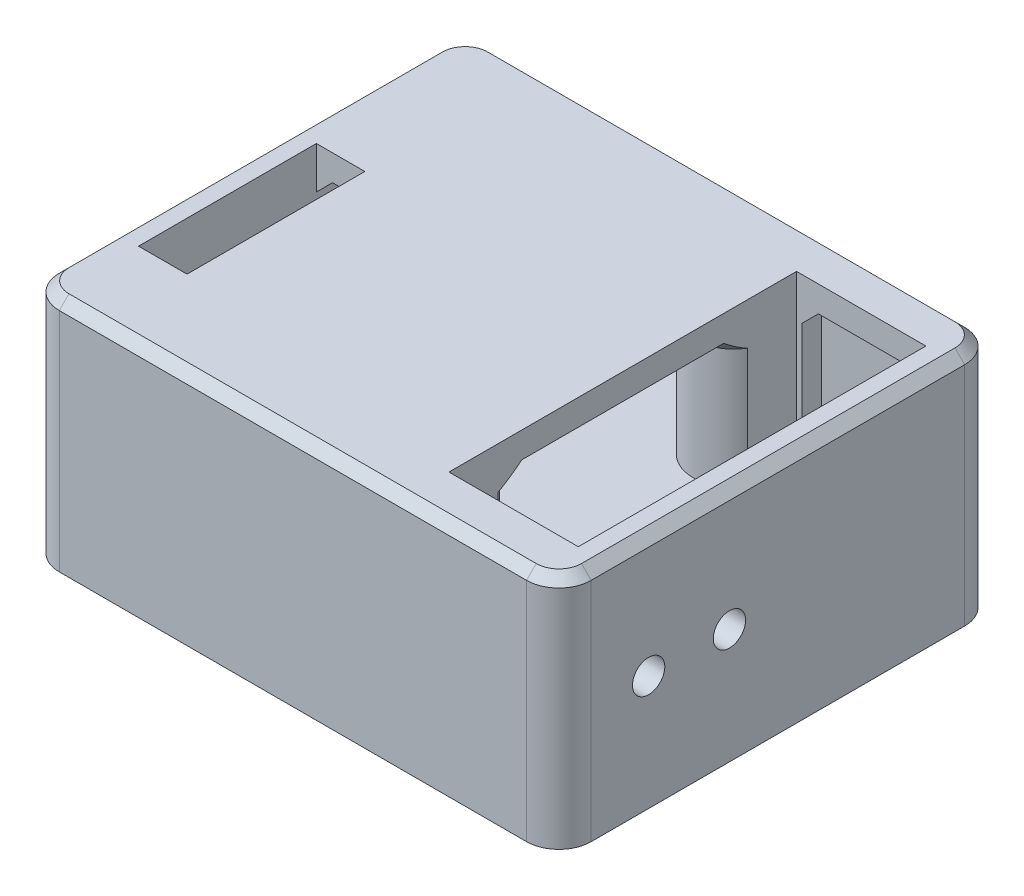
ISO-10303-21;
HEADER;
FILE_DESCRIPTION(('STEP AP214'),'2;1');
FILE_NAME('part.step','',(''),(''),'','','');
FILE_SCHEMA(('AUTOMOTIVE_DESIGN { 1 0 10303 214 1 1 1 1 }'));
ENDSEC;
DATA;
#1=APPLICATION_CONTEXT('core data for automotive mechanical design processes');
#2=APPLICATION_PROTOCOL_DEFINITION('international standard','automotive_design',2000,#1);
#3=PRODUCT_CONTEXT('',#1,'mechanical');
#4=PRODUCT('Part','Part','',(#3));
#5=PRODUCT_RELATED_PRODUCT_CATEGORY('part','',(#4));
#6=PRODUCT_DEFINITION_FORMATION('','',#4);
#7=PRODUCT_DEFINITION_CONTEXT('part definition',#1,'design');
#8=PRODUCT_DEFINITION('design','',#6,#7);
#9=PRODUCT_DEFINITION_SHAPE('','',#8);
#10=(LENGTH_UNIT() NAMED_UNIT(*) SI_UNIT(.MILLI.,.METRE.));
#11=(NAMED_UNIT(*) PLANE_ANGLE_UNIT() SI_UNIT($,.RADIAN.));
#12=(NAMED_UNIT(*) SI_UNIT($,.STERADIAN.) SOLID_ANGLE_UNIT());
#13=UNCERTAINTY_MEASURE_WITH_UNIT(LENGTH_MEASURE(1.E-05),#10,'distance_accuracy_value','');
#14=(GEOMETRIC_REPRESENTATION_CONTEXT(3) GLOBAL_UNCERTAINTY_ASSIGNED_CONTEXT((#13)) GLOBAL_UNIT_ASSIGNED_CONTEXT((#10,
#11,#12)) REPRESENTATION_CONTEXT('',''));
#15=CARTESIAN_POINT('',(0.,0.,0.));
#16=DIRECTION('',(0.,0.,1.));
#17=DIRECTION('',(1.,0.,0.));
#18=AXIS2_PLACEMENT_3D('',#15,#16,#17);
#19=CARTESIAN_POINT('',(0.,-3.,0.));
#20=DIRECTION('',(0.,-1.,0.));
#21=DIRECTION('',(0.,0.,-1.));
#22=AXIS2_PLACEMENT_3D('',#19,#20,#21);
#23=PLANE('',#22);
#24=DIRECTION('',(0.,0.,1.));
#25=VECTOR('',#24,1.);
#26=CARTESIAN_POINT('',(-11.6,-3.,11.7));
#27=LINE('',#26,#25);
#28=CARTESIAN_POINT('',(-11.6,-3.,-11.7));
#29=VERTEX_POINT('',#28);
#30=CARTESIAN_POINT('',(-11.6,-3.,11.7));
#31=VERTEX_POINT('',#30);
#32=EDGE_CURVE('E112',#29,#31,#27,.T.);
#33=ORIENTED_EDGE('',*,*,#32,.F.);
#34=DIRECTION('',(1.,0.,0.));
#35=VECTOR('',#34,1.);
#36=CARTESIAN_POINT('',(-14.6,-3.,-11.7));
#37=LINE('',#36,#35);
#38=CARTESIAN_POINT('',(-14.6,-3.,-11.7));
#39=VERTEX_POINT('',#38);
#40=EDGE_CURVE('E315',#39,#29,#37,.T.);
#41=ORIENTED_EDGE('',*,*,#40,.F.);
#42=DIRECTION('',(0.,0.,-1.));
#43=VECTOR('',#42,1.);
#44=CARTESIAN_POINT('',(-14.6,-3.,11.7));
#45=LINE('',#44,#43);
#46=CARTESIAN_POINT('',(-14.6,-3.,11.7));
#47=VERTEX_POINT('',#46);
#48=EDGE_CURVE('E206',#47,#39,#45,.T.);
#49=ORIENTED_EDGE('',*,*,#48,.F.);
#50=DIRECTION('',(-1.,0.,0.));
#51=VECTOR('',#50,1.);
#52=CARTESIAN_POINT('',(14.6,-3.,11.7));
#53=LINE('',#52,#51);
#54=EDGE_CURVE('E117',#31,#47,#53,.T.);
#55=ORIENTED_EDGE('',*,*,#54,.F.);
#56=EDGE_LOOP('',(#33,#41,#49,#55));
#57=FACE_BOUND('',#56,.T.);
#58=ADVANCED_FACE('F95',(#57),#23,.F.);
#59=DIRECTION('',(0.,0.,-1.));
#60=VECTOR('',#59,1.);
#61=CARTESIAN_POINT('',(8.6,-3.,11.7));
#62=LINE('',#61,#60);
#63=CARTESIAN_POINT('',(8.6,-3.,11.7));
#64=VERTEX_POINT('',#63);
#65=CARTESIAN_POINT('',(8.6,-3.,-11.7));
#66=VERTEX_POINT('',#65);
#67=EDGE_CURVE('E182',#64,#66,#62,.T.);
#68=ORIENTED_EDGE('',*,*,#67,.F.);
#69=CARTESIAN_POINT('',(14.6,-3.,11.7));
#70=VERTEX_POINT('',#69);
#71=EDGE_CURVE('E299',#70,#64,#53,.T.);
#72=ORIENTED_EDGE('',*,*,#71,.F.);
#73=DIRECTION('',(0.,0.,1.));
#74=VECTOR('',#73,1.);
#75=CARTESIAN_POINT('',(14.6,-3.,-11.7));
#76=LINE('',#75,#74);
#77=CARTESIAN_POINT('',(14.6,-3.,-11.7));
#78=VERTEX_POINT('',#77);
#79=EDGE_CURVE('E308',#78,#70,#76,.T.);
#80=ORIENTED_EDGE('',*,*,#79,.F.);
#81=EDGE_CURVE('E212',#66,#78,#37,.T.);
#82=ORIENTED_EDGE('',*,*,#81,.F.);
#83=EDGE_LOOP('',(#68,#72,#80,#82));
#84=FACE_BOUND('',#83,.T.);
#85=ADVANCED_FACE('F263',(#84),#23,.F.);
#86=CARTESIAN_POINT('',(-14.6,-3.,11.7));
#87=DIRECTION('',(-1.,0.,0.));
#88=DIRECTION('',(0.,0.,1.));
#89=AXIS2_PLACEMENT_3D('',#86,#87,#88);
#90=PLANE('',#89);
#91=DIRECTION('',(0.,0.,-1.));
#92=VECTOR('',#91,1.);
#93=CARTESIAN_POINT('',(-14.6,-4.6,11.7));
#94=LINE('',#93,#92);
#95=CARTESIAN_POINT('',(-14.6,-4.6,11.7));
#96=VERTEX_POINT('',#95);
#97=CARTESIAN_POINT('',(-14.6,-4.6,-11.7));
#98=VERTEX_POINT('',#97);
#99=EDGE_CURVE('E185',#96,#98,#94,.T.);
#100=ORIENTED_EDGE('',*,*,#99,.F.);
#101=DIRECTION('',(0.,-1.,0.));
#102=VECTOR('',#101,1.);
#103=CARTESIAN_POINT('',(-14.6,-3.,11.7));
#104=LINE('',#103,#102);
#105=EDGE_CURVE('E13',#47,#96,#104,.T.);
#106=ORIENTED_EDGE('',*,*,#105,.F.);
#107=ORIENTED_EDGE('',*,*,#48,.T.);
#108=DIRECTION('',(0.,-1.,0.));
#109=VECTOR('',#108,1.);
#110=CARTESIAN_POINT('',(-14.6,-3.,-11.7));
#111=LINE('',#110,#109);
#112=EDGE_CURVE('E285',#39,#98,#111,.T.);
#113=ORIENTED_EDGE('',*,*,#112,.T.);
#114=EDGE_LOOP('',(#100,#106,#107,#113));
#115=FACE_BOUND('',#114,.T.);
#116=ADVANCED_FACE('F97',(#115),#90,.T.);
#117=CARTESIAN_POINT('',(14.6,-3.,11.7));
#118=DIRECTION('',(0.,0.,1.));
#119=DIRECTION('',(1.,0.,0.));
#120=AXIS2_PLACEMENT_3D('',#117,#118,#119);
#121=PLANE('',#120);
#122=DIRECTION('',(-1.,0.,0.));
#123=VECTOR('',#122,1.);
#124=CARTESIAN_POINT('',(14.6,-4.6,11.7));
#125=LINE('',#124,#123);
#126=CARTESIAN_POINT('',(14.6,-4.6,11.7));
#127=VERTEX_POINT('',#126);
#128=EDGE_CURVE('E295',#127,#96,#125,.T.);
#129=ORIENTED_EDGE('',*,*,#128,.F.);
#130=DIRECTION('',(0.,-1.,0.));
#131=VECTOR('',#130,1.);
#132=CARTESIAN_POINT('',(14.6,-3.,11.7));
#133=LINE('',#132,#131);
#134=EDGE_CURVE('E104',#70,#127,#133,.T.);
#135=ORIENTED_EDGE('',*,*,#134,.F.);
#136=ORIENTED_EDGE('',*,*,#71,.T.);
#137=DIRECTION('',(0.,-1.,0.));
#138=VECTOR('',#137,1.);
#139=CARTESIAN_POINT('',(8.6,-1.4,11.7));
#140=LINE('',#139,#138);
#141=CARTESIAN_POINT('',(8.6,-1.4,11.7));
#142=VERTEX_POINT('',#141);
#143=EDGE_CURVE('E168',#142,#64,#140,.T.);
#144=ORIENTED_EDGE('',*,*,#143,.F.);
#145=DIRECTION('',(1.,0.,0.));
#146=VECTOR('',#145,1.);
#147=CARTESIAN_POINT('',(-11.6,-1.4,11.7));
#148=LINE('',#147,#146);
#149=CARTESIAN_POINT('',(-11.6,-1.4,11.7));
#150=VERTEX_POINT('',#149);
#151=EDGE_CURVE('E160',#150,#142,#148,.T.);
#152=ORIENTED_EDGE('',*,*,#151,.F.);
#153=DIRECTION('',(0.,-1.,0.));
#154=VECTOR('',#153,1.);
#155=CARTESIAN_POINT('',(-11.6,-1.4,11.7));
#156=LINE('',#155,#154);
#157=EDGE_CURVE('E165',#150,#31,#156,.T.);
#158=ORIENTED_EDGE('',*,*,#157,.T.);
#159=ORIENTED_EDGE('',*,*,#54,.T.);
#160=ORIENTED_EDGE('',*,*,#105,.T.);
#161=EDGE_LOOP('',(#129,#135,#136,#144,#152,#158,#159,#160));
#162=FACE_BOUND('',#161,.T.);
#163=ADVANCED_FACE('F163',(#162),#121,.T.);
#164=CARTESIAN_POINT('',(14.6,-3.,-11.7));
#165=DIRECTION('',(1.,0.,0.));
#166=DIRECTION('',(0.,0.,-1.));
#167=AXIS2_PLACEMENT_3D('',#164,#165,#166);
#168=PLANE('',#167);
#169=DIRECTION('',(0.,0.,1.));
#170=VECTOR('',#169,1.);
#171=CARTESIAN_POINT('',(14.6,-4.6,-11.7));
#172=LINE('',#171,#170);
#173=CARTESIAN_POINT('',(14.6,-4.6,-11.7));
#174=VERTEX_POINT('',#173);
#175=EDGE_CURVE('E291',#174,#127,#172,.T.);
#176=ORIENTED_EDGE('',*,*,#175,.F.);
#177=DIRECTION('',(0.,-1.,0.));
#178=VECTOR('',#177,1.);
#179=CARTESIAN_POINT('',(14.6,-3.,-11.7));
#180=LINE('',#179,#178);
#181=EDGE_CURVE('E287',#78,#174,#180,.T.);
#182=ORIENTED_EDGE('',*,*,#181,.F.);
#183=ORIENTED_EDGE('',*,*,#79,.T.);
#184=ORIENTED_EDGE('',*,*,#134,.T.);
#185=EDGE_LOOP('',(#176,#182,#183,#184));
#186=FACE_BOUND('',#185,.T.);
#187=ADVANCED_FACE('F277',(#186),#168,.T.);
#188=CARTESIAN_POINT('',(-14.6,-3.,-11.7));
#189=DIRECTION('',(0.,0.,-1.));
#190=DIRECTION('',(-1.,0.,0.));
#191=AXIS2_PLACEMENT_3D('',#188,#189,#190);
#192=PLANE('',#191);
#193=DIRECTION('',(1.,0.,0.));
#194=VECTOR('',#193,1.);
#195=CARTESIAN_POINT('',(-14.6,-4.6,-11.7));
#196=LINE('',#195,#194);
#197=EDGE_CURVE('E188',#98,#174,#196,.T.);
#198=ORIENTED_EDGE('',*,*,#197,.F.);
#199=ORIENTED_EDGE('',*,*,#112,.F.);
#200=ORIENTED_EDGE('',*,*,#40,.T.);
#201=DIRECTION('',(0.,-1.,0.));
#202=VECTOR('',#201,1.);
#203=CARTESIAN_POINT('',(-11.6,-1.4,-11.7));
#204=LINE('',#203,#202);
#205=CARTESIAN_POINT('',(-11.6,-1.4,-11.7));
#206=VERTEX_POINT('',#205);
#207=EDGE_CURVE('E199',#206,#29,#204,.T.);
#208=ORIENTED_EDGE('',*,*,#207,.F.);
#209=DIRECTION('',(-1.,0.,0.));
#210=VECTOR('',#209,1.);
#211=CARTESIAN_POINT('',(-11.6,-1.4,-11.7));
#212=LINE('',#211,#210);
#213=CARTESIAN_POINT('',(8.6,-1.4,-11.7));
#214=VERTEX_POINT('',#213);
#215=EDGE_CURVE('E178',#214,#206,#212,.T.);
#216=ORIENTED_EDGE('',*,*,#215,.F.);
#217=DIRECTION('',(0.,-1.,0.));
#218=VECTOR('',#217,1.);
#219=CARTESIAN_POINT('',(8.6,-1.4,-11.7));
#220=LINE('',#219,#218);
#221=EDGE_CURVE('E190',#214,#66,#220,.T.);
#222=ORIENTED_EDGE('',*,*,#221,.T.);
#223=ORIENTED_EDGE('',*,*,#81,.T.);
#224=ORIENTED_EDGE('',*,*,#181,.T.);
#225=EDGE_LOOP('',(#198,#199,#200,#208,#216,#222,#223,#224));
#226=FACE_BOUND('',#225,.T.);
#227=ADVANCED_FACE('F274',(#226),#192,.T.);
#228=CARTESIAN_POINT('',(0.,-4.6,0.));
#229=DIRECTION('',(0.,-1.,0.));
#230=DIRECTION('',(0.,0.,-1.));
#231=AXIS2_PLACEMENT_3D('',#228,#229,#230);
#232=PLANE('',#231);
#233=CARTESIAN_POINT('',(4.7,-4.6,9.));
#234=DIRECTION('',(0.,1.,0.));
#235=DIRECTION('',(0.,0.,1.));
#236=AXIS2_PLACEMENT_3D('',#233,#234,#235);
#237=CIRCLE('',#236,1.6);
#238=CARTESIAN_POINT('',(4.7,-4.6,10.6));
#239=VERTEX_POINT('',#238);
#240=EDGE_CURVE('E240',#239,#239,#237,.T.);
#241=ORIENTED_EDGE('',*,*,#240,.T.);
#242=EDGE_LOOP('',(#241));
#243=FACE_BOUND('',#242,.T.);
#244=CARTESIAN_POINT('',(-8.6,-4.6,9.));
#245=DIRECTION('',(0.,1.,0.));
#246=DIRECTION('',(0.,0.,1.));
#247=AXIS2_PLACEMENT_3D('',#244,#245,#246);
#248=CIRCLE('',#247,1.6);
#249=CARTESIAN_POINT('',(-8.6,-4.6,10.6));
#250=VERTEX_POINT('',#249);
#251=EDGE_CURVE('E237',#250,#250,#248,.T.);
#252=ORIENTED_EDGE('',*,*,#251,.T.);
#253=EDGE_LOOP('',(#252));
#254=FACE_BOUND('',#253,.T.);
#255=CARTESIAN_POINT('',(-8.6,-4.6,-9.));
#256=DIRECTION('',(0.,1.,0.));
#257=DIRECTION('',(0.,0.,1.));
#258=AXIS2_PLACEMENT_3D('',#255,#256,#257);
#259=CIRCLE('',#258,1.6);
#260=CARTESIAN_POINT('',(-8.6,-4.6,-7.4));
#261=VERTEX_POINT('',#260);
#262=EDGE_CURVE('E234',#261,#261,#259,.T.);
#263=ORIENTED_EDGE('',*,*,#262,.T.);
#264=EDGE_LOOP('',(#263));
#265=FACE_BOUND('',#264,.T.);
#266=CARTESIAN_POINT('',(4.7,-4.6,-9.));
#267=DIRECTION('',(0.,1.,0.));
#268=DIRECTION('',(0.,0.,1.));
#269=AXIS2_PLACEMENT_3D('',#266,#267,#268);
#270=CIRCLE('',#269,1.6);
#271=CARTESIAN_POINT('',(4.7,-4.6,-7.4));
#272=VERTEX_POINT('',#271);
#273=EDGE_CURVE('E231',#272,#272,#270,.T.);
#274=ORIENTED_EDGE('',*,*,#273,.T.);
#275=EDGE_LOOP('',(#274));
#276=FACE_BOUND('',#275,.T.);
#277=ORIENTED_EDGE('',*,*,#99,.T.);
#278=ORIENTED_EDGE('',*,*,#197,.T.);
#279=ORIENTED_EDGE('',*,*,#175,.T.);
#280=ORIENTED_EDGE('',*,*,#128,.T.);
#281=EDGE_LOOP('',(#277,#278,#279,#280));
#282=FACE_BOUND('',#281,.T.);
#283=ADVANCED_FACE('F244',(#243,#254,#265,#276,#282),#232,.T.);
#284=CARTESIAN_POINT('',(0.,-1.4,0.));
#285=DIRECTION('',(0.,-1.,0.));
#286=DIRECTION('',(0.,0.,-1.));
#287=AXIS2_PLACEMENT_3D('',#284,#285,#286);
#288=PLANE('',#287);
#289=CARTESIAN_POINT('',(4.7,-1.4,9.));
#290=DIRECTION('',(0.,1.,0.));
#291=DIRECTION('',(0.,0.,1.));
#292=AXIS2_PLACEMENT_3D('',#289,#290,#291);
#293=CIRCLE('',#292,1.6);
#294=CARTESIAN_POINT('',(4.7,-1.4,10.6));
#295=VERTEX_POINT('',#294);
#296=EDGE_CURVE('E225',#295,#295,#293,.T.);
#297=ORIENTED_EDGE('',*,*,#296,.F.);
#298=EDGE_LOOP('',(#297));
#299=FACE_BOUND('',#298,.T.);
#300=CARTESIAN_POINT('',(-8.6,-1.4,-9.));
#301=DIRECTION('',(0.,1.,0.));
#302=DIRECTION('',(0.,0.,1.));
#303=AXIS2_PLACEMENT_3D('',#300,#301,#302);
#304=CIRCLE('',#303,1.6);
#305=CARTESIAN_POINT('',(-8.6,-1.4,-7.4));
#306=VERTEX_POINT('',#305);
#307=EDGE_CURVE('E198',#306,#306,#304,.T.);
#308=ORIENTED_EDGE('',*,*,#307,.F.);
#309=EDGE_LOOP('',(#308));
#310=FACE_BOUND('',#309,.T.);
#311=DIRECTION('',(0.,0.,1.));
#312=VECTOR('',#311,1.);
#313=CARTESIAN_POINT('',(-11.6,-1.4,11.7));
#314=LINE('',#313,#312);
#315=EDGE_CURVE('E172',#206,#150,#314,.T.);
#316=ORIENTED_EDGE('',*,*,#315,.T.);
#317=ORIENTED_EDGE('',*,*,#151,.T.);
#318=DIRECTION('',(0.,0.,-1.));
#319=VECTOR('',#318,1.);
#320=CARTESIAN_POINT('',(8.6,-1.4,11.7));
#321=LINE('',#320,#319);
#322=EDGE_CURVE('E171',#142,#214,#321,.T.);
#323=ORIENTED_EDGE('',*,*,#322,.T.);
#324=ORIENTED_EDGE('',*,*,#215,.T.);
#325=EDGE_LOOP('',(#316,#317,#323,#324));
#326=FACE_BOUND('',#325,.T.);
#327=CARTESIAN_POINT('',(4.7,-1.4,-9.));
#328=DIRECTION('',(0.,1.,0.));
#329=DIRECTION('',(0.,0.,1.));
#330=AXIS2_PLACEMENT_3D('',#327,#328,#329);
#331=CIRCLE('',#330,1.6);
#332=CARTESIAN_POINT('',(4.7,-1.4,-7.4));
#333=VERTEX_POINT('',#332);
#334=EDGE_CURVE('E222',#333,#333,#331,.T.);
#335=ORIENTED_EDGE('',*,*,#334,.F.);
#336=EDGE_LOOP('',(#335));
#337=FACE_BOUND('',#336,.T.);
#338=CARTESIAN_POINT('',(-8.6,-1.4,9.));
#339=DIRECTION('',(0.,1.,0.));
#340=DIRECTION('',(0.,0.,1.));
#341=AXIS2_PLACEMENT_3D('',#338,#339,#340);
#342=CIRCLE('',#341,1.6);
#343=CARTESIAN_POINT('',(-8.6,-1.4,10.6));
#344=VERTEX_POINT('',#343);
#345=EDGE_CURVE('E228',#344,#344,#342,.T.);
#346=ORIENTED_EDGE('',*,*,#345,.F.);
#347=EDGE_LOOP('',(#346));
#348=FACE_BOUND('',#347,.T.);
#349=ADVANCED_FACE('F175',(#299,#310,#326,#337,#348),#288,.F.);
#350=CARTESIAN_POINT('',(-11.6,-1.4,11.7));
#351=DIRECTION('',(1.,0.,0.));
#352=DIRECTION('',(0.,0.,-1.));
#353=AXIS2_PLACEMENT_3D('',#350,#351,#352);
#354=PLANE('',#353);
#355=ORIENTED_EDGE('',*,*,#32,.T.);
#356=ORIENTED_EDGE('',*,*,#157,.F.);
#357=ORIENTED_EDGE('',*,*,#315,.F.);
#358=ORIENTED_EDGE('',*,*,#207,.T.);
#359=EDGE_LOOP('',(#355,#356,#357,#358));
#360=FACE_BOUND('',#359,.T.);
#361=ADVANCED_FACE('F184',(#360),#354,.F.);
#362=CARTESIAN_POINT('',(8.6,-1.4,11.7));
#363=DIRECTION('',(-1.,0.,0.));
#364=DIRECTION('',(0.,0.,1.));
#365=AXIS2_PLACEMENT_3D('',#362,#363,#364);
#366=PLANE('',#365);
#367=ORIENTED_EDGE('',*,*,#67,.T.);
#368=ORIENTED_EDGE('',*,*,#221,.F.);
#369=ORIENTED_EDGE('',*,*,#322,.F.);
#370=ORIENTED_EDGE('',*,*,#143,.T.);
#371=EDGE_LOOP('',(#367,#368,#369,#370));
#372=FACE_BOUND('',#371,.T.);
#373=ADVANCED_FACE('F319',(#372),#366,.F.);
#374=CARTESIAN_POINT('',(-8.6,-1.4,-9.));
#375=DIRECTION('',(0.,-1.,0.));
#376=DIRECTION('',(0.,0.,-1.));
#377=AXIS2_PLACEMENT_3D('',#374,#375,#376);
#378=CYLINDRICAL_SURFACE('',#377,1.6);
#379=ORIENTED_EDGE('',*,*,#307,.T.);
#380=EDGE_LOOP('',(#379));
#381=FACE_BOUND('',#380,.T.);
#382=ORIENTED_EDGE('',*,*,#262,.F.);
#383=EDGE_LOOP('',(#382));
#384=FACE_BOUND('',#383,.T.);
#385=ADVANCED_FACE('F259',(#381,#384),#378,.F.);
#386=CARTESIAN_POINT('',(4.7,-1.4,-9.));
#387=DIRECTION('',(0.,-1.,0.));
#388=DIRECTION('',(0.,0.,-1.));
#389=AXIS2_PLACEMENT_3D('',#386,#387,#388);
#390=CYLINDRICAL_SURFACE('',#389,1.6);
#391=ORIENTED_EDGE('',*,*,#334,.T.);
#392=EDGE_LOOP('',(#391));
#393=FACE_BOUND('',#392,.T.);
#394=ORIENTED_EDGE('',*,*,#273,.F.);
#395=EDGE_LOOP('',(#394));
#396=FACE_BOUND('',#395,.T.);
#397=ADVANCED_FACE('F250',(#393,#396),#390,.F.);
#398=CARTESIAN_POINT('',(4.7,-1.4,9.));
#399=DIRECTION('',(0.,-1.,0.));
#400=DIRECTION('',(0.,0.,-1.));
#401=AXIS2_PLACEMENT_3D('',#398,#399,#400);
#402=CYLINDRICAL_SURFACE('',#401,1.6);
#403=ORIENTED_EDGE('',*,*,#296,.T.);
#404=EDGE_LOOP('',(#403));
#405=FACE_BOUND('',#404,.T.);
#406=ORIENTED_EDGE('',*,*,#240,.F.);
#407=EDGE_LOOP('',(#406));
#408=FACE_BOUND('',#407,.T.);
#409=ADVANCED_FACE('F247',(#405,#408),#402,.F.);
#410=CARTESIAN_POINT('',(-8.6,-1.4,9.));
#411=DIRECTION('',(0.,-1.,0.));
#412=DIRECTION('',(0.,0.,-1.));
#413=AXIS2_PLACEMENT_3D('',#410,#411,#412);
#414=CYLINDRICAL_SURFACE('',#413,1.6);
#415=ORIENTED_EDGE('',*,*,#345,.T.);
#416=EDGE_LOOP('',(#415));
#417=FACE_BOUND('',#416,.T.);
#418=ORIENTED_EDGE('',*,*,#251,.F.);
#419=EDGE_LOOP('',(#418));
#420=FACE_BOUND('',#419,.T.);
#421=ADVANCED_FACE('F249',(#417,#420),#414,.F.);
#422=CLOSED_SHELL('',(#58,#85,#116,#163,#187,#227,#283,#349,#361,#373,#385,#397,#409,#421));
#423=MANIFOLD_SOLID_BREP('B2',#422);
#424=CARTESIAN_POINT('',(0.,8.4,0.));
#425=DIRECTION('',(0.,1.,0.));
#426=DIRECTION('',(0.,0.,1.));
#427=AXIS2_PLACEMENT_3D('',#424,#425,#426);
#428=PLANE('',#427);
#429=DIRECTION('',(0.,0.,-1.));
#430=VECTOR('',#429,1.);
#431=CARTESIAN_POINT('',(-13.85,8.4,0.));
#432=LINE('',#431,#430);
#433=CARTESIAN_POINT('',(-13.85,8.4,10.95));
#434=VERTEX_POINT('',#433);
#435=CARTESIAN_POINT('',(-13.85,8.4,8.25));
#436=VERTEX_POINT('',#435);
#437=EDGE_CURVE('E831',#434,#436,#432,.T.);
#438=ORIENTED_EDGE('',*,*,#437,.T.);
#439=DIRECTION('',(-1.,0.,0.));
#440=VECTOR('',#439,1.);
#441=CARTESIAN_POINT('',(-14.85,8.4,8.25));
#442=LINE('',#441,#440);
#443=CARTESIAN_POINT('',(-12.0186985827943,8.4,8.25));
#444=VERTEX_POINT('',#443);
#445=EDGE_CURVE('E1023',#444,#436,#442,.T.);
#446=ORIENTED_EDGE('',*,*,#445,.F.);
#447=CARTESIAN_POINT('',(-8.6,8.4,9.));
#448=DIRECTION('',(0.,1.,0.));
#449=DIRECTION('',(0.,0.,1.));
#450=AXIS2_PLACEMENT_3D('',#447,#448,#449);
#451=CIRCLE('',#450,3.5);
#452=CARTESIAN_POINT('',(-12.1,8.4,9.));
#453=VERTEX_POINT('',#452);
#454=EDGE_CURVE('E1308',#444,#453,#451,.T.);
#455=ORIENTED_EDGE('',*,*,#454,.T.);
#456=DIRECTION('',(0.,0.,1.));
#457=VECTOR('',#456,1.);
#458=CARTESIAN_POINT('',(-12.1,8.4,11.95));
#459=LINE('',#458,#457);
#460=CARTESIAN_POINT('',(-12.1,8.4,10.95));
#461=VERTEX_POINT('',#460);
#462=EDGE_CURVE('E836',#453,#461,#459,.T.);
#463=ORIENTED_EDGE('',*,*,#462,.T.);
#464=DIRECTION('',(-1.,0.,0.));
#465=VECTOR('',#464,1.);
#466=CARTESIAN_POINT('',(0.,8.4,10.95));
#467=LINE('',#466,#465);
#468=EDGE_CURVE('E832',#461,#434,#467,.T.);
#469=ORIENTED_EDGE('',*,*,#468,.T.);
#470=EDGE_LOOP('',(#438,#446,#455,#463,#469));
#471=FACE_BOUND('',#470,.T.);
#472=ADVANCED_FACE('F451',(#471),#428,.F.);
#473=CARTESIAN_POINT('',(-14.85,7.39999999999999,-11.95));
#474=DIRECTION('',(-0.70710678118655,0.707106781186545,0.));
#475=DIRECTION('',(0.,0.,1.));
#476=AXIS2_PLACEMENT_3D('',#473,#474,#475);
#477=PLANE('',#476);
#478=DIRECTION('',(0.,0.,1.));
#479=VECTOR('',#478,1.);
#480=CARTESIAN_POINT('',(-14.85,7.39999999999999,-11.95));
#481=LINE('',#480,#479);
#482=CARTESIAN_POINT('',(-14.85,7.39999999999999,8.25));
#483=VERTEX_POINT('',#482);
#484=CARTESIAN_POINT('',(-14.85,7.39999999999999,11.95));
#485=VERTEX_POINT('',#484);
#486=EDGE_CURVE('E841',#483,#485,#481,.T.);
#487=ORIENTED_EDGE('',*,*,#486,.F.);
#488=DIRECTION('',(-0.707106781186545,-0.70710678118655,0.));
#489=VECTOR('',#488,1.);
#490=CARTESIAN_POINT('',(-20.8505,1.39949999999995,8.25));
#491=LINE('',#490,#489);
#492=EDGE_CURVE('E1014',#436,#483,#491,.T.);
#493=ORIENTED_EDGE('',*,*,#492,.F.);
#494=ORIENTED_EDGE('',*,*,#437,.F.);
#495=DIRECTION('',(0.577350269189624,0.577350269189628,-0.577350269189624));
#496=VECTOR('',#495,1.);
#497=CARTESIAN_POINT('',(-6.88333333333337,15.3666666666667,3.98333333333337));
#498=LINE('',#497,#496);
#499=EDGE_CURVE('E885',#434,#485,#498,.F.);
#500=ORIENTED_EDGE('',*,*,#499,.T.);
#501=EDGE_LOOP('',(#487,#493,#494,#500));
#502=FACE_BOUND('',#501,.T.);
#503=ADVANCED_FACE('F1326',(#502),#477,.F.);
#504=DIRECTION('',(0.,0.,-1.));
#505=VECTOR('',#504,1.);
#506=CARTESIAN_POINT('',(8.2,8.4,9.));
#507=LINE('',#506,#505);
#508=CARTESIAN_POINT('',(8.2,8.4,10.95));
#509=VERTEX_POINT('',#508);
#510=CARTESIAN_POINT('',(8.2,8.4,10.75));
#511=VERTEX_POINT('',#510);
#512=EDGE_CURVE('E1297',#509,#511,#507,.T.);
#513=ORIENTED_EDGE('',*,*,#512,.T.);
#514=DIRECTION('',(-1.,0.,0.));
#515=VECTOR('',#514,1.);
#516=CARTESIAN_POINT('',(6.85,8.4,10.75));
#517=LINE('',#516,#515);
#518=CARTESIAN_POINT('',(13.85,8.4,10.75));
#519=VERTEX_POINT('',#518);
#520=EDGE_CURVE('E1064',#519,#511,#517,.T.);
#521=ORIENTED_EDGE('',*,*,#520,.F.);
#522=DIRECTION('',(0.,0.,1.));
#523=VECTOR('',#522,1.);
#524=CARTESIAN_POINT('',(13.85,8.4,0.));
#525=LINE('',#524,#523);
#526=CARTESIAN_POINT('',(13.85,8.4,10.95));
#527=VERTEX_POINT('',#526);
#528=EDGE_CURVE('E1291',#519,#527,#525,.T.);
#529=ORIENTED_EDGE('',*,*,#528,.T.);
#530=DIRECTION('',(-1.,0.,0.));
#531=VECTOR('',#530,1.);
#532=CARTESIAN_POINT('',(0.,8.4,10.95));
#533=LINE('',#532,#531);
#534=EDGE_CURVE('E1295',#527,#509,#533,.T.);
#535=ORIENTED_EDGE('',*,*,#534,.T.);
#536=EDGE_LOOP('',(#513,#521,#529,#535));
#537=FACE_BOUND('',#536,.T.);
#538=ADVANCED_FACE('F1538',(#537),#428,.F.);
#539=CARTESIAN_POINT('',(13.85,8.4,-10.95));
#540=VERTEX_POINT('',#539);
#541=CARTESIAN_POINT('',(13.85,8.4,-10.75));
#542=VERTEX_POINT('',#541);
#543=EDGE_CURVE('E1292',#540,#542,#525,.T.);
#544=ORIENTED_EDGE('',*,*,#543,.T.);
#545=DIRECTION('',(1.,0.,0.));
#546=VECTOR('',#545,1.);
#547=CARTESIAN_POINT('',(6.85,8.4,-10.75));
#548=LINE('',#547,#546);
#549=CARTESIAN_POINT('',(8.2,8.4,-10.75));
#550=VERTEX_POINT('',#549);
#551=EDGE_CURVE('E1095',#550,#542,#548,.T.);
#552=ORIENTED_EDGE('',*,*,#551,.F.);
#553=DIRECTION('',(0.,0.,-1.));
#554=VECTOR('',#553,1.);
#555=CARTESIAN_POINT('',(8.2,8.4,-11.95));
#556=LINE('',#555,#554);
#557=CARTESIAN_POINT('',(8.2,8.4,-10.95));
#558=VERTEX_POINT('',#557);
#559=EDGE_CURVE('E1287',#550,#558,#556,.T.);
#560=ORIENTED_EDGE('',*,*,#559,.T.);
#561=DIRECTION('',(1.,0.,0.));
#562=VECTOR('',#561,1.);
#563=CARTESIAN_POINT('',(0.,8.4,-10.95));
#564=LINE('',#563,#562);
#565=EDGE_CURVE('E1289',#558,#540,#564,.T.);
#566=ORIENTED_EDGE('',*,*,#565,.T.);
#567=EDGE_LOOP('',(#544,#552,#560,#566));
#568=FACE_BOUND('',#567,.T.);
#569=ADVANCED_FACE('F1525',(#568),#428,.F.);
#570=CARTESIAN_POINT('',(14.85,7.39999999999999,11.95));
#571=DIRECTION('',(0.70710678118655,0.707106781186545,0.));
#572=DIRECTION('',(0.,0.,-1.));
#573=AXIS2_PLACEMENT_3D('',#570,#571,#572);
#574=PLANE('',#573);
#575=ORIENTED_EDGE('',*,*,#528,.F.);
#576=DIRECTION('',(-0.707106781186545,0.70710678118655,0.));
#577=VECTOR('',#576,1.);
#578=CARTESIAN_POINT('',(16.8505,5.39949999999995,10.75));
#579=LINE('',#578,#577);
#580=CARTESIAN_POINT('',(14.85,7.39999999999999,10.75));
#581=VERTEX_POINT('',#580);
#582=EDGE_CURVE('E1057',#581,#519,#579,.T.);
#583=ORIENTED_EDGE('',*,*,#582,.F.);
#584=DIRECTION('',(0.,0.,-1.));
#585=VECTOR('',#584,1.);
#586=CARTESIAN_POINT('',(14.85,7.39999999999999,11.95));
#587=LINE('',#586,#585);
#588=CARTESIAN_POINT('',(14.85,7.39999999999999,11.95));
#589=VERTEX_POINT('',#588);
#590=EDGE_CURVE('E864',#589,#581,#587,.T.);
#591=ORIENTED_EDGE('',*,*,#590,.F.);
#592=DIRECTION('',(-0.577350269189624,0.577350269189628,-0.577350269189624));
#593=VECTOR('',#592,1.);
#594=CARTESIAN_POINT('',(4.95000000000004,17.3,2.05000000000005));
#595=LINE('',#594,#593);
#596=EDGE_CURVE('E930',#589,#527,#595,.T.);
#597=ORIENTED_EDGE('',*,*,#596,.T.);
#598=EDGE_LOOP('',(#575,#583,#591,#597));
#599=FACE_BOUND('',#598,.T.);
#600=ADVANCED_FACE('F1598',(#599),#574,.F.);
#601=CARTESIAN_POINT('',(-5.1,8.4,9.));
#602=VERTEX_POINT('',#601);
#603=CARTESIAN_POINT('',(-11.85,8.4,7.70096189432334));
#604=VERTEX_POINT('',#603);
#605=EDGE_CURVE('E1309',#602,#604,#451,.T.);
#606=ORIENTED_EDGE('',*,*,#605,.T.);
#607=DIRECTION('',(0.,0.,1.));
#608=VECTOR('',#607,1.);
#609=CARTESIAN_POINT('',(-11.85,8.4,8.25));
#610=LINE('',#609,#608);
#611=CARTESIAN_POINT('',(-11.85,8.4,-2.75));
#612=VERTEX_POINT('',#611);
#613=EDGE_CURVE('E825',#612,#604,#610,.T.);
#614=ORIENTED_EDGE('',*,*,#613,.F.);
#615=DIRECTION('',(1.,0.,0.));
#616=VECTOR('',#615,1.);
#617=CARTESIAN_POINT('',(-14.85,8.4,-2.75));
#618=LINE('',#617,#616);
#619=CARTESIAN_POINT('',(-13.85,8.4,-2.75));
#620=VERTEX_POINT('',#619);
#621=EDGE_CURVE('E809',#620,#612,#618,.T.);
#622=ORIENTED_EDGE('',*,*,#621,.F.);
#623=CARTESIAN_POINT('',(-13.85,8.4,-10.95));
#624=VERTEX_POINT('',#623);
#625=EDGE_CURVE('E823',#620,#624,#432,.T.);
#626=ORIENTED_EDGE('',*,*,#625,.T.);
#627=DIRECTION('',(1.,0.,0.));
#628=VECTOR('',#627,1.);
#629=CARTESIAN_POINT('',(0.,8.4,-10.95));
#630=LINE('',#629,#628);
#631=CARTESIAN_POINT('',(-12.1,8.4,-10.95));
#632=VERTEX_POINT('',#631);
#633=EDGE_CURVE('E835',#624,#632,#630,.T.);
#634=ORIENTED_EDGE('',*,*,#633,.T.);
#635=DIRECTION('',(0.,0.,1.));
#636=VECTOR('',#635,1.);
#637=CARTESIAN_POINT('',(-12.1,8.4,-9.));
#638=LINE('',#637,#636);
#639=CARTESIAN_POINT('',(-12.1,8.4,-9.));
#640=VERTEX_POINT('',#639);
#641=EDGE_CURVE('E1274',#632,#640,#638,.T.);
#642=ORIENTED_EDGE('',*,*,#641,.T.);
#643=CARTESIAN_POINT('',(-8.6,8.4,-9.));
#644=DIRECTION('',(0.,1.,0.));
#645=DIRECTION('',(0.,0.,1.));
#646=AXIS2_PLACEMENT_3D('',#643,#644,#645);
#647=CIRCLE('',#646,3.5);
#648=CARTESIAN_POINT('',(-5.1,8.4,-9.));
#649=VERTEX_POINT('',#648);
#650=EDGE_CURVE('E1276',#640,#649,#647,.T.);
#651=ORIENTED_EDGE('',*,*,#650,.T.);
#652=DIRECTION('',(0.,0.,-1.));
#653=VECTOR('',#652,1.);
#654=CARTESIAN_POINT('',(-5.1,8.4,-11.95));
#655=LINE('',#654,#653);
#656=CARTESIAN_POINT('',(-5.1,8.4,-10.95));
#657=VERTEX_POINT('',#656);
#658=EDGE_CURVE('E1278',#649,#657,#655,.T.);
#659=ORIENTED_EDGE('',*,*,#658,.T.);
#660=DIRECTION('',(1.,0.,0.));
#661=VECTOR('',#660,1.);
#662=CARTESIAN_POINT('',(0.,8.4,-10.95));
#663=LINE('',#662,#661);
#664=CARTESIAN_POINT('',(1.2,8.4,-10.95));
#665=VERTEX_POINT('',#664);
#666=EDGE_CURVE('E1280',#657,#665,#663,.T.);
#667=ORIENTED_EDGE('',*,*,#666,.T.);
#668=DIRECTION('',(0.,0.,1.));
#669=VECTOR('',#668,1.);
#670=CARTESIAN_POINT('',(1.2,8.4,-9.));
#671=LINE('',#670,#669);
#672=CARTESIAN_POINT('',(1.2,8.4,-9.));
#673=VERTEX_POINT('',#672);
#674=EDGE_CURVE('E1282',#665,#673,#671,.T.);
#675=ORIENTED_EDGE('',*,*,#674,.T.);
#676=CARTESIAN_POINT('',(4.7,8.4,-9.));
#677=DIRECTION('',(0.,1.,0.));
#678=DIRECTION('',(0.,0.,1.));
#679=AXIS2_PLACEMENT_3D('',#676,#677,#678);
#680=CIRCLE('',#679,3.5);
#681=CARTESIAN_POINT('',(6.85,8.4,-6.2382071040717));
#682=VERTEX_POINT('',#681);
#683=EDGE_CURVE('E1284',#673,#682,#680,.T.);
#684=ORIENTED_EDGE('',*,*,#683,.T.);
#685=DIRECTION('',(0.,0.,-1.));
#686=VECTOR('',#685,1.);
#687=CARTESIAN_POINT('',(6.85,8.4,10.75));
#688=LINE('',#687,#686);
#689=CARTESIAN_POINT('',(6.85,8.4,6.2382071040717));
#690=VERTEX_POINT('',#689);
#691=EDGE_CURVE('E1062',#690,#682,#688,.T.);
#692=ORIENTED_EDGE('',*,*,#691,.F.);
#693=CARTESIAN_POINT('',(4.7,8.4,9.));
#694=DIRECTION('',(0.,1.,0.));
#695=DIRECTION('',(0.,0.,1.));
#696=AXIS2_PLACEMENT_3D('',#693,#694,#695);
#697=CIRCLE('',#696,3.5);
#698=CARTESIAN_POINT('',(1.2,8.4,9.));
#699=VERTEX_POINT('',#698);
#700=EDGE_CURVE('E1300',#690,#699,#697,.T.);
#701=ORIENTED_EDGE('',*,*,#700,.T.);
#702=DIRECTION('',(0.,0.,1.));
#703=VECTOR('',#702,1.);
#704=CARTESIAN_POINT('',(1.2,8.4,11.95));
#705=LINE('',#704,#703);
#706=CARTESIAN_POINT('',(1.2,8.4,10.95));
#707=VERTEX_POINT('',#706);
#708=EDGE_CURVE('E1302',#699,#707,#705,.T.);
#709=ORIENTED_EDGE('',*,*,#708,.T.);
#710=DIRECTION('',(-1.,0.,0.));
#711=VECTOR('',#710,1.);
#712=CARTESIAN_POINT('',(0.,8.4,10.95));
#713=LINE('',#712,#711);
#714=CARTESIAN_POINT('',(-5.1,8.4,10.95));
#715=VERTEX_POINT('',#714);
#716=EDGE_CURVE('E1304',#707,#715,#713,.T.);
#717=ORIENTED_EDGE('',*,*,#716,.T.);
#718=DIRECTION('',(0.,0.,-1.));
#719=VECTOR('',#718,1.);
#720=CARTESIAN_POINT('',(-5.1,8.4,9.));
#721=LINE('',#720,#719);
#722=EDGE_CURVE('E1306',#715,#602,#721,.T.);
#723=ORIENTED_EDGE('',*,*,#722,.T.);
#724=EDGE_LOOP('',(#606,#614,#622,#626,#634,#642,#651,#659,#667,#675,#684,#692,#701,#709,#717,#723));
#725=FACE_BOUND('',#724,.T.);
#726=ADVANCED_FACE('F821',(#725),#428,.F.);
#727=CARTESIAN_POINT('',(14.85,10.,-11.95));
#728=DIRECTION('',(0.,0.,1.));
#729=DIRECTION('',(1.,0.,0.));
#730=AXIS2_PLACEMENT_3D('',#727,#728,#729);
#731=PLANE('',#730);
#732=DIRECTION('',(0.,1.,0.));
#733=VECTOR('',#732,1.);
#734=CARTESIAN_POINT('',(-11.1,0.,-11.95));
#735=LINE('',#734,#733);
#736=CARTESIAN_POINT('',(-11.1,0.,-11.95));
#737=VERTEX_POINT('',#736);
#738=CARTESIAN_POINT('',(-11.1,7.39999999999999,-11.95));
#739=VERTEX_POINT('',#738);
#740=EDGE_CURVE('E1150',#737,#739,#735,.T.);
#741=ORIENTED_EDGE('',*,*,#740,.T.);
#742=DIRECTION('',(-1.,0.,0.));
#743=VECTOR('',#742,1.);
#744=CARTESIAN_POINT('',(14.85,7.39999999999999,-11.95));
#745=LINE('',#744,#743);
#746=CARTESIAN_POINT('',(-14.85,7.39999999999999,-11.95));
#747=VERTEX_POINT('',#746);
#748=EDGE_CURVE('E1271',#739,#747,#745,.T.);
#749=ORIENTED_EDGE('',*,*,#748,.T.);
#750=DIRECTION('',(0.,-1.,0.));
#751=VECTOR('',#750,1.);
#752=CARTESIAN_POINT('',(-14.85,10.,-11.95));
#753=LINE('',#752,#751);
#754=CARTESIAN_POINT('',(-14.85,-4.6,-11.95));
#755=VERTEX_POINT('',#754);
#756=EDGE_CURVE('E1261',#747,#755,#753,.T.);
#757=ORIENTED_EDGE('',*,*,#756,.T.);
#758=DIRECTION('',(-1.,0.,0.));
#759=VECTOR('',#758,1.);
#760=CARTESIAN_POINT('',(14.85,-4.6,-11.95));
#761=LINE('',#760,#759);
#762=CARTESIAN_POINT('',(14.85,-4.6,-11.95));
#763=VERTEX_POINT('',#762);
#764=EDGE_CURVE('E1241',#763,#755,#761,.T.);
#765=ORIENTED_EDGE('',*,*,#764,.F.);
#766=DIRECTION('',(0.,-1.,0.));
#767=VECTOR('',#766,1.);
#768=CARTESIAN_POINT('',(14.85,10.,-11.95));
#769=LINE('',#768,#767);
#770=CARTESIAN_POINT('',(14.85,7.39999999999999,-11.95));
#771=VERTEX_POINT('',#770);
#772=EDGE_CURVE('E1263',#771,#763,#769,.T.);
#773=ORIENTED_EDGE('',*,*,#772,.F.);
#774=DIRECTION('',(-1.,0.,0.));
#775=VECTOR('',#774,1.);
#776=CARTESIAN_POINT('',(14.85,7.39999999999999,-11.95));
#777=LINE('',#776,#775);
#778=CARTESIAN_POINT('',(7.2,7.39999999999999,-11.95));
#779=VERTEX_POINT('',#778);
#780=EDGE_CURVE('E1269',#771,#779,#777,.T.);
#781=ORIENTED_EDGE('',*,*,#780,.T.);
#782=DIRECTION('',(0.,1.,0.));
#783=VECTOR('',#782,1.);
#784=CARTESIAN_POINT('',(7.2,0.,-11.95));
#785=LINE('',#784,#783);
#786=CARTESIAN_POINT('',(7.2,0.,-11.95));
#787=VERTEX_POINT('',#786);
#788=EDGE_CURVE('E1172',#787,#779,#785,.T.);
#789=ORIENTED_EDGE('',*,*,#788,.F.);
#790=DIRECTION('',(1.,0.,0.));
#791=VECTOR('',#790,1.);
#792=CARTESIAN_POINT('',(2.2,0.,-11.95));
#793=LINE('',#792,#791);
#794=CARTESIAN_POINT('',(2.2,0.,-11.95));
#795=VERTEX_POINT('',#794);
#796=EDGE_CURVE('E1166',#795,#787,#793,.T.);
#797=ORIENTED_EDGE('',*,*,#796,.F.);
#798=DIRECTION('',(0.,1.,0.));
#799=VECTOR('',#798,1.);
#800=CARTESIAN_POINT('',(2.2,0.,-11.95));
#801=LINE('',#800,#799);
#802=CARTESIAN_POINT('',(2.2,7.39999999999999,-11.95));
#803=VERTEX_POINT('',#802);
#804=EDGE_CURVE('E1175',#795,#803,#801,.T.);
#805=ORIENTED_EDGE('',*,*,#804,.T.);
#806=DIRECTION('',(-1.,0.,0.));
#807=VECTOR('',#806,1.);
#808=CARTESIAN_POINT('',(14.85,7.39999999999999,-11.95));
#809=LINE('',#808,#807);
#810=CARTESIAN_POINT('',(-6.1,7.39999999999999,-11.95));
#811=VERTEX_POINT('',#810);
#812=EDGE_CURVE('E1267',#803,#811,#809,.T.);
#813=ORIENTED_EDGE('',*,*,#812,.T.);
#814=DIRECTION('',(0.,1.,0.));
#815=VECTOR('',#814,1.);
#816=CARTESIAN_POINT('',(-6.1,0.,-11.95));
#817=LINE('',#816,#815);
#818=CARTESIAN_POINT('',(-6.1,0.,-11.95));
#819=VERTEX_POINT('',#818);
#820=EDGE_CURVE('E1147',#819,#811,#817,.T.);
#821=ORIENTED_EDGE('',*,*,#820,.F.);
#822=DIRECTION('',(1.,0.,0.));
#823=VECTOR('',#822,1.);
#824=CARTESIAN_POINT('',(-11.1,0.,-11.95));
#825=LINE('',#824,#823);
#826=EDGE_CURVE('E1139',#737,#819,#825,.T.);
#827=ORIENTED_EDGE('',*,*,#826,.F.);
#828=EDGE_LOOP('',(#741,#749,#757,#765,#773,#781,#789,#797,#805,#813,#821,#827));
#829=FACE_BOUND('',#828,.T.);
#830=ADVANCED_FACE('F1455',(#829),#731,.T.);
#831=CARTESIAN_POINT('',(-14.85,10.,11.95));
#832=DIRECTION('',(0.,0.,-1.));
#833=DIRECTION('',(-1.,0.,0.));
#834=AXIS2_PLACEMENT_3D('',#831,#832,#833);
#835=PLANE('',#834);
#836=DIRECTION('',(0.,-1.,0.));
#837=VECTOR('',#836,1.);
#838=CARTESIAN_POINT('',(-14.85,10.,11.95));
#839=LINE('',#838,#837);
#840=CARTESIAN_POINT('',(-14.85,-4.6,11.95));
#841=VERTEX_POINT('',#840);
#842=EDGE_CURVE('E1259',#485,#841,#839,.T.);
#843=ORIENTED_EDGE('',*,*,#842,.F.);
#844=DIRECTION('',(1.,0.,0.));
#845=VECTOR('',#844,1.);
#846=CARTESIAN_POINT('',(-14.85,7.39999999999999,11.95));
#847=LINE('',#846,#845);
#848=CARTESIAN_POINT('',(-11.1,7.39999999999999,11.95));
#849=VERTEX_POINT('',#848);
#850=EDGE_CURVE('E848',#485,#849,#847,.T.);
#851=ORIENTED_EDGE('',*,*,#850,.T.);
#852=DIRECTION('',(0.,1.,0.));
#853=VECTOR('',#852,1.);
#854=CARTESIAN_POINT('',(-11.1,0.,11.95));
#855=LINE('',#854,#853);
#856=CARTESIAN_POINT('',(-11.1,0.,11.95));
#857=VERTEX_POINT('',#856);
#858=EDGE_CURVE('E1201',#857,#849,#855,.T.);
#859=ORIENTED_EDGE('',*,*,#858,.F.);
#860=DIRECTION('',(-1.,0.,0.));
#861=VECTOR('',#860,1.);
#862=CARTESIAN_POINT('',(-11.1,0.,11.95));
#863=LINE('',#862,#861);
#864=CARTESIAN_POINT('',(-6.1,0.,11.95));
#865=VERTEX_POINT('',#864);
#866=EDGE_CURVE('E1193',#865,#857,#863,.T.);
#867=ORIENTED_EDGE('',*,*,#866,.F.);
#868=DIRECTION('',(0.,1.,0.));
#869=VECTOR('',#868,1.);
#870=CARTESIAN_POINT('',(-6.1,0.,11.95));
#871=LINE('',#870,#869);
#872=CARTESIAN_POINT('',(-6.1,7.39999999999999,11.95));
#873=VERTEX_POINT('',#872);
#874=EDGE_CURVE('E1204',#865,#873,#871,.T.);
#875=ORIENTED_EDGE('',*,*,#874,.T.);
#876=DIRECTION('',(1.,0.,0.));
#877=VECTOR('',#876,1.);
#878=CARTESIAN_POINT('',(-14.85,7.39999999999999,11.95));
#879=LINE('',#878,#877);
#880=CARTESIAN_POINT('',(2.2,7.39999999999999,11.95));
#881=VERTEX_POINT('',#880);
#882=EDGE_CURVE('E846',#873,#881,#879,.T.);
#883=ORIENTED_EDGE('',*,*,#882,.T.);
#884=DIRECTION('',(0.,1.,0.));
#885=VECTOR('',#884,1.);
#886=CARTESIAN_POINT('',(2.2,0.,11.95));
#887=LINE('',#886,#885);
#888=CARTESIAN_POINT('',(2.2,0.,11.95));
#889=VERTEX_POINT('',#888);
#890=EDGE_CURVE('E1229',#889,#881,#887,.T.);
#891=ORIENTED_EDGE('',*,*,#890,.F.);
#892=DIRECTION('',(-1.,0.,0.));
#893=VECTOR('',#892,1.);
#894=CARTESIAN_POINT('',(2.2,0.,11.95));
#895=LINE('',#894,#893);
#896=CARTESIAN_POINT('',(7.2,0.,11.95));
#897=VERTEX_POINT('',#896);
#898=EDGE_CURVE('E1221',#897,#889,#895,.T.);
#899=ORIENTED_EDGE('',*,*,#898,.F.);
#900=DIRECTION('',(0.,1.,0.));
#901=VECTOR('',#900,1.);
#902=CARTESIAN_POINT('',(7.2,0.,11.95));
#903=LINE('',#902,#901);
#904=CARTESIAN_POINT('',(7.2,7.39999999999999,11.95));
#905=VERTEX_POINT('',#904);
#906=EDGE_CURVE('E1232',#897,#905,#903,.T.);
#907=ORIENTED_EDGE('',*,*,#906,.T.);
#908=DIRECTION('',(1.,0.,0.));
#909=VECTOR('',#908,1.);
#910=CARTESIAN_POINT('',(-14.85,7.39999999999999,11.95));
#911=LINE('',#910,#909);
#912=EDGE_CURVE('E844',#905,#589,#911,.T.);
#913=ORIENTED_EDGE('',*,*,#912,.T.);
#914=DIRECTION('',(0.,-1.,0.));
#915=VECTOR('',#914,1.);
#916=CARTESIAN_POINT('',(14.85,10.,11.95));
#917=LINE('',#916,#915);
#918=CARTESIAN_POINT('',(14.85,-4.6,11.95));
#919=VERTEX_POINT('',#918);
#920=EDGE_CURVE('E1265',#589,#919,#917,.T.);
#921=ORIENTED_EDGE('',*,*,#920,.T.);
#922=DIRECTION('',(1.,0.,0.));
#923=VECTOR('',#922,1.);
#924=CARTESIAN_POINT('',(-14.85,-4.6,11.95));
#925=LINE('',#924,#923);
#926=EDGE_CURVE('E1235',#841,#919,#925,.T.);
#927=ORIENTED_EDGE('',*,*,#926,.F.);
#928=EDGE_LOOP('',(#843,#851,#859,#867,#875,#883,#891,#899,#907,#913,#921,#927));
#929=FACE_BOUND('',#928,.T.);
#930=ADVANCED_FACE('F1354',(#929),#835,.T.);
#931=CARTESIAN_POINT('',(14.85,10.,11.95));
#932=DIRECTION('',(-1.,0.,0.));
#933=DIRECTION('',(0.,0.,1.));
#934=AXIS2_PLACEMENT_3D('',#931,#932,#933);
#935=PLANE('',#934);
#936=CARTESIAN_POINT('',(14.85,2.5,8.));
#937=DIRECTION('',(-1.,0.,0.));
#938=DIRECTION('',(0.,0.,1.));
#939=AXIS2_PLACEMENT_3D('',#936,#937,#938);
#940=CIRCLE('',#939,1.);
#941=CARTESIAN_POINT('',(14.85,2.5,9.));
#942=VERTEX_POINT('',#941);
#943=EDGE_CURVE('E1992',#942,#942,#940,.T.);
#944=ORIENTED_EDGE('',*,*,#943,.F.);
#945=EDGE_LOOP('',(#944));
#946=FACE_BOUND('',#945,.T.);
#947=CARTESIAN_POINT('',(14.85,2.5,3.));
#948=DIRECTION('',(-1.,0.,0.));
#949=DIRECTION('',(0.,0.,1.));
#950=AXIS2_PLACEMENT_3D('',#947,#948,#949);
#951=CIRCLE('',#950,1.);
#952=CARTESIAN_POINT('',(14.85,2.5,4.));
#953=VERTEX_POINT('',#952);
#954=EDGE_CURVE('E1026',#953,#953,#951,.T.);
#955=ORIENTED_EDGE('',*,*,#954,.F.);
#956=EDGE_LOOP('',(#955));
#957=FACE_BOUND('',#956,.T.);
#958=ORIENTED_EDGE('',*,*,#920,.F.);
#959=ORIENTED_EDGE('',*,*,#590,.T.);
#960=DIRECTION('',(0.,1.,0.));
#961=VECTOR('',#960,1.);
#962=CARTESIAN_POINT('',(14.85,-4.601,10.75));
#963=LINE('',#962,#961);
#964=CARTESIAN_POINT('',(14.85,10.,10.75));
#965=VERTEX_POINT('',#964);
#966=EDGE_CURVE('E1081',#581,#965,#963,.T.);
#967=ORIENTED_EDGE('',*,*,#966,.T.);
#968=DIRECTION('',(0.,0.,-1.));
#969=VECTOR('',#968,1.);
#970=CARTESIAN_POINT('',(14.85,10.,10.75));
#971=LINE('',#970,#969);
#972=CARTESIAN_POINT('',(14.85,10.,-10.75));
#973=VERTEX_POINT('',#972);
#974=EDGE_CURVE('E1069',#965,#973,#971,.T.);
#975=ORIENTED_EDGE('',*,*,#974,.T.);
#976=DIRECTION('',(0.,1.,0.));
#977=VECTOR('',#976,1.);
#978=CARTESIAN_POINT('',(14.85,-4.601,-10.75));
#979=LINE('',#978,#977);
#980=CARTESIAN_POINT('',(14.85,7.39999999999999,-10.75));
#981=VERTEX_POINT('',#980);
#982=EDGE_CURVE('E1080',#981,#973,#979,.T.);
#983=ORIENTED_EDGE('',*,*,#982,.F.);
#984=EDGE_CURVE('E863',#981,#771,#587,.T.);
#985=ORIENTED_EDGE('',*,*,#984,.T.);
#986=ORIENTED_EDGE('',*,*,#772,.T.);
#987=DIRECTION('',(0.,0.,-1.));
#988=VECTOR('',#987,1.);
#989=CARTESIAN_POINT('',(14.85,-4.6,11.95));
#990=LINE('',#989,#988);
#991=EDGE_CURVE('E1238',#919,#763,#990,.T.);
#992=ORIENTED_EDGE('',*,*,#991,.F.);
#993=EDGE_LOOP('',(#958,#959,#967,#975,#983,#985,#986,#992));
#994=FACE_BOUND('',#993,.T.);
#995=ADVANCED_FACE('F1398',(#946,#957,#994),#935,.T.);
#996=CARTESIAN_POINT('',(-14.85,10.,-11.95));
#997=DIRECTION('',(1.,0.,0.));
#998=DIRECTION('',(0.,0.,-1.));
#999=AXIS2_PLACEMENT_3D('',#996,#997,#998);
#1000=PLANE('',#999);
#1001=ORIENTED_EDGE('',*,*,#756,.F.);
#1002=CARTESIAN_POINT('',(-14.85,7.39999999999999,-2.75));
#1003=VERTEX_POINT('',#1002);
#1004=EDGE_CURVE('E842',#747,#1003,#481,.T.);
#1005=ORIENTED_EDGE('',*,*,#1004,.T.);
#1006=DIRECTION('',(0.,1.,0.));
#1007=VECTOR('',#1006,1.);
#1008=CARTESIAN_POINT('',(-14.85,-4.601,-2.75));
#1009=LINE('',#1008,#1007);
#1010=CARTESIAN_POINT('',(-14.85,10.,-2.75));
#1011=VERTEX_POINT('',#1010);
#1012=EDGE_CURVE('E812',#1003,#1011,#1009,.T.);
#1013=ORIENTED_EDGE('',*,*,#1012,.T.);
#1014=DIRECTION('',(0.,0.,1.));
#1015=VECTOR('',#1014,1.);
#1016=CARTESIAN_POINT('',(-14.85,10.,8.25));
#1017=LINE('',#1016,#1015);
#1018=CARTESIAN_POINT('',(-14.85,10.,8.25));
#1019=VERTEX_POINT('',#1018);
#1020=EDGE_CURVE('E1411',#1011,#1019,#1017,.T.);
#1021=ORIENTED_EDGE('',*,*,#1020,.T.);
#1022=DIRECTION('',(0.,1.,0.));
#1023=VECTOR('',#1022,1.);
#1024=CARTESIAN_POINT('',(-14.85,-4.601,8.25));
#1025=LINE('',#1024,#1023);
#1026=EDGE_CURVE('E1409',#483,#1019,#1025,.T.);
#1027=ORIENTED_EDGE('',*,*,#1026,.F.);
#1028=ORIENTED_EDGE('',*,*,#486,.T.);
#1029=ORIENTED_EDGE('',*,*,#842,.T.);
#1030=DIRECTION('',(0.,0.,1.));
#1031=VECTOR('',#1030,1.);
#1032=CARTESIAN_POINT('',(-14.85,-4.6,-11.95));
#1033=LINE('',#1032,#1031);
#1034=EDGE_CURVE('E1244',#755,#841,#1033,.T.);
#1035=ORIENTED_EDGE('',*,*,#1034,.F.);
#1036=EDGE_LOOP('',(#1001,#1005,#1013,#1021,#1027,#1028,#1029,#1035));
#1037=FACE_BOUND('',#1036,.T.);
#1038=ADVANCED_FACE('F1407',(#1037),#1000,.T.);
#1039=CARTESIAN_POINT('',(0.,10.,0.));
#1040=DIRECTION('',(0.,1.,0.));
#1041=DIRECTION('',(0.,0.,1.));
#1042=AXIS2_PLACEMENT_3D('',#1039,#1040,#1041);
#1043=PLANE('',#1042);
#1044=CARTESIAN_POINT('',(-14.45,10.,11.55));
#1045=DIRECTION('',(0.,1.,0.));
#1046=DIRECTION('',(0.,0.,1.));
#1047=AXIS2_PLACEMENT_3D('',#1044,#1045,#1046);
#1048=CIRCLE('',#1047,1.39999999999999);
#1049=CARTESIAN_POINT('',(-15.85,10.,11.55));
#1050=VERTEX_POINT('',#1049);
#1051=CARTESIAN_POINT('',(-14.45,10.,12.95));
#1052=VERTEX_POINT('',#1051);
#1053=EDGE_CURVE('E970',#1050,#1052,#1048,.T.);
#1054=ORIENTED_EDGE('',*,*,#1053,.T.);
#1055=DIRECTION('',(1.,0.,0.));
#1056=VECTOR('',#1055,1.);
#1057=CARTESIAN_POINT('',(14.45,10.,12.95));
#1058=LINE('',#1057,#1056);
#1059=CARTESIAN_POINT('',(14.45,10.,12.95));
#1060=VERTEX_POINT('',#1059);
#1061=EDGE_CURVE('E974',#1052,#1060,#1058,.T.);
#1062=ORIENTED_EDGE('',*,*,#1061,.T.);
#1063=CARTESIAN_POINT('',(14.45,10.,11.55));
#1064=DIRECTION('',(0.,1.,0.));
#1065=DIRECTION('',(0.,0.,1.));
#1066=AXIS2_PLACEMENT_3D('',#1063,#1064,#1065);
#1067=CIRCLE('',#1066,1.39999999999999);
#1068=CARTESIAN_POINT('',(15.85,10.,11.55));
#1069=VERTEX_POINT('',#1068);
#1070=EDGE_CURVE('E972',#1060,#1069,#1067,.T.);
#1071=ORIENTED_EDGE('',*,*,#1070,.T.);
#1072=DIRECTION('',(0.,0.,-1.));
#1073=VECTOR('',#1072,1.);
#1074=CARTESIAN_POINT('',(15.85,10.,-11.55));
#1075=LINE('',#1074,#1073);
#1076=CARTESIAN_POINT('',(15.85,10.,-11.55));
#1077=VERTEX_POINT('',#1076);
#1078=EDGE_CURVE('E968',#1069,#1077,#1075,.T.);
#1079=ORIENTED_EDGE('',*,*,#1078,.T.);
#1080=CARTESIAN_POINT('',(14.45,10.,-11.55));
#1081=DIRECTION('',(0.,1.,0.));
#1082=DIRECTION('',(0.,0.,1.));
#1083=AXIS2_PLACEMENT_3D('',#1080,#1081,#1082);
#1084=CIRCLE('',#1083,1.39999999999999);
#1085=CARTESIAN_POINT('',(14.45,10.,-12.95));
#1086=VERTEX_POINT('',#1085);
#1087=EDGE_CURVE('E964',#1077,#1086,#1084,.T.);
#1088=ORIENTED_EDGE('',*,*,#1087,.T.);
#1089=DIRECTION('',(-1.,0.,0.));
#1090=VECTOR('',#1089,1.);
#1091=CARTESIAN_POINT('',(-14.45,10.,-12.95));
#1092=LINE('',#1091,#1090);
#1093=CARTESIAN_POINT('',(-14.45,10.,-12.95));
#1094=VERTEX_POINT('',#1093);
#1095=EDGE_CURVE('E960',#1086,#1094,#1092,.T.);
#1096=ORIENTED_EDGE('',*,*,#1095,.T.);
#1097=CARTESIAN_POINT('',(-14.45,10.,-11.55));
#1098=DIRECTION('',(0.,1.,0.));
#1099=DIRECTION('',(0.,0.,1.));
#1100=AXIS2_PLACEMENT_3D('',#1097,#1098,#1099);
#1101=CIRCLE('',#1100,1.39999999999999);
#1102=CARTESIAN_POINT('',(-15.85,10.,-11.55));
#1103=VERTEX_POINT('',#1102);
#1104=EDGE_CURVE('E962',#1094,#1103,#1101,.T.);
#1105=ORIENTED_EDGE('',*,*,#1104,.T.);
#1106=DIRECTION('',(0.,0.,1.));
#1107=VECTOR('',#1106,1.);
#1108=CARTESIAN_POINT('',(-15.85,10.,11.55));
#1109=LINE('',#1108,#1107);
#1110=EDGE_CURVE('E966',#1103,#1050,#1109,.T.);
#1111=ORIENTED_EDGE('',*,*,#1110,.T.);
#1112=EDGE_LOOP('',(#1054,#1062,#1071,#1079,#1088,#1096,#1105,#1111));
#1113=FACE_BOUND('',#1112,.T.);
#1114=DIRECTION('',(0.,0.,-1.));
#1115=VECTOR('',#1114,1.);
#1116=CARTESIAN_POINT('',(-11.85,10.,8.25));
#1117=LINE('',#1116,#1115);
#1118=CARTESIAN_POINT('',(-11.85,10.,8.25));
#1119=VERTEX_POINT('',#1118);
#1120=CARTESIAN_POINT('',(-11.85,10.,-2.75));
#1121=VERTEX_POINT('',#1120);
#1122=EDGE_CURVE('E1038',#1119,#1121,#1117,.T.);
#1123=ORIENTED_EDGE('',*,*,#1122,.F.);
#1124=DIRECTION('',(1.,0.,0.));
#1125=VECTOR('',#1124,1.);
#1126=CARTESIAN_POINT('',(-14.85,10.,8.25));
#1127=LINE('',#1126,#1125);
#1128=EDGE_CURVE('E1420',#1019,#1119,#1127,.T.);
#1129=ORIENTED_EDGE('',*,*,#1128,.F.);
#1130=ORIENTED_EDGE('',*,*,#1020,.F.);
#1131=DIRECTION('',(-1.,0.,0.));
#1132=VECTOR('',#1131,1.);
#1133=CARTESIAN_POINT('',(-14.85,10.,-2.75));
#1134=LINE('',#1133,#1132);
#1135=EDGE_CURVE('E1423',#1121,#1011,#1134,.T.);
#1136=ORIENTED_EDGE('',*,*,#1135,.F.);
#1137=EDGE_LOOP('',(#1123,#1129,#1130,#1136));
#1138=FACE_BOUND('',#1137,.T.);
#1139=ORIENTED_EDGE('',*,*,#974,.F.);
#1140=DIRECTION('',(1.,0.,0.));
#1141=VECTOR('',#1140,1.);
#1142=CARTESIAN_POINT('',(6.85,10.,10.75));
#1143=LINE('',#1142,#1141);
#1144=CARTESIAN_POINT('',(6.85,10.,10.75));
#1145=VERTEX_POINT('',#1144);
#1146=EDGE_CURVE('E1077',#1145,#965,#1143,.T.);
#1147=ORIENTED_EDGE('',*,*,#1146,.F.);
#1148=DIRECTION('',(0.,0.,1.));
#1149=VECTOR('',#1148,1.);
#1150=CARTESIAN_POINT('',(6.85,10.,10.75));
#1151=LINE('',#1150,#1149);
#1152=CARTESIAN_POINT('',(6.85,10.,-10.75));
#1153=VERTEX_POINT('',#1152);
#1154=EDGE_CURVE('E1074',#1153,#1145,#1151,.T.);
#1155=ORIENTED_EDGE('',*,*,#1154,.F.);
#1156=DIRECTION('',(-1.,0.,0.));
#1157=VECTOR('',#1156,1.);
#1158=CARTESIAN_POINT('',(6.85,10.,-10.75));
#1159=LINE('',#1158,#1157);
#1160=EDGE_CURVE('E1072',#973,#1153,#1159,.T.);
#1161=ORIENTED_EDGE('',*,*,#1160,.F.);
#1162=EDGE_LOOP('',(#1139,#1147,#1155,#1161));
#1163=FACE_BOUND('',#1162,.T.);
#1164=ADVANCED_FACE('F1427',(#1113,#1138,#1163),#1043,.T.);
#1165=CARTESIAN_POINT('',(-14.85,10.,13.55));
#1166=DIRECTION('',(0.,0.,-1.));
#1167=DIRECTION('',(-1.,0.,0.));
#1168=AXIS2_PLACEMENT_3D('',#1165,#1166,#1167);
#1169=PLANE('',#1168);
#1170=DIRECTION('',(0.,-1.,0.));
#1171=VECTOR('',#1170,1.);
#1172=CARTESIAN_POINT('',(14.45,10.,13.55));
#1173=LINE('',#1172,#1171);
#1174=CARTESIAN_POINT('',(14.45,-4.6,13.55));
#1175=VERTEX_POINT('',#1174);
#1176=CARTESIAN_POINT('',(14.45,9.39999999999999,13.55));
#1177=VERTEX_POINT('',#1176);
#1178=EDGE_CURVE('E955',#1175,#1177,#1173,.F.);
#1179=ORIENTED_EDGE('',*,*,#1178,.T.);
#1180=DIRECTION('',(-1.,0.,0.));
#1181=VECTOR('',#1180,1.);
#1182=CARTESIAN_POINT('',(-14.45,9.39999999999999,13.55));
#1183=LINE('',#1182,#1181);
#1184=CARTESIAN_POINT('',(-14.45,9.39999999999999,13.55));
#1185=VERTEX_POINT('',#1184);
#1186=EDGE_CURVE('E977',#1177,#1185,#1183,.T.);
#1187=ORIENTED_EDGE('',*,*,#1186,.T.);
#1188=DIRECTION('',(0.,-1.,0.));
#1189=VECTOR('',#1188,1.);
#1190=CARTESIAN_POINT('',(-14.45,10.,13.55));
#1191=LINE('',#1190,#1189);
#1192=CARTESIAN_POINT('',(-14.45,-4.6,13.55));
#1193=VERTEX_POINT('',#1192);
#1194=EDGE_CURVE('E958',#1185,#1193,#1191,.T.);
#1195=ORIENTED_EDGE('',*,*,#1194,.T.);
#1196=DIRECTION('',(1.,0.,0.));
#1197=VECTOR('',#1196,1.);
#1198=CARTESIAN_POINT('',(-14.85,-4.6,13.55));
#1199=LINE('',#1198,#1197);
#1200=EDGE_CURVE('E1247',#1193,#1175,#1199,.T.);
#1201=ORIENTED_EDGE('',*,*,#1200,.T.);
#1202=EDGE_LOOP('',(#1179,#1187,#1195,#1201));
#1203=FACE_BOUND('',#1202,.T.);
#1204=ADVANCED_FACE('F1430',(#1203),#1169,.F.);
#1205=CARTESIAN_POINT('',(16.45,10.,11.95));
#1206=DIRECTION('',(-1.,0.,0.));
#1207=DIRECTION('',(0.,0.,1.));
#1208=AXIS2_PLACEMENT_3D('',#1205,#1206,#1207);
#1209=PLANE('',#1208);
#1210=CARTESIAN_POINT('',(16.45,2.5,8.));
#1211=DIRECTION('',(-1.,0.,0.));
#1212=DIRECTION('',(0.,0.,1.));
#1213=AXIS2_PLACEMENT_3D('',#1210,#1211,#1212);
#1214=CIRCLE('',#1213,1.);
#1215=CARTESIAN_POINT('',(16.45,2.5,9.));
#1216=VERTEX_POINT('',#1215);
#1217=EDGE_CURVE('E1989',#1216,#1216,#1214,.T.);
#1218=ORIENTED_EDGE('',*,*,#1217,.T.);
#1219=EDGE_LOOP('',(#1218));
#1220=FACE_BOUND('',#1219,.T.);
#1221=CARTESIAN_POINT('',(16.45,2.5,3.));
#1222=DIRECTION('',(-1.,0.,0.));
#1223=DIRECTION('',(0.,0.,1.));
#1224=AXIS2_PLACEMENT_3D('',#1221,#1222,#1223);
#1225=CIRCLE('',#1224,1.);
#1226=CARTESIAN_POINT('',(16.45,2.5,4.));
#1227=VERTEX_POINT('',#1226);
#1228=EDGE_CURVE('E994',#1227,#1227,#1225,.T.);
#1229=ORIENTED_EDGE('',*,*,#1228,.T.);
#1230=EDGE_LOOP('',(#1229));
#1231=FACE_BOUND('',#1230,.T.);
#1232=DIRECTION('',(0.,-1.,0.));
#1233=VECTOR('',#1232,1.);
#1234=CARTESIAN_POINT('',(16.45,10.,-11.55));
#1235=LINE('',#1234,#1233);
#1236=CARTESIAN_POINT('',(16.45,-4.6,-11.55));
#1237=VERTEX_POINT('',#1236);
#1238=CARTESIAN_POINT('',(16.45,9.39999999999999,-11.55));
#1239=VERTEX_POINT('',#1238);
#1240=EDGE_CURVE('E952',#1237,#1239,#1235,.F.);
#1241=ORIENTED_EDGE('',*,*,#1240,.T.);
#1242=DIRECTION('',(0.,0.,1.));
#1243=VECTOR('',#1242,1.);
#1244=CARTESIAN_POINT('',(16.45,9.39999999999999,11.55));
#1245=LINE('',#1244,#1243);
#1246=CARTESIAN_POINT('',(16.45,9.39999999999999,11.55));
#1247=VERTEX_POINT('',#1246);
#1248=EDGE_CURVE('E984',#1239,#1247,#1245,.T.);
#1249=ORIENTED_EDGE('',*,*,#1248,.T.);
#1250=DIRECTION('',(0.,-1.,0.));
#1251=VECTOR('',#1250,1.);
#1252=CARTESIAN_POINT('',(16.45,10.,11.55));
#1253=LINE('',#1252,#1251);
#1254=CARTESIAN_POINT('',(16.45,-4.6,11.55));
#1255=VERTEX_POINT('',#1254);
#1256=EDGE_CURVE('E950',#1247,#1255,#1253,.T.);
#1257=ORIENTED_EDGE('',*,*,#1256,.T.);
#1258=DIRECTION('',(0.,0.,-1.));
#1259=VECTOR('',#1258,1.);
#1260=CARTESIAN_POINT('',(16.45,-4.6,11.95));
#1261=LINE('',#1260,#1259);
#1262=EDGE_CURVE('E1250',#1255,#1237,#1261,.T.);
#1263=ORIENTED_EDGE('',*,*,#1262,.T.);
#1264=EDGE_LOOP('',(#1241,#1249,#1257,#1263));
#1265=FACE_BOUND('',#1264,.T.);
#1266=ADVANCED_FACE('F1819',(#1220,#1231,#1265),#1209,.F.);
#1267=CARTESIAN_POINT('',(14.85,10.,-13.55));
#1268=DIRECTION('',(0.,0.,1.));
#1269=DIRECTION('',(1.,0.,0.));
#1270=AXIS2_PLACEMENT_3D('',#1267,#1268,#1269);
#1271=PLANE('',#1270);
#1272=DIRECTION('',(0.,-1.,0.));
#1273=VECTOR('',#1272,1.);
#1274=CARTESIAN_POINT('',(-14.45,10.,-13.55));
#1275=LINE('',#1274,#1273);
#1276=CARTESIAN_POINT('',(-14.45,-4.6,-13.55));
#1277=VERTEX_POINT('',#1276);
#1278=CARTESIAN_POINT('',(-14.45,9.39999999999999,-13.55));
#1279=VERTEX_POINT('',#1278);
#1280=EDGE_CURVE('E948',#1277,#1279,#1275,.F.);
#1281=ORIENTED_EDGE('',*,*,#1280,.T.);
#1282=DIRECTION('',(1.,0.,0.));
#1283=VECTOR('',#1282,1.);
#1284=CARTESIAN_POINT('',(14.45,9.39999999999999,-13.55));
#1285=LINE('',#1284,#1283);
#1286=CARTESIAN_POINT('',(14.45,9.39999999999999,-13.55));
#1287=VERTEX_POINT('',#1286);
#1288=EDGE_CURVE('E93',#1279,#1287,#1285,.T.);
#1289=ORIENTED_EDGE('',*,*,#1288,.T.);
#1290=DIRECTION('',(0.,-1.,0.));
#1291=VECTOR('',#1290,1.);
#1292=CARTESIAN_POINT('',(14.45,10.,-13.55));
#1293=LINE('',#1292,#1291);
#1294=CARTESIAN_POINT('',(14.45,-4.6,-13.55));
#1295=VERTEX_POINT('',#1294);
#1296=EDGE_CURVE('E946',#1287,#1295,#1293,.T.);
#1297=ORIENTED_EDGE('',*,*,#1296,.T.);
#1298=DIRECTION('',(-1.,0.,0.));
#1299=VECTOR('',#1298,1.);
#1300=CARTESIAN_POINT('',(14.85,-4.6,-13.55));
#1301=LINE('',#1300,#1299);
#1302=EDGE_CURVE('E1253',#1295,#1277,#1301,.T.);
#1303=ORIENTED_EDGE('',*,*,#1302,.T.);
#1304=EDGE_LOOP('',(#1281,#1289,#1297,#1303));
#1305=FACE_BOUND('',#1304,.T.);
#1306=ADVANCED_FACE('F1827',(#1305),#1271,.F.);
#1307=CARTESIAN_POINT('',(-16.45,10.,-11.95));
#1308=DIRECTION('',(1.,0.,0.));
#1309=DIRECTION('',(0.,0.,-1.));
#1310=AXIS2_PLACEMENT_3D('',#1307,#1308,#1309);
#1311=PLANE('',#1310);
#1312=DIRECTION('',(0.,-1.,0.));
#1313=VECTOR('',#1312,1.);
#1314=CARTESIAN_POINT('',(-16.45,10.,11.55));
#1315=LINE('',#1314,#1313);
#1316=CARTESIAN_POINT('',(-16.45,-4.6,11.55));
#1317=VERTEX_POINT('',#1316);
#1318=CARTESIAN_POINT('',(-16.45,9.39999999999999,11.55));
#1319=VERTEX_POINT('',#1318);
#1320=EDGE_CURVE('E880',#1317,#1319,#1315,.F.);
#1321=ORIENTED_EDGE('',*,*,#1320,.T.);
#1322=DIRECTION('',(0.,0.,-1.));
#1323=VECTOR('',#1322,1.);
#1324=CARTESIAN_POINT('',(-16.45,9.39999999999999,-11.55));
#1325=LINE('',#1324,#1323);
#1326=CARTESIAN_POINT('',(-16.45,9.39999999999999,-11.55));
#1327=VERTEX_POINT('',#1326);
#1328=EDGE_CURVE('E986',#1319,#1327,#1325,.T.);
#1329=ORIENTED_EDGE('',*,*,#1328,.T.);
#1330=DIRECTION('',(0.,-1.,0.));
#1331=VECTOR('',#1330,1.);
#1332=CARTESIAN_POINT('',(-16.45,10.,-11.55));
#1333=LINE('',#1332,#1331);
#1334=CARTESIAN_POINT('',(-16.45,-4.6,-11.55));
#1335=VERTEX_POINT('',#1334);
#1336=EDGE_CURVE('E936',#1327,#1335,#1333,.T.);
#1337=ORIENTED_EDGE('',*,*,#1336,.T.);
#1338=DIRECTION('',(0.,0.,1.));
#1339=VECTOR('',#1338,1.);
#1340=CARTESIAN_POINT('',(-16.45,-4.6,-11.95));
#1341=LINE('',#1340,#1339);
#1342=EDGE_CURVE('E1256',#1335,#1317,#1341,.T.);
#1343=ORIENTED_EDGE('',*,*,#1342,.T.);
#1344=EDGE_LOOP('',(#1321,#1329,#1337,#1343));
#1345=FACE_BOUND('',#1344,.T.);
#1346=ADVANCED_FACE('F1800',(#1345),#1311,.F.);
#1347=CARTESIAN_POINT('',(0.,-4.6,0.));
#1348=DIRECTION('',(0.,1.,0.));
#1349=DIRECTION('',(0.,0.,1.));
#1350=AXIS2_PLACEMENT_3D('',#1347,#1348,#1349);
#1351=PLANE('',#1350);
#1352=ORIENTED_EDGE('',*,*,#1034,.T.);
#1353=ORIENTED_EDGE('',*,*,#926,.T.);
#1354=ORIENTED_EDGE('',*,*,#991,.T.);
#1355=ORIENTED_EDGE('',*,*,#764,.T.);
#1356=EDGE_LOOP('',(#1352,#1353,#1354,#1355));
#1357=FACE_BOUND('',#1356,.T.);
#1358=ORIENTED_EDGE('',*,*,#1342,.F.);
#1359=CARTESIAN_POINT('',(-14.45,-4.6,-11.55));
#1360=DIRECTION('',(0.,1.,0.));
#1361=DIRECTION('',(0.,0.,1.));
#1362=AXIS2_PLACEMENT_3D('',#1359,#1360,#1361);
#1363=CIRCLE('',#1362,2.);
#1364=EDGE_CURVE('E944',#1335,#1277,#1363,.F.);
#1365=ORIENTED_EDGE('',*,*,#1364,.T.);
#1366=ORIENTED_EDGE('',*,*,#1302,.F.);
#1367=CARTESIAN_POINT('',(14.45,-4.6,-11.55));
#1368=DIRECTION('',(0.,1.,0.));
#1369=DIRECTION('',(0.,0.,1.));
#1370=AXIS2_PLACEMENT_3D('',#1367,#1368,#1369);
#1371=CIRCLE('',#1370,2.);
#1372=EDGE_CURVE('E942',#1295,#1237,#1371,.F.);
#1373=ORIENTED_EDGE('',*,*,#1372,.T.);
#1374=ORIENTED_EDGE('',*,*,#1262,.F.);
#1375=CARTESIAN_POINT('',(14.45,-4.6,11.55));
#1376=DIRECTION('',(0.,1.,0.));
#1377=DIRECTION('',(0.,0.,1.));
#1378=AXIS2_PLACEMENT_3D('',#1375,#1376,#1377);
#1379=CIRCLE('',#1378,2.);
#1380=EDGE_CURVE('E938',#1255,#1175,#1379,.F.);
#1381=ORIENTED_EDGE('',*,*,#1380,.T.);
#1382=ORIENTED_EDGE('',*,*,#1200,.F.);
#1383=CARTESIAN_POINT('',(-14.45,-4.6,11.55));
#1384=DIRECTION('',(0.,1.,0.));
#1385=DIRECTION('',(0.,0.,1.));
#1386=AXIS2_PLACEMENT_3D('',#1383,#1384,#1385);
#1387=CIRCLE('',#1386,2.);
#1388=EDGE_CURVE('E940',#1193,#1317,#1387,.F.);
#1389=ORIENTED_EDGE('',*,*,#1388,.T.);
#1390=EDGE_LOOP('',(#1358,#1365,#1366,#1373,#1374,#1381,#1382,#1389));
#1391=FACE_BOUND('',#1390,.T.);
#1392=ADVANCED_FACE('F1402',(#1357,#1391),#1351,.F.);
#1393=CARTESIAN_POINT('',(4.7,0.,9.));
#1394=DIRECTION('',(0.,-1.,0.));
#1395=DIRECTION('',(0.,0.,-1.));
#1396=AXIS2_PLACEMENT_3D('',#1393,#1394,#1395);
#1397=PLANE('',#1396);
#1398=DIRECTION('',(1.,0.,0.));
#1399=VECTOR('',#1398,1.);
#1400=CARTESIAN_POINT('',(6.85,0.,10.75));
#1401=LINE('',#1400,#1399);
#1402=CARTESIAN_POINT('',(6.85,0.,10.75));
#1403=VERTEX_POINT('',#1402);
#1404=CARTESIAN_POINT('',(7.2,0.,10.75));
#1405=VERTEX_POINT('',#1404);
#1406=EDGE_CURVE('E1066',#1403,#1405,#1401,.T.);
#1407=ORIENTED_EDGE('',*,*,#1406,.T.);
#1408=DIRECTION('',(0.,0.,1.));
#1409=VECTOR('',#1408,1.);
#1410=CARTESIAN_POINT('',(7.2,0.,11.95));
#1411=LINE('',#1410,#1409);
#1412=EDGE_CURVE('E1219',#1405,#897,#1411,.T.);
#1413=ORIENTED_EDGE('',*,*,#1412,.T.);
#1414=ORIENTED_EDGE('',*,*,#898,.T.);
#1415=DIRECTION('',(0.,0.,-1.));
#1416=VECTOR('',#1415,1.);
#1417=CARTESIAN_POINT('',(2.2,0.,9.));
#1418=LINE('',#1417,#1416);
#1419=CARTESIAN_POINT('',(2.2,0.,9.));
#1420=VERTEX_POINT('',#1419);
#1421=EDGE_CURVE('E1224',#889,#1420,#1418,.T.);
#1422=ORIENTED_EDGE('',*,*,#1421,.T.);
#1423=CARTESIAN_POINT('',(4.7,0.,9.));
#1424=DIRECTION('',(0.,-1.,0.));
#1425=DIRECTION('',(0.,0.,-1.));
#1426=AXIS2_PLACEMENT_3D('',#1423,#1424,#1425);
#1427=CIRCLE('',#1426,2.5);
#1428=CARTESIAN_POINT('',(6.85,0.,7.72426491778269));
#1429=VERTEX_POINT('',#1428);
#1430=EDGE_CURVE('E1214',#1420,#1429,#1427,.T.);
#1431=ORIENTED_EDGE('',*,*,#1430,.T.);
#1432=DIRECTION('',(0.,0.,1.));
#1433=VECTOR('',#1432,1.);
#1434=CARTESIAN_POINT('',(6.85,0.,10.75));
#1435=LINE('',#1434,#1433);
#1436=EDGE_CURVE('E1123',#1429,#1403,#1435,.T.);
#1437=ORIENTED_EDGE('',*,*,#1436,.T.);
#1438=EDGE_LOOP('',(#1407,#1413,#1414,#1422,#1431,#1437));
#1439=FACE_BOUND('',#1438,.T.);
#1440=CARTESIAN_POINT('',(4.7,0.,9.));
#1441=DIRECTION('',(0.,-1.,0.));
#1442=DIRECTION('',(0.,0.,-1.));
#1443=AXIS2_PLACEMENT_3D('',#1440,#1441,#1442);
#1444=CIRCLE('',#1443,1.35);
#1445=CARTESIAN_POINT('',(4.7,0.,7.65));
#1446=VERTEX_POINT('',#1445);
#1447=EDGE_CURVE('E1211',#1446,#1446,#1444,.T.);
#1448=ORIENTED_EDGE('',*,*,#1447,.F.);
#1449=EDGE_LOOP('',(#1448));
#1450=FACE_BOUND('',#1449,.T.);
#1451=ADVANCED_FACE('F1375',(#1439,#1450),#1397,.T.);
#1452=CARTESIAN_POINT('',(4.7,0.,9.));
#1453=DIRECTION('',(0.,1.,0.));
#1454=DIRECTION('',(0.,0.,1.));
#1455=AXIS2_PLACEMENT_3D('',#1452,#1453,#1454);
#1456=CYLINDRICAL_SURFACE('',#1455,2.5);
#1457=CARTESIAN_POINT('',(4.7,7.39999999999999,9.));
#1458=DIRECTION('',(0.,1.,0.));
#1459=DIRECTION('',(0.,0.,1.));
#1460=AXIS2_PLACEMENT_3D('',#1457,#1458,#1459);
#1461=CIRCLE('',#1460,2.5);
#1462=CARTESIAN_POINT('',(2.2,7.39999999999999,9.));
#1463=VERTEX_POINT('',#1462);
#1464=CARTESIAN_POINT('',(6.85,7.39999999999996,7.72426491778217));
#1465=VERTEX_POINT('',#1464);
#1466=EDGE_CURVE('E858',#1463,#1465,#1461,.F.);
#1467=ORIENTED_EDGE('',*,*,#1466,.T.);
#1468=DIRECTION('',(0.,1.,0.));
#1469=VECTOR('',#1468,1.);
#1470=CARTESIAN_POINT('',(6.85,0.,7.72426491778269));
#1471=LINE('',#1470,#1469);
#1472=EDGE_CURVE('E1121',#1429,#1465,#1471,.T.);
#1473=ORIENTED_EDGE('',*,*,#1472,.F.);
#1474=ORIENTED_EDGE('',*,*,#1430,.F.);
#1475=DIRECTION('',(0.,1.,0.));
#1476=VECTOR('',#1475,1.);
#1477=CARTESIAN_POINT('',(2.2,0.,9.));
#1478=LINE('',#1477,#1476);
#1479=EDGE_CURVE('E1226',#1420,#1463,#1478,.T.);
#1480=ORIENTED_EDGE('',*,*,#1479,.T.);
#1481=EDGE_LOOP('',(#1467,#1473,#1474,#1480));
#1482=FACE_BOUND('',#1481,.T.);
#1483=ADVANCED_FACE('F1372',(#1482),#1456,.T.);
#1484=CARTESIAN_POINT('',(7.2,0.,11.95));
#1485=DIRECTION('',(-1.,0.,0.));
#1486=DIRECTION('',(0.,0.,1.));
#1487=AXIS2_PLACEMENT_3D('',#1484,#1485,#1486);
#1488=PLANE('',#1487);
#1489=ORIENTED_EDGE('',*,*,#1412,.F.);
#1490=DIRECTION('',(0.,-1.,0.));
#1491=VECTOR('',#1490,1.);
#1492=CARTESIAN_POINT('',(7.2,-4.601,10.75));
#1493=LINE('',#1492,#1491);
#1494=CARTESIAN_POINT('',(7.2,7.39999999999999,10.75));
#1495=VERTEX_POINT('',#1494);
#1496=EDGE_CURVE('E883',#1495,#1405,#1493,.T.);
#1497=ORIENTED_EDGE('',*,*,#1496,.F.);
#1498=DIRECTION('',(0.,0.,1.));
#1499=VECTOR('',#1498,1.);
#1500=CARTESIAN_POINT('',(7.2,7.39999999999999,11.95));
#1501=LINE('',#1500,#1499);
#1502=EDGE_CURVE('E861',#1495,#905,#1501,.T.);
#1503=ORIENTED_EDGE('',*,*,#1502,.T.);
#1504=ORIENTED_EDGE('',*,*,#906,.F.);
#1505=EDGE_LOOP('',(#1489,#1497,#1503,#1504));
#1506=FACE_BOUND('',#1505,.T.);
#1507=ADVANCED_FACE('F1381',(#1506),#1488,.F.);
#1508=CARTESIAN_POINT('',(2.2,0.,9.));
#1509=DIRECTION('',(1.,0.,0.));
#1510=DIRECTION('',(0.,0.,-1.));
#1511=AXIS2_PLACEMENT_3D('',#1508,#1509,#1510);
#1512=PLANE('',#1511);
#1513=ORIENTED_EDGE('',*,*,#890,.T.);
#1514=DIRECTION('',(0.,0.,-1.));
#1515=VECTOR('',#1514,1.);
#1516=CARTESIAN_POINT('',(2.2,7.39999999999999,9.));
#1517=LINE('',#1516,#1515);
#1518=EDGE_CURVE('E856',#881,#1463,#1517,.T.);
#1519=ORIENTED_EDGE('',*,*,#1518,.T.);
#1520=ORIENTED_EDGE('',*,*,#1479,.F.);
#1521=ORIENTED_EDGE('',*,*,#1421,.F.);
#1522=EDGE_LOOP('',(#1513,#1519,#1520,#1521));
#1523=FACE_BOUND('',#1522,.T.);
#1524=ADVANCED_FACE('F1359',(#1523),#1512,.F.);
#1525=CARTESIAN_POINT('',(4.7,0.,9.));
#1526=DIRECTION('',(0.,1.,0.));
#1527=DIRECTION('',(0.,0.,1.));
#1528=AXIS2_PLACEMENT_3D('',#1525,#1526,#1527);
#1529=CYLINDRICAL_SURFACE('',#1528,1.35);
#1530=ORIENTED_EDGE('',*,*,#1447,.T.);
#1531=EDGE_LOOP('',(#1530));
#1532=FACE_BOUND('',#1531,.T.);
#1533=CARTESIAN_POINT('',(4.7,8.4,9.));
#1534=DIRECTION('',(0.,-1.,0.));
#1535=DIRECTION('',(0.,0.,-1.));
#1536=AXIS2_PLACEMENT_3D('',#1533,#1534,#1535);
#1537=CIRCLE('',#1536,1.35);
#1538=CARTESIAN_POINT('',(4.7,8.4,7.65));
#1539=VERTEX_POINT('',#1538);
#1540=EDGE_CURVE('E1210',#1539,#1539,#1537,.T.);
#1541=ORIENTED_EDGE('',*,*,#1540,.F.);
#1542=EDGE_LOOP('',(#1541));
#1543=FACE_BOUND('',#1542,.T.);
#1544=ADVANCED_FACE('F1550',(#1532,#1543),#1529,.F.);
#1545=ORIENTED_EDGE('',*,*,#1540,.T.);
#1546=EDGE_LOOP('',(#1545));
#1547=FACE_BOUND('',#1546,.T.);
#1548=ADVANCED_FACE('F1539',(#1547),#428,.F.);
#1549=CARTESIAN_POINT('',(-8.6,0.,9.));
#1550=DIRECTION('',(0.,-1.,0.));
#1551=DIRECTION('',(0.,0.,-1.));
#1552=AXIS2_PLACEMENT_3D('',#1549,#1550,#1551);
#1553=PLANE('',#1552);
#1554=CARTESIAN_POINT('',(-8.6,0.,9.));
#1555=DIRECTION('',(0.,-1.,0.));
#1556=DIRECTION('',(0.,0.,-1.));
#1557=AXIS2_PLACEMENT_3D('',#1554,#1555,#1556);
#1558=CIRCLE('',#1557,2.5);
#1559=CARTESIAN_POINT('',(-11.1,0.,9.));
#1560=VERTEX_POINT('',#1559);
#1561=CARTESIAN_POINT('',(-6.1,0.,9.));
#1562=VERTEX_POINT('',#1561);
#1563=EDGE_CURVE('E1185',#1560,#1562,#1558,.T.);
#1564=ORIENTED_EDGE('',*,*,#1563,.T.);
#1565=DIRECTION('',(0.,0.,1.));
#1566=VECTOR('',#1565,1.);
#1567=CARTESIAN_POINT('',(-6.1,0.,11.95));
#1568=LINE('',#1567,#1566);
#1569=EDGE_CURVE('E1190',#1562,#865,#1568,.T.);
#1570=ORIENTED_EDGE('',*,*,#1569,.T.);
#1571=ORIENTED_EDGE('',*,*,#866,.T.);
#1572=DIRECTION('',(0.,0.,-1.));
#1573=VECTOR('',#1572,1.);
#1574=CARTESIAN_POINT('',(-11.1,0.,9.));
#1575=LINE('',#1574,#1573);
#1576=EDGE_CURVE('E1196',#857,#1560,#1575,.T.);
#1577=ORIENTED_EDGE('',*,*,#1576,.T.);
#1578=EDGE_LOOP('',(#1564,#1570,#1571,#1577));
#1579=FACE_BOUND('',#1578,.T.);
#1580=CARTESIAN_POINT('',(-8.6,0.,9.));
#1581=DIRECTION('',(0.,-1.,0.));
#1582=DIRECTION('',(0.,0.,-1.));
#1583=AXIS2_PLACEMENT_3D('',#1580,#1581,#1582);
#1584=CIRCLE('',#1583,1.35);
#1585=CARTESIAN_POINT('',(-8.6,0.,7.65));
#1586=VERTEX_POINT('',#1585);
#1587=EDGE_CURVE('E1182',#1586,#1586,#1584,.T.);
#1588=ORIENTED_EDGE('',*,*,#1587,.F.);
#1589=EDGE_LOOP('',(#1588));
#1590=FACE_BOUND('',#1589,.T.);
#1591=ADVANCED_FACE('F1549',(#1579,#1590),#1553,.T.);
#1592=CARTESIAN_POINT('',(-8.6,0.,9.));
#1593=DIRECTION('',(0.,1.,0.));
#1594=DIRECTION('',(0.,0.,1.));
#1595=AXIS2_PLACEMENT_3D('',#1592,#1593,#1594);
#1596=CYLINDRICAL_SURFACE('',#1595,2.5);
#1597=DIRECTION('',(0.,1.,0.));
#1598=VECTOR('',#1597,1.);
#1599=CARTESIAN_POINT('',(-11.1,0.,9.));
#1600=LINE('',#1599,#1598);
#1601=CARTESIAN_POINT('',(-11.1,7.39999999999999,9.));
#1602=VERTEX_POINT('',#1601);
#1603=EDGE_CURVE('E1198',#1560,#1602,#1600,.T.);
#1604=ORIENTED_EDGE('',*,*,#1603,.T.);
#1605=CARTESIAN_POINT('',(-8.6,7.39999999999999,9.));
#1606=DIRECTION('',(0.,1.,0.));
#1607=DIRECTION('',(0.,0.,1.));
#1608=AXIS2_PLACEMENT_3D('',#1605,#1606,#1607);
#1609=CIRCLE('',#1608,2.5);
#1610=CARTESIAN_POINT('',(-6.1,7.39999999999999,9.));
#1611=VERTEX_POINT('',#1610);
#1612=EDGE_CURVE('E852',#1602,#1611,#1609,.F.);
#1613=ORIENTED_EDGE('',*,*,#1612,.T.);
#1614=DIRECTION('',(0.,1.,0.));
#1615=VECTOR('',#1614,1.);
#1616=CARTESIAN_POINT('',(-6.1,0.,9.));
#1617=LINE('',#1616,#1615);
#1618=EDGE_CURVE('E1207',#1562,#1611,#1617,.T.);
#1619=ORIENTED_EDGE('',*,*,#1618,.F.);
#1620=ORIENTED_EDGE('',*,*,#1563,.F.);
#1621=EDGE_LOOP('',(#1604,#1613,#1619,#1620));
#1622=FACE_BOUND('',#1621,.T.);
#1623=ADVANCED_FACE('F1336',(#1622),#1596,.T.);
#1624=CARTESIAN_POINT('',(-6.1,0.,11.95));
#1625=DIRECTION('',(-1.,0.,0.));
#1626=DIRECTION('',(0.,0.,1.));
#1627=AXIS2_PLACEMENT_3D('',#1624,#1625,#1626);
#1628=PLANE('',#1627);
#1629=ORIENTED_EDGE('',*,*,#1618,.T.);
#1630=DIRECTION('',(0.,0.,1.));
#1631=VECTOR('',#1630,1.);
#1632=CARTESIAN_POINT('',(-6.1,7.39999999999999,11.95));
#1633=LINE('',#1632,#1631);
#1634=EDGE_CURVE('E854',#1611,#873,#1633,.T.);
#1635=ORIENTED_EDGE('',*,*,#1634,.T.);
#1636=ORIENTED_EDGE('',*,*,#874,.F.);
#1637=ORIENTED_EDGE('',*,*,#1569,.F.);
#1638=EDGE_LOOP('',(#1629,#1635,#1636,#1637));
#1639=FACE_BOUND('',#1638,.T.);
#1640=ADVANCED_FACE('F1341',(#1639),#1628,.F.);
#1641=CARTESIAN_POINT('',(-11.1,0.,9.));
#1642=DIRECTION('',(1.,0.,0.));
#1643=DIRECTION('',(0.,0.,-1.));
#1644=AXIS2_PLACEMENT_3D('',#1641,#1642,#1643);
#1645=PLANE('',#1644);
#1646=ORIENTED_EDGE('',*,*,#858,.T.);
#1647=DIRECTION('',(0.,0.,-1.));
#1648=VECTOR('',#1647,1.);
#1649=CARTESIAN_POINT('',(-11.1,7.39999999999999,9.));
#1650=LINE('',#1649,#1648);
#1651=EDGE_CURVE('E850',#849,#1602,#1650,.T.);
#1652=ORIENTED_EDGE('',*,*,#1651,.T.);
#1653=ORIENTED_EDGE('',*,*,#1603,.F.);
#1654=ORIENTED_EDGE('',*,*,#1576,.F.);
#1655=EDGE_LOOP('',(#1646,#1652,#1653,#1654));
#1656=FACE_BOUND('',#1655,.T.);
#1657=ADVANCED_FACE('F1570',(#1656),#1645,.F.);
#1658=CARTESIAN_POINT('',(-8.6,0.,9.));
#1659=DIRECTION('',(0.,1.,0.));
#1660=DIRECTION('',(0.,0.,1.));
#1661=AXIS2_PLACEMENT_3D('',#1658,#1659,#1660);
#1662=CYLINDRICAL_SURFACE('',#1661,1.35);
#1663=ORIENTED_EDGE('',*,*,#1587,.T.);
#1664=EDGE_LOOP('',(#1663));
#1665=FACE_BOUND('',#1664,.T.);
#1666=CARTESIAN_POINT('',(-8.6,8.4,9.));
#1667=DIRECTION('',(0.,-1.,0.));
#1668=DIRECTION('',(0.,0.,-1.));
#1669=AXIS2_PLACEMENT_3D('',#1666,#1667,#1668);
#1670=CIRCLE('',#1669,1.35);
#1671=CARTESIAN_POINT('',(-8.6,8.4,7.65));
#1672=VERTEX_POINT('',#1671);
#1673=EDGE_CURVE('E1181',#1672,#1672,#1670,.T.);
#1674=ORIENTED_EDGE('',*,*,#1673,.F.);
#1675=EDGE_LOOP('',(#1674));
#1676=FACE_BOUND('',#1675,.T.);
#1677=ADVANCED_FACE('F1562',(#1665,#1676),#1662,.F.);
#1678=ORIENTED_EDGE('',*,*,#1673,.T.);
#1679=EDGE_LOOP('',(#1678));
#1680=FACE_BOUND('',#1679,.T.);
#1681=ADVANCED_FACE('F1552',(#1680),#428,.F.);
#1682=CARTESIAN_POINT('',(4.7,0.,-9.));
#1683=DIRECTION('',(0.,1.,0.));
#1684=DIRECTION('',(0.,0.,1.));
#1685=AXIS2_PLACEMENT_3D('',#1682,#1683,#1684);
#1686=PLANE('',#1685);
#1687=DIRECTION('',(0.,0.,1.));
#1688=VECTOR('',#1687,1.);
#1689=CARTESIAN_POINT('',(7.2,0.,-11.95));
#1690=LINE('',#1689,#1688);
#1691=CARTESIAN_POINT('',(7.2,0.,-10.75));
#1692=VERTEX_POINT('',#1691);
#1693=EDGE_CURVE('E1169',#787,#1692,#1690,.T.);
#1694=ORIENTED_EDGE('',*,*,#1693,.T.);
#1695=DIRECTION('',(1.,0.,0.));
#1696=VECTOR('',#1695,1.);
#1697=CARTESIAN_POINT('',(6.85,0.,-10.75));
#1698=LINE('',#1697,#1696);
#1699=CARTESIAN_POINT('',(6.85,0.,-10.75));
#1700=VERTEX_POINT('',#1699);
#1701=EDGE_CURVE('E1093',#1700,#1692,#1698,.T.);
#1702=ORIENTED_EDGE('',*,*,#1701,.F.);
#1703=DIRECTION('',(0.,0.,-1.));
#1704=VECTOR('',#1703,1.);
#1705=CARTESIAN_POINT('',(6.85,0.,10.75));
#1706=LINE('',#1705,#1704);
#1707=CARTESIAN_POINT('',(6.85,0.,-7.72426491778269));
#1708=VERTEX_POINT('',#1707);
#1709=EDGE_CURVE('E1059',#1708,#1700,#1706,.T.);
#1710=ORIENTED_EDGE('',*,*,#1709,.F.);
#1711=CARTESIAN_POINT('',(4.7,0.,-9.));
#1712=DIRECTION('',(0.,-1.,0.));
#1713=DIRECTION('',(0.,0.,1.));
#1714=AXIS2_PLACEMENT_3D('',#1711,#1712,#1713);
#1715=CIRCLE('',#1714,2.5);
#1716=CARTESIAN_POINT('',(2.2,0.,-9.));
#1717=VERTEX_POINT('',#1716);
#1718=EDGE_CURVE('E1160',#1708,#1717,#1715,.T.);
#1719=ORIENTED_EDGE('',*,*,#1718,.T.);
#1720=DIRECTION('',(0.,0.,-1.));
#1721=VECTOR('',#1720,1.);
#1722=CARTESIAN_POINT('',(2.2,0.,-9.));
#1723=LINE('',#1722,#1721);
#1724=EDGE_CURVE('E1164',#1717,#795,#1723,.T.);
#1725=ORIENTED_EDGE('',*,*,#1724,.T.);
#1726=ORIENTED_EDGE('',*,*,#796,.T.);
#1727=EDGE_LOOP('',(#1694,#1702,#1710,#1719,#1725,#1726));
#1728=FACE_BOUND('',#1727,.T.);
#1729=CARTESIAN_POINT('',(4.7,0.,-9.));
#1730=DIRECTION('',(0.,-1.,0.));
#1731=DIRECTION('',(0.,0.,1.));
#1732=AXIS2_PLACEMENT_3D('',#1729,#1730,#1731);
#1733=CIRCLE('',#1732,1.35);
#1734=CARTESIAN_POINT('',(4.7,0.,-7.65));
#1735=VERTEX_POINT('',#1734);
#1736=EDGE_CURVE('E1157',#1735,#1735,#1733,.T.);
#1737=ORIENTED_EDGE('',*,*,#1736,.F.);
#1738=EDGE_LOOP('',(#1737));
#1739=FACE_BOUND('',#1738,.T.);
#1740=ADVANCED_FACE('F1509',(#1728,#1739),#1686,.F.);
#1741=CARTESIAN_POINT('',(4.7,0.,-9.));
#1742=DIRECTION('',(0.,1.,0.));
#1743=DIRECTION('',(0.,0.,1.));
#1744=AXIS2_PLACEMENT_3D('',#1741,#1742,#1743);
#1745=CYLINDRICAL_SURFACE('',#1744,2.5);
#1746=ORIENTED_EDGE('',*,*,#1718,.F.);
#1747=DIRECTION('',(0.,1.,0.));
#1748=VECTOR('',#1747,1.);
#1749=CARTESIAN_POINT('',(6.85,0.,-7.72426491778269));
#1750=LINE('',#1749,#1748);
#1751=CARTESIAN_POINT('',(6.85,7.39999999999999,-7.72426491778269));
#1752=VERTEX_POINT('',#1751);
#1753=EDGE_CURVE('E1106',#1752,#1708,#1750,.F.);
#1754=ORIENTED_EDGE('',*,*,#1753,.F.);
#1755=CARTESIAN_POINT('',(4.7,7.39999999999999,-9.));
#1756=DIRECTION('',(0.,1.,0.));
#1757=DIRECTION('',(0.,0.,1.));
#1758=AXIS2_PLACEMENT_3D('',#1755,#1756,#1757);
#1759=CIRCLE('',#1758,2.5);
#1760=CARTESIAN_POINT('',(2.2,7.39999999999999,-9.));
#1761=VERTEX_POINT('',#1760);
#1762=EDGE_CURVE('E870',#1752,#1761,#1759,.F.);
#1763=ORIENTED_EDGE('',*,*,#1762,.T.);
#1764=DIRECTION('',(0.,1.,0.));
#1765=VECTOR('',#1764,1.);
#1766=CARTESIAN_POINT('',(2.2,0.,-9.));
#1767=LINE('',#1766,#1765);
#1768=EDGE_CURVE('E1178',#1717,#1761,#1767,.T.);
#1769=ORIENTED_EDGE('',*,*,#1768,.F.);
#1770=EDGE_LOOP('',(#1746,#1754,#1763,#1769));
#1771=FACE_BOUND('',#1770,.T.);
#1772=ADVANCED_FACE('F1505',(#1771),#1745,.T.);
#1773=CARTESIAN_POINT('',(2.2,0.,-9.));
#1774=DIRECTION('',(1.,0.,0.));
#1775=DIRECTION('',(0.,0.,-1.));
#1776=AXIS2_PLACEMENT_3D('',#1773,#1774,#1775);
#1777=PLANE('',#1776);
#1778=ORIENTED_EDGE('',*,*,#1768,.T.);
#1779=DIRECTION('',(0.,0.,-1.));
#1780=VECTOR('',#1779,1.);
#1781=CARTESIAN_POINT('',(2.2,7.39999999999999,-11.95));
#1782=LINE('',#1781,#1780);
#1783=EDGE_CURVE('E872',#1761,#803,#1782,.T.);
#1784=ORIENTED_EDGE('',*,*,#1783,.T.);
#1785=ORIENTED_EDGE('',*,*,#804,.F.);
#1786=ORIENTED_EDGE('',*,*,#1724,.F.);
#1787=EDGE_LOOP('',(#1778,#1784,#1785,#1786));
#1788=FACE_BOUND('',#1787,.T.);
#1789=ADVANCED_FACE('F1513',(#1788),#1777,.F.);
#1790=CARTESIAN_POINT('',(7.2,0.,-11.95));
#1791=DIRECTION('',(-1.,0.,0.));
#1792=DIRECTION('',(0.,0.,1.));
#1793=AXIS2_PLACEMENT_3D('',#1790,#1791,#1792);
#1794=PLANE('',#1793);
#1795=DIRECTION('',(0.,0.,1.));
#1796=VECTOR('',#1795,1.);
#1797=CARTESIAN_POINT('',(7.2,7.39999999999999,-9.));
#1798=LINE('',#1797,#1796);
#1799=CARTESIAN_POINT('',(7.2,7.39999999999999,-10.75));
#1800=VERTEX_POINT('',#1799);
#1801=EDGE_CURVE('E867',#779,#1800,#1798,.T.);
#1802=ORIENTED_EDGE('',*,*,#1801,.T.);
#1803=DIRECTION('',(0.,1.,0.));
#1804=VECTOR('',#1803,1.);
#1805=CARTESIAN_POINT('',(7.2,-4.601,-10.75));
#1806=LINE('',#1805,#1804);
#1807=EDGE_CURVE('E1091',#1692,#1800,#1806,.T.);
#1808=ORIENTED_EDGE('',*,*,#1807,.F.);
#1809=ORIENTED_EDGE('',*,*,#1693,.F.);
#1810=ORIENTED_EDGE('',*,*,#788,.T.);
#1811=EDGE_LOOP('',(#1802,#1808,#1809,#1810));
#1812=FACE_BOUND('',#1811,.T.);
#1813=ADVANCED_FACE('F1516',(#1812),#1794,.F.);
#1814=CARTESIAN_POINT('',(4.7,0.,-9.));
#1815=DIRECTION('',(0.,1.,0.));
#1816=DIRECTION('',(0.,0.,1.));
#1817=AXIS2_PLACEMENT_3D('',#1814,#1815,#1816);
#1818=CYLINDRICAL_SURFACE('',#1817,1.35);
#1819=ORIENTED_EDGE('',*,*,#1736,.T.);
#1820=EDGE_LOOP('',(#1819));
#1821=FACE_BOUND('',#1820,.T.);
#1822=CARTESIAN_POINT('',(4.7,8.4,-9.));
#1823=DIRECTION('',(0.,-1.,0.));
#1824=DIRECTION('',(0.,0.,1.));
#1825=AXIS2_PLACEMENT_3D('',#1822,#1823,#1824);
#1826=CIRCLE('',#1825,1.35);
#1827=CARTESIAN_POINT('',(4.7,8.4,-7.65));
#1828=VERTEX_POINT('',#1827);
#1829=EDGE_CURVE('E1156',#1828,#1828,#1826,.T.);
#1830=ORIENTED_EDGE('',*,*,#1829,.F.);
#1831=EDGE_LOOP('',(#1830));
#1832=FACE_BOUND('',#1831,.T.);
#1833=ADVANCED_FACE('F1575',(#1821,#1832),#1818,.F.);
#1834=ORIENTED_EDGE('',*,*,#1829,.T.);
#1835=EDGE_LOOP('',(#1834));
#1836=FACE_BOUND('',#1835,.T.);
#1837=ADVANCED_FACE('F1564',(#1836),#428,.F.);
#1838=CARTESIAN_POINT('',(-8.6,0.,-9.));
#1839=DIRECTION('',(0.,1.,0.));
#1840=DIRECTION('',(0.,0.,1.));
#1841=AXIS2_PLACEMENT_3D('',#1838,#1839,#1840);
#1842=PLANE('',#1841);
#1843=CARTESIAN_POINT('',(-8.6,0.,-9.));
#1844=DIRECTION('',(0.,-1.,0.));
#1845=DIRECTION('',(0.,0.,1.));
#1846=AXIS2_PLACEMENT_3D('',#1843,#1844,#1845);
#1847=CIRCLE('',#1846,2.5);
#1848=CARTESIAN_POINT('',(-6.1,0.,-9.));
#1849=VERTEX_POINT('',#1848);
#1850=CARTESIAN_POINT('',(-11.1,0.,-9.));
#1851=VERTEX_POINT('',#1850);
#1852=EDGE_CURVE('E1132',#1849,#1851,#1847,.T.);
#1853=ORIENTED_EDGE('',*,*,#1852,.T.);
#1854=DIRECTION('',(0.,0.,-1.));
#1855=VECTOR('',#1854,1.);
#1856=CARTESIAN_POINT('',(-11.1,0.,-9.));
#1857=LINE('',#1856,#1855);
#1858=EDGE_CURVE('E1137',#1851,#737,#1857,.T.);
#1859=ORIENTED_EDGE('',*,*,#1858,.T.);
#1860=ORIENTED_EDGE('',*,*,#826,.T.);
#1861=DIRECTION('',(0.,0.,1.));
#1862=VECTOR('',#1861,1.);
#1863=CARTESIAN_POINT('',(-6.1,0.,-11.95));
#1864=LINE('',#1863,#1862);
#1865=EDGE_CURVE('E1142',#819,#1849,#1864,.T.);
#1866=ORIENTED_EDGE('',*,*,#1865,.T.);
#1867=EDGE_LOOP('',(#1853,#1859,#1860,#1866));
#1868=FACE_BOUND('',#1867,.T.);
#1869=CARTESIAN_POINT('',(-8.6,0.,-9.));
#1870=DIRECTION('',(0.,-1.,0.));
#1871=DIRECTION('',(0.,0.,1.));
#1872=AXIS2_PLACEMENT_3D('',#1869,#1870,#1871);
#1873=CIRCLE('',#1872,1.35);
#1874=CARTESIAN_POINT('',(-8.6,0.,-7.65));
#1875=VERTEX_POINT('',#1874);
#1876=EDGE_CURVE('E1129',#1875,#1875,#1873,.T.);
#1877=ORIENTED_EDGE('',*,*,#1876,.F.);
#1878=EDGE_LOOP('',(#1877));
#1879=FACE_BOUND('',#1878,.T.);
#1880=ADVANCED_FACE('F1574',(#1868,#1879),#1842,.F.);
#1881=CARTESIAN_POINT('',(-8.6,0.,-9.));
#1882=DIRECTION('',(0.,1.,0.));
#1883=DIRECTION('',(0.,0.,1.));
#1884=AXIS2_PLACEMENT_3D('',#1881,#1882,#1883);
#1885=CYLINDRICAL_SURFACE('',#1884,2.5);
#1886=DIRECTION('',(0.,1.,0.));
#1887=VECTOR('',#1886,1.);
#1888=CARTESIAN_POINT('',(-6.1,0.,-9.));
#1889=LINE('',#1888,#1887);
#1890=CARTESIAN_POINT('',(-6.1,7.39999999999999,-9.));
#1891=VERTEX_POINT('',#1890);
#1892=EDGE_CURVE('E1144',#1849,#1891,#1889,.T.);
#1893=ORIENTED_EDGE('',*,*,#1892,.T.);
#1894=CARTESIAN_POINT('',(-8.6,7.39999999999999,-9.));
#1895=DIRECTION('',(0.,1.,0.));
#1896=DIRECTION('',(0.,0.,1.));
#1897=AXIS2_PLACEMENT_3D('',#1894,#1895,#1896);
#1898=CIRCLE('',#1897,2.5);
#1899=CARTESIAN_POINT('',(-11.1,7.39999999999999,-9.));
#1900=VERTEX_POINT('',#1899);
#1901=EDGE_CURVE('E876',#1891,#1900,#1898,.F.);
#1902=ORIENTED_EDGE('',*,*,#1901,.T.);
#1903=DIRECTION('',(0.,1.,0.));
#1904=VECTOR('',#1903,1.);
#1905=CARTESIAN_POINT('',(-11.1,0.,-9.));
#1906=LINE('',#1905,#1904);
#1907=EDGE_CURVE('E1153',#1851,#1900,#1906,.T.);
#1908=ORIENTED_EDGE('',*,*,#1907,.F.);
#1909=ORIENTED_EDGE('',*,*,#1852,.F.);
#1910=EDGE_LOOP('',(#1893,#1902,#1908,#1909));
#1911=FACE_BOUND('',#1910,.T.);
#1912=ADVANCED_FACE('F1479',(#1911),#1885,.T.);
#1913=CARTESIAN_POINT('',(-11.1,0.,-9.));
#1914=DIRECTION('',(1.,0.,0.));
#1915=DIRECTION('',(0.,0.,-1.));
#1916=AXIS2_PLACEMENT_3D('',#1913,#1914,#1915);
#1917=PLANE('',#1916);
#1918=ORIENTED_EDGE('',*,*,#1907,.T.);
#1919=DIRECTION('',(0.,0.,-1.));
#1920=VECTOR('',#1919,1.);
#1921=CARTESIAN_POINT('',(-11.1,7.39999999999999,-11.95));
#1922=LINE('',#1921,#1920);
#1923=EDGE_CURVE('E878',#1900,#739,#1922,.T.);
#1924=ORIENTED_EDGE('',*,*,#1923,.T.);
#1925=ORIENTED_EDGE('',*,*,#740,.F.);
#1926=ORIENTED_EDGE('',*,*,#1858,.F.);
#1927=EDGE_LOOP('',(#1918,#1924,#1925,#1926));
#1928=FACE_BOUND('',#1927,.T.);
#1929=ADVANCED_FACE('F1475',(#1928),#1917,.F.);
#1930=CARTESIAN_POINT('',(-6.1,0.,-11.95));
#1931=DIRECTION('',(-1.,0.,0.));
#1932=DIRECTION('',(0.,0.,1.));
#1933=AXIS2_PLACEMENT_3D('',#1930,#1931,#1932);
#1934=PLANE('',#1933);
#1935=ORIENTED_EDGE('',*,*,#820,.T.);
#1936=DIRECTION('',(0.,0.,1.));
#1937=VECTOR('',#1936,1.);
#1938=CARTESIAN_POINT('',(-6.1,7.39999999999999,-9.));
#1939=LINE('',#1938,#1937);
#1940=EDGE_CURVE('E874',#811,#1891,#1939,.T.);
#1941=ORIENTED_EDGE('',*,*,#1940,.T.);
#1942=ORIENTED_EDGE('',*,*,#1892,.F.);
#1943=ORIENTED_EDGE('',*,*,#1865,.F.);
#1944=EDGE_LOOP('',(#1935,#1941,#1942,#1943));
#1945=FACE_BOUND('',#1944,.T.);
#1946=ADVANCED_FACE('F1594',(#1945),#1934,.F.);
#1947=CARTESIAN_POINT('',(-8.6,0.,-9.));
#1948=DIRECTION('',(0.,1.,0.));
#1949=DIRECTION('',(0.,0.,1.));
#1950=AXIS2_PLACEMENT_3D('',#1947,#1948,#1949);
#1951=CYLINDRICAL_SURFACE('',#1950,1.35);
#1952=ORIENTED_EDGE('',*,*,#1876,.T.);
#1953=EDGE_LOOP('',(#1952));
#1954=FACE_BOUND('',#1953,.T.);
#1955=CARTESIAN_POINT('',(-8.6,8.4,-9.));
#1956=DIRECTION('',(0.,-1.,0.));
#1957=DIRECTION('',(0.,0.,1.));
#1958=AXIS2_PLACEMENT_3D('',#1955,#1956,#1957);
#1959=CIRCLE('',#1958,1.35);
#1960=CARTESIAN_POINT('',(-8.6,8.4,-7.65));
#1961=VERTEX_POINT('',#1960);
#1962=EDGE_CURVE('E933',#1961,#1961,#1959,.T.);
#1963=ORIENTED_EDGE('',*,*,#1962,.F.);
#1964=EDGE_LOOP('',(#1963));
#1965=FACE_BOUND('',#1964,.T.);
#1966=ADVANCED_FACE('F1587',(#1954,#1965),#1951,.F.);
#1967=ORIENTED_EDGE('',*,*,#1962,.T.);
#1968=EDGE_LOOP('',(#1967));
#1969=FACE_BOUND('',#1968,.T.);
#1970=ADVANCED_FACE('F1577',(#1969),#428,.F.);
#1971=CARTESIAN_POINT('',(-14.85,7.39999999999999,11.95));
#1972=DIRECTION('',(0.,0.707106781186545,0.70710678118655));
#1973=DIRECTION('',(1.,0.,0.));
#1974=AXIS2_PLACEMENT_3D('',#1971,#1972,#1973);
#1975=PLANE('',#1974);
#1976=DIRECTION('',(-0.577350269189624,-0.577350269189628,0.577350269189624));
#1977=VECTOR('',#1976,1.);
#1978=CARTESIAN_POINT('',(7.2,7.39999999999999,11.95));
#1979=LINE('',#1978,#1977);
#1980=EDGE_CURVE('E927',#509,#905,#1979,.T.);
#1981=ORIENTED_EDGE('',*,*,#1980,.F.);
#1982=ORIENTED_EDGE('',*,*,#534,.F.);
#1983=ORIENTED_EDGE('',*,*,#596,.F.);
#1984=ORIENTED_EDGE('',*,*,#912,.F.);
#1985=EDGE_LOOP('',(#1981,#1982,#1983,#1984));
#1986=FACE_BOUND('',#1985,.T.);
#1987=ADVANCED_FACE('F1391',(#1986),#1975,.F.);
#1988=ORIENTED_EDGE('',*,*,#984,.F.);
#1989=DIRECTION('',(0.707106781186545,-0.70710678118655,0.));
#1990=VECTOR('',#1989,1.);
#1991=CARTESIAN_POINT('',(16.8505,5.39949999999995,-10.75));
#1992=LINE('',#1991,#1990);
#1993=EDGE_CURVE('E1097',#542,#981,#1992,.T.);
#1994=ORIENTED_EDGE('',*,*,#1993,.F.);
#1995=ORIENTED_EDGE('',*,*,#543,.F.);
#1996=DIRECTION('',(-0.577350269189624,0.577350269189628,0.577350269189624));
#1997=VECTOR('',#1996,1.);
#1998=CARTESIAN_POINT('',(6.88333333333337,15.3666666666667,-3.98333333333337));
#1999=LINE('',#1998,#1997);
#2000=EDGE_CURVE('E924',#771,#540,#1999,.T.);
#2001=ORIENTED_EDGE('',*,*,#2000,.F.);
#2002=EDGE_LOOP('',(#1988,#1994,#1995,#2001));
#2003=FACE_BOUND('',#2002,.T.);
#2004=ADVANCED_FACE('F1452',(#2003),#574,.F.);
#2005=CARTESIAN_POINT('',(7.2,7.39999999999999,11.95));
#2006=DIRECTION('',(0.70710678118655,-0.707106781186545,0.));
#2007=DIRECTION('',(0.,0.,-1.));
#2008=AXIS2_PLACEMENT_3D('',#2005,#2006,#2007);
#2009=PLANE('',#2008);
#2010=ORIENTED_EDGE('',*,*,#1502,.F.);
#2011=DIRECTION('',(0.707106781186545,0.70710678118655,0.));
#2012=VECTOR('',#2011,1.);
#2013=CARTESIAN_POINT('',(1.02450000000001,1.22449999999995,10.75));
#2014=LINE('',#2013,#2012);
#2015=EDGE_CURVE('E1126',#511,#1495,#2014,.F.);
#2016=ORIENTED_EDGE('',*,*,#2015,.F.);
#2017=ORIENTED_EDGE('',*,*,#512,.F.);
#2018=ORIENTED_EDGE('',*,*,#1980,.T.);
#2019=EDGE_LOOP('',(#2010,#2016,#2017,#2018));
#2020=FACE_BOUND('',#2019,.T.);
#2021=ADVANCED_FACE('F1386',(#2020),#2009,.T.);
#2022=CARTESIAN_POINT('',(14.85,7.39999999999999,-11.95));
#2023=DIRECTION('',(0.,0.707106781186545,-0.70710678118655));
#2024=DIRECTION('',(-1.,0.,0.));
#2025=AXIS2_PLACEMENT_3D('',#2022,#2023,#2024);
#2026=PLANE('',#2025);
#2027=ORIENTED_EDGE('',*,*,#2000,.T.);
#2028=ORIENTED_EDGE('',*,*,#565,.F.);
#2029=DIRECTION('',(-0.577350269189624,-0.577350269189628,-0.577350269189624));
#2030=VECTOR('',#2029,1.);
#2031=CARTESIAN_POINT('',(9.74999999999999,9.95,-9.40000000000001));
#2032=LINE('',#2031,#2030);
#2033=EDGE_CURVE('E921',#779,#558,#2032,.F.);
#2034=ORIENTED_EDGE('',*,*,#2033,.F.);
#2035=ORIENTED_EDGE('',*,*,#780,.F.);
#2036=EDGE_LOOP('',(#2027,#2028,#2034,#2035));
#2037=FACE_BOUND('',#2036,.T.);
#2038=ADVANCED_FACE('F1527',(#2037),#2026,.F.);
#2039=CARTESIAN_POINT('',(4.7,7.39999999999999,9.));
#2040=DIRECTION('',(0.,1.,0.));
#2041=DIRECTION('',(0.,0.,1.));
#2042=AXIS2_PLACEMENT_3D('',#2039,#2040,#2041);
#2043=CONICAL_SURFACE('',#2042,2.5,0.785398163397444);
#2044=ORIENTED_EDGE('',*,*,#700,.F.);
#2045=CARTESIAN_POINT('',(6.85,7.96486111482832,11.1842329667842));
#2046=CARTESIAN_POINT('',(6.85,7.92200182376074,11.1240749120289));
#2047=CARTESIAN_POINT('',(6.85,7.8796991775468,11.0635115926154));
#2048=CARTESIAN_POINT('',(6.85,7.79647218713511,10.9414091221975));
#2049=CARTESIAN_POINT('',(6.85,7.75554843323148,10.879869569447));
#2050=CARTESIAN_POINT('',(6.85,7.6748946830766,10.7549467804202));
#2051=CARTESIAN_POINT('',(6.85,7.63518519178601,10.6915502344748));
#2052=CARTESIAN_POINT('',(6.85,7.55788832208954,10.5634830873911));
#2053=CARTESIAN_POINT('',(6.85,7.52030071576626,10.4988126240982));
#2054=CARTESIAN_POINT('',(6.85,7.44632300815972,10.3654508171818));
#2055=CARTESIAN_POINT('',(6.85,7.41003680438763,10.2967010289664));
#2056=CARTESIAN_POINT('',(6.85,7.34101036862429,10.157452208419));
#2057=CARTESIAN_POINT('',(6.85,7.30827082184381,10.086952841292));
#2058=CARTESIAN_POINT('',(6.85,7.21700398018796,9.87321989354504));
#2059=CARTESIAN_POINT('',(6.85,7.16497011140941,9.72696504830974));
#2060=CARTESIAN_POINT('',(6.85,7.10788849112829,9.50685545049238));
#2061=CARTESIAN_POINT('',(6.85,7.09254752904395,9.43564175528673));
#2062=CARTESIAN_POINT('',(6.85,7.06859122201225,9.29204719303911));
#2063=CARTESIAN_POINT('',(6.85,7.05997704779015,9.21966612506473));
#2064=CARTESIAN_POINT('',(6.85,7.05013983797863,9.0754758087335));
#2065=CARTESIAN_POINT('',(6.85,7.04880909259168,9.00367399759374));
#2066=CARTESIAN_POINT('',(6.85,7.05334189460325,8.86029984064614));
#2067=CARTESIAN_POINT('',(6.85,7.05920560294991,8.78872750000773));
#2068=CARTESIAN_POINT('',(6.85,7.07769405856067,8.64673844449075));
#2069=CARTESIAN_POINT('',(6.85,7.09029463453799,8.5763185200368));
#2070=CARTESIAN_POINT('',(6.85,7.12149689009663,8.43681550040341));
#2071=CARTESIAN_POINT('',(6.85,7.14010085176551,8.36773292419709));
#2072=CARTESIAN_POINT('',(6.85,7.18259166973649,8.23057236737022));
#2073=CARTESIAN_POINT('',(6.85,7.20652318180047,8.16250840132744));
#2074=CARTESIAN_POINT('',(6.85,7.25866531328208,8.02807630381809));
#2075=CARTESIAN_POINT('',(6.85,7.28687511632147,7.96170785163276));
#2076=CARTESIAN_POINT('',(6.85,7.37527121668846,7.76813811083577));
#2077=CARTESIAN_POINT('',(6.85,7.44033383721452,7.6431698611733));
#2078=CARTESIAN_POINT('',(6.85,7.57922012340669,7.39815754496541));
#2079=CARTESIAN_POINT('',(6.85,7.6530541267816,7.27811951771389));
#2080=CARTESIAN_POINT('',(6.85,7.80693005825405,7.04147004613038));
#2081=CARTESIAN_POINT('',(6.85,7.88699466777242,6.92487347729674));
#2082=CARTESIAN_POINT('',(6.85,8.05123856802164,6.69472616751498));
#2083=CARTESIAN_POINT('',(6.85,8.13541591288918,6.58117402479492));
#2084=CARTESIAN_POINT('',(6.85,8.30745282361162,6.35545701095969));
#2085=CARTESIAN_POINT('',(6.85,8.39533657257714,6.24331066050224));
#2086=CARTESIAN_POINT('',(6.85,8.57336327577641,6.02081473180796));
#2087=CARTESIAN_POINT('',(6.85,8.66350645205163,5.91046533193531));
#2088=CARTESIAN_POINT('',(6.85,8.84531093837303,5.69142044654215));
#2089=CARTESIAN_POINT('',(6.85,8.93696864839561,5.58272196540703));
#2090=CARTESIAN_POINT('',(6.85,9.12160878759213,5.36645529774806));
#2091=CARTESIAN_POINT('',(6.85,9.21459123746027,5.25888712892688));
#2092=CARTESIAN_POINT('',(6.85,9.41318195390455,5.03140329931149));
#2093=CARTESIAN_POINT('',(6.85,9.51892794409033,4.91160801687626));
#2094=CARTESIAN_POINT('',(6.85,9.73150828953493,4.67288575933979));
#2095=CARTESIAN_POINT('',(6.85,9.83834314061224,4.55395922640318));
#2096=CARTESIAN_POINT('',(6.85,10.0513486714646,4.31850654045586));
#2097=CARTESIAN_POINT('',(6.85,10.1575079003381,4.20197001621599));
#2098=CARTESIAN_POINT('',(6.85,10.3704360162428,3.96956211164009));
#2099=CARTESIAN_POINT('',(6.85,10.4772045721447,3.85369042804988));
#2100=CARTESIAN_POINT('',(6.85,10.5842329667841,3.73806077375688));
#2101=B_SPLINE_CURVE_WITH_KNOTS('',3,(#2045,#2046,#2047,#2048,#2049,#2050,#2051,#2052,#2053,
#2054,#2055,#2056,#2057,#2058,#2059,#2060,#2061,#2062,#2063,#2064,#2065,#2066,#2067,#2068,#2069,
#2070,#2071,#2072,#2073,#2074,#2075,#2076,#2077,#2078,#2079,#2080,#2081,#2082,#2083,#2084,#2085,
#2086,#2087,#2088,#2089,#2090,#2091,#2092,#2093,#2094,#2095,#2096,#2097,#2098,#2099,#2100),
.UNSPECIFIED.,.F.,.F.,(4,2,2,2,2,2,2,2,2,2,2,2,2,2,2,2,2,2,2,2,2,2,2,2,2,2,2,4),(0.,
0.2215995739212,0.443292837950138,0.667675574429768,0.892034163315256,1.12514404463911,
1.3582988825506,1.82188983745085,2.04017022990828,2.25848860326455,2.47356950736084,
2.68865522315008,2.90297435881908,3.11737506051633,3.33364548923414,3.54987470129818,
3.97194061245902,4.39450898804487,4.81869491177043,5.24268204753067,5.67008157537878,
6.09752327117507,6.52406409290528,6.95061158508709,7.4299764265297,7.90957027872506,
8.3824891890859,8.85517179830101),.UNSPECIFIED.);
#2102=EDGE_CURVE('E1116',#1465,#690,#2101,.T.);
#2103=ORIENTED_EDGE('',*,*,#2102,.F.);
#2104=ORIENTED_EDGE('',*,*,#1466,.F.);
#2105=DIRECTION('',(0.707106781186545,-0.70710678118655,0.));
#2106=VECTOR('',#2105,1.);
#2107=CARTESIAN_POINT('',(1.2,8.4,9.));
#2108=LINE('',#2107,#2106);
#2109=EDGE_CURVE('E918',#699,#1463,#2108,.T.);
#2110=ORIENTED_EDGE('',*,*,#2109,.F.);
#2111=EDGE_LOOP('',(#2044,#2103,#2104,#2110));
#2112=FACE_BOUND('',#2111,.T.);
#2113=ADVANCED_FACE('F1368',(#2112),#2043,.T.);
#2114=CARTESIAN_POINT('',(7.2,7.39999999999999,-11.95));
#2115=DIRECTION('',(0.70710678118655,-0.707106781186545,0.));
#2116=DIRECTION('',(0.,0.,-1.));
#2117=AXIS2_PLACEMENT_3D('',#2114,#2115,#2116);
#2118=PLANE('',#2117);
#2119=ORIENTED_EDGE('',*,*,#559,.F.);
#2120=DIRECTION('',(-0.707106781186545,-0.70710678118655,0.));
#2121=VECTOR('',#2120,1.);
#2122=CARTESIAN_POINT('',(1.02450000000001,1.22449999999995,-10.75));
#2123=LINE('',#2122,#2121);
#2124=EDGE_CURVE('E1083',#1800,#550,#2123,.F.);
#2125=ORIENTED_EDGE('',*,*,#2124,.F.);
#2126=ORIENTED_EDGE('',*,*,#1801,.F.);
#2127=ORIENTED_EDGE('',*,*,#2033,.T.);
#2128=EDGE_LOOP('',(#2119,#2125,#2126,#2127));
#2129=FACE_BOUND('',#2128,.T.);
#2130=ADVANCED_FACE('F1522',(#2129),#2118,.T.);
#2131=CARTESIAN_POINT('',(2.2,7.39999999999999,9.));
#2132=DIRECTION('',(-0.70710678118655,-0.707106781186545,0.));
#2133=DIRECTION('',(0.,0.,1.));
#2134=AXIS2_PLACEMENT_3D('',#2131,#2132,#2133);
#2135=PLANE('',#2134);
#2136=ORIENTED_EDGE('',*,*,#2109,.T.);
#2137=ORIENTED_EDGE('',*,*,#1518,.F.);
#2138=DIRECTION('',(0.577350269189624,-0.577350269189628,0.577350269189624));
#2139=VECTOR('',#2138,1.);
#2140=CARTESIAN_POINT('',(-3.4833333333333,13.0833333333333,6.26666666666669));
#2141=LINE('',#2140,#2139);
#2142=EDGE_CURVE('E915',#707,#881,#2141,.T.);
#2143=ORIENTED_EDGE('',*,*,#2142,.F.);
#2144=ORIENTED_EDGE('',*,*,#708,.F.);
#2145=EDGE_LOOP('',(#2136,#2137,#2143,#2144));
#2146=FACE_BOUND('',#2145,.T.);
#2147=ADVANCED_FACE('F1362',(#2146),#2135,.T.);
#2148=CARTESIAN_POINT('',(4.7,7.39999999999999,-9.));
#2149=DIRECTION('',(0.,1.,0.));
#2150=DIRECTION('',(0.,0.,1.));
#2151=AXIS2_PLACEMENT_3D('',#2148,#2149,#2150);
#2152=CONICAL_SURFACE('',#2151,2.5,0.785398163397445);
#2153=ORIENTED_EDGE('',*,*,#1762,.F.);
#2154=CARTESIAN_POINT('',(6.85,10.5842329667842,-3.73806077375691));
#2155=CARTESIAN_POINT('',(6.85,10.4449764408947,-3.88853079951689));
#2156=CARTESIAN_POINT('',(6.85,10.3061420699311,-4.03939680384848));
#2157=CARTESIAN_POINT('',(6.85,10.0296493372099,-4.34224051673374));
#2158=CARTESIAN_POINT('',(6.85,9.89199114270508,-4.49421837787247));
#2159=CARTESIAN_POINT('',(6.85,9.61945208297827,-4.79819123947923));
#2160=CARTESIAN_POINT('',(6.85,9.48455737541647,-4.95017380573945));
#2161=CARTESIAN_POINT('',(6.85,9.21683157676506,-5.25593594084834));
#2162=CARTESIAN_POINT('',(6.85,9.08400035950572,-5.40971539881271));
#2163=CARTESIAN_POINT('',(6.85,8.86061024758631,-5.67325469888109));
#2164=CARTESIAN_POINT('',(6.85,8.76931640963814,-5.78239066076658));
#2165=CARTESIAN_POINT('',(6.85,8.5885691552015,-6.002174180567));
#2166=CARTESIAN_POINT('',(6.85,8.49911567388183,-6.11282168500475));
#2167=CARTESIAN_POINT('',(6.85,8.32189492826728,-6.33699000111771));
#2168=CARTESIAN_POINT('',(6.85,8.23414829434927,-6.45052719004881));
#2169=CARTESIAN_POINT('',(6.85,8.06204242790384,-6.6801305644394));
#2170=CARTESIAN_POINT('',(6.85,7.97768270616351,-6.79619638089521));
#2171=CARTESIAN_POINT('',(6.85,7.81241623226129,-7.03351733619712));
#2172=CARTESIAN_POINT('',(6.85,7.73158483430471,-7.15482542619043));
#2173=CARTESIAN_POINT('',(6.85,7.57700406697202,-7.4021306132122));
#2174=CARTESIAN_POINT('',(6.85,7.50326236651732,-7.52813258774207));
#2175=CARTESIAN_POINT('',(6.85,7.36741943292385,-7.78452400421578));
#2176=CARTESIAN_POINT('',(6.85,7.30519431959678,-7.91484649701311));
#2177=CARTESIAN_POINT('',(6.85,7.19711735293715,-8.18206761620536));
#2178=CARTESIAN_POINT('',(6.85,7.1512199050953,-8.3189466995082));
#2179=CARTESIAN_POINT('',(6.85,7.10021377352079,-8.52782818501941));
#2180=CARTESIAN_POINT('',(6.85,7.08621317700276,-8.59766708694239));
#2181=CARTESIAN_POINT('',(6.85,7.06474754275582,-8.73836063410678));
#2182=CARTESIAN_POINT('',(6.85,7.05728189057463,-8.80921518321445));
#2183=CARTESIAN_POINT('',(6.85,7.049388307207,-8.95118470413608));
#2184=CARTESIAN_POINT('',(6.85,7.04894689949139,-9.02229891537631));
#2185=CARTESIAN_POINT('',(6.85,7.05509652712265,-9.16422137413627));
#2186=CARTESIAN_POINT('',(6.85,7.06168798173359,-9.23502960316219));
#2187=CARTESIAN_POINT('',(6.85,7.08136199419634,-9.37495689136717));
#2188=CARTESIAN_POINT('',(6.85,7.09437518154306,-9.44408589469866));
#2189=CARTESIAN_POINT('',(6.85,7.12613122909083,-9.58103699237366));
#2190=CARTESIAN_POINT('',(6.85,7.14487746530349,-9.64885829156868));
#2191=CARTESIAN_POINT('',(6.85,7.18741228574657,-9.78350015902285));
#2192=CARTESIAN_POINT('',(6.85,7.21124140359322,-9.85030776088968));
#2193=CARTESIAN_POINT('',(6.85,7.26298759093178,-9.98229058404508));
#2194=CARTESIAN_POINT('',(6.85,7.2909040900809,-10.0474660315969));
#2195=CARTESIAN_POINT('',(6.85,7.36463906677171,-10.2079947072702));
#2196=CARTESIAN_POINT('',(6.85,7.41250369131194,-10.3024044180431));
#2197=CARTESIAN_POINT('',(6.85,7.5137007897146,-10.4882894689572));
#2198=CARTESIAN_POINT('',(6.85,7.56703745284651,-10.5797624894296));
#2199=CARTESIAN_POINT('',(6.85,7.67629260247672,-10.7578780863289));
#2200=CARTESIAN_POINT('',(6.85,7.73210811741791,-10.8445844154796));
#2201=CARTESIAN_POINT('',(6.85,7.84656280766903,-11.0158609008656));
#2202=CARTESIAN_POINT('',(6.85,7.90519592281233,-11.1004350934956));
#2203=CARTESIAN_POINT('',(6.85,7.96486111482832,-11.1842329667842));
#2204=B_SPLINE_CURVE_WITH_KNOTS('',3,(#2154,#2155,#2156,#2157,#2158,#2159,#2160,#2161,#2162,
#2163,#2164,#2165,#2166,#2167,#2168,#2169,#2170,#2171,#2172,#2173,#2174,#2175,#2176,#2177,#2178,
#2179,#2180,#2181,#2182,#2183,#2184,#2185,#2186,#2187,#2188,#2189,#2190,#2191,#2192,#2193,#2194,
#2195,#2196,#2197,#2198,#2199,#2200,#2201,#2202,#2203),.UNSPECIFIED.,.F.,.F.,(4,2,2,2,2,2,2,2,2,
2,2,2,2,2,2,2,2,2,2,2,2,2,2,2,4),(0.,0.615068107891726,1.23022226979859,1.83984680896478,
2.44943392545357,2.87627622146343,3.30310345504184,3.73353666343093,4.16390747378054,
4.60105968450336,5.03867956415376,5.47127706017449,5.90265687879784,6.11608037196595,
6.32948379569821,6.54247773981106,6.75548438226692,6.96623880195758,7.17711756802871,
7.38974544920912,7.60234368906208,7.91963007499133,8.2371612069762,8.54644907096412,
8.85509913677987),.UNSPECIFIED.);
#2205=EDGE_CURVE('E1100',#682,#1752,#2204,.T.);
#2206=ORIENTED_EDGE('',*,*,#2205,.F.);
#2207=ORIENTED_EDGE('',*,*,#683,.F.);
#2208=DIRECTION('',(-0.707106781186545,0.70710678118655,0.));
#2209=VECTOR('',#2208,1.);
#2210=CARTESIAN_POINT('',(2.2,7.39999999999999,-9.));
#2211=LINE('',#2210,#2209);
#2212=EDGE_CURVE('E912',#1761,#673,#2211,.T.);
#2213=ORIENTED_EDGE('',*,*,#2212,.F.);
#2214=EDGE_LOOP('',(#2153,#2206,#2207,#2213));
#2215=FACE_BOUND('',#2214,.T.);
#2216=ADVANCED_FACE('F1501',(#2215),#2152,.T.);
#2217=CARTESIAN_POINT('',(-14.85,7.39999999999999,11.95));
#2218=DIRECTION('',(0.,0.707106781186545,0.70710678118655));
#2219=DIRECTION('',(1.,0.,0.));
#2220=AXIS2_PLACEMENT_3D('',#2217,#2218,#2219);
#2221=PLANE('',#2220);
#2222=ORIENTED_EDGE('',*,*,#2142,.T.);
#2223=ORIENTED_EDGE('',*,*,#882,.F.);
#2224=DIRECTION('',(-0.577350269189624,-0.577350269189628,0.577350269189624));
#2225=VECTOR('',#2224,1.);
#2226=CARTESIAN_POINT('',(-6.1,7.39999999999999,11.95));
#2227=LINE('',#2226,#2225);
#2228=EDGE_CURVE('E909',#715,#873,#2227,.T.);
#2229=ORIENTED_EDGE('',*,*,#2228,.F.);
#2230=ORIENTED_EDGE('',*,*,#716,.F.);
#2231=EDGE_LOOP('',(#2222,#2223,#2229,#2230));
#2232=FACE_BOUND('',#2231,.T.);
#2233=ADVANCED_FACE('F1350',(#2232),#2221,.F.);
#2234=CARTESIAN_POINT('',(2.2,7.39999999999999,-9.));
#2235=DIRECTION('',(-0.70710678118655,-0.707106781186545,0.));
#2236=DIRECTION('',(0.,0.,1.));
#2237=AXIS2_PLACEMENT_3D('',#2234,#2235,#2236);
#2238=PLANE('',#2237);
#2239=ORIENTED_EDGE('',*,*,#2212,.T.);
#2240=ORIENTED_EDGE('',*,*,#674,.F.);
#2241=DIRECTION('',(0.577350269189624,-0.577350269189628,-0.577350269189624));
#2242=VECTOR('',#2241,1.);
#2243=CARTESIAN_POINT('',(1.21666666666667,8.38333333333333,-10.9666666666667));
#2244=LINE('',#2243,#2242);
#2245=EDGE_CURVE('E906',#803,#665,#2244,.F.);
#2246=ORIENTED_EDGE('',*,*,#2245,.F.);
#2247=ORIENTED_EDGE('',*,*,#1783,.F.);
#2248=EDGE_LOOP('',(#2239,#2240,#2246,#2247));
#2249=FACE_BOUND('',#2248,.T.);
#2250=ADVANCED_FACE('F1494',(#2249),#2238,.T.);
#2251=CARTESIAN_POINT('',(-6.1,7.39999999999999,11.95));
#2252=DIRECTION('',(0.70710678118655,-0.707106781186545,0.));
#2253=DIRECTION('',(0.,0.,-1.));
#2254=AXIS2_PLACEMENT_3D('',#2251,#2252,#2253);
#2255=PLANE('',#2254);
#2256=ORIENTED_EDGE('',*,*,#2228,.T.);
#2257=ORIENTED_EDGE('',*,*,#1634,.F.);
#2258=DIRECTION('',(-0.707106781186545,-0.70710678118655,0.));
#2259=VECTOR('',#2258,1.);
#2260=CARTESIAN_POINT('',(-5.1,8.4,9.));
#2261=LINE('',#2260,#2259);
#2262=EDGE_CURVE('E903',#602,#1611,#2261,.T.);
#2263=ORIENTED_EDGE('',*,*,#2262,.F.);
#2264=ORIENTED_EDGE('',*,*,#722,.F.);
#2265=EDGE_LOOP('',(#2256,#2257,#2263,#2264));
#2266=FACE_BOUND('',#2265,.T.);
#2267=ADVANCED_FACE('F1344',(#2266),#2255,.T.);
#2268=CARTESIAN_POINT('',(14.85,7.39999999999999,-11.95));
#2269=DIRECTION('',(0.,0.707106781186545,-0.70710678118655));
#2270=DIRECTION('',(-1.,0.,0.));
#2271=AXIS2_PLACEMENT_3D('',#2268,#2269,#2270);
#2272=PLANE('',#2271);
#2273=ORIENTED_EDGE('',*,*,#2245,.T.);
#2274=ORIENTED_EDGE('',*,*,#666,.F.);
#2275=DIRECTION('',(-0.577350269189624,-0.577350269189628,-0.577350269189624));
#2276=VECTOR('',#2275,1.);
#2277=CARTESIAN_POINT('',(0.883333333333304,14.3833333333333,-4.9666666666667));
#2278=LINE('',#2277,#2276);
#2279=EDGE_CURVE('E900',#811,#657,#2278,.F.);
#2280=ORIENTED_EDGE('',*,*,#2279,.F.);
#2281=ORIENTED_EDGE('',*,*,#812,.F.);
#2282=EDGE_LOOP('',(#2273,#2274,#2280,#2281));
#2283=FACE_BOUND('',#2282,.T.);
#2284=ADVANCED_FACE('F1489',(#2283),#2272,.F.);
#2285=CARTESIAN_POINT('',(-8.6,7.39999999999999,9.));
#2286=DIRECTION('',(0.,1.,0.));
#2287=DIRECTION('',(0.,0.,1.));
#2288=AXIS2_PLACEMENT_3D('',#2285,#2286,#2287);
#2289=CONICAL_SURFACE('',#2288,2.5,0.785398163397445);
#2290=CARTESIAN_POINT('',(-10.5264583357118,6.96730300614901,8.25));
#2291=CARTESIAN_POINT('',(-10.5859034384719,7.02270447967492,8.25));
#2292=CARTESIAN_POINT('',(-10.6451865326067,7.07827904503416,8.25));
#2293=CARTESIAN_POINT('',(-10.7634863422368,7.18971014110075,8.25));
#2294=CARTESIAN_POINT('',(-10.8225030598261,7.24556666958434,8.25));
#2295=CARTESIAN_POINT('',(-10.9992388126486,7.41346163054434,8.25));
#2296=CARTESIAN_POINT('',(-11.1166461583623,7.52582797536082,8.25));
#2297=CARTESIAN_POINT('',(-11.3509028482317,7.75113035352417,8.25));
#2298=CARTESIAN_POINT('',(-11.4677522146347,7.86406636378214,8.25));
#2299=CARTESIAN_POINT('',(-11.7010613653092,8.09034145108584,8.25));
#2300=CARTESIAN_POINT('',(-11.8175211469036,8.20368053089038,8.25));
#2301=CARTESIAN_POINT('',(-12.1664717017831,8.54411601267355,8.25));
#2302=CARTESIAN_POINT('',(-12.3985442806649,8.77164089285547,8.25));
#2303=CARTESIAN_POINT('',(-12.7461804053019,9.11341702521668,8.25));
#2304=CARTESIAN_POINT('',(-12.8619825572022,9.22742608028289,8.25));
#2305=CARTESIAN_POINT('',(-13.0934568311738,9.4555756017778,8.25));
#2306=CARTESIAN_POINT('',(-13.2091289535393,9.5697160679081,8.25));
#2307=CARTESIAN_POINT('',(-13.3247508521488,9.68390746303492,8.25));
#2308=B_SPLINE_CURVE_WITH_KNOTS('',3,(#2290,#2291,#2292,#2293,#2294,#2295,#2296,#2297,#2298,
#2299,#2300,#2301,#2302,#2303,#2304,#2305,#2306,#2307),.UNSPECIFIED.,.F.,.F.,(4,2,2,2,2,2,2,2,
4),(0.,0.243776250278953,0.487550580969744,0.975088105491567,1.46260602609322,1.95012728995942,
2.92512562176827,3.41264363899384,3.90016055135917),.UNSPECIFIED.);
#2309=CARTESIAN_POINT('',(-11.85,8.23541601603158,8.25));
#2310=VERTEX_POINT('',#2309);
#2311=EDGE_CURVE('E826',#2310,#444,#2308,.T.);
#2312=ORIENTED_EDGE('',*,*,#2311,.F.);
#2313=CARTESIAN_POINT('',(-11.85,10.1559049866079,4.86937810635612));
#2314=CARTESIAN_POINT('',(-11.85,10.0826186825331,4.96264634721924));
#2315=CARTESIAN_POINT('',(-11.85,10.00990044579,5.05636686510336));
#2316=CARTESIAN_POINT('',(-11.85,9.86584606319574,5.24488857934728));
#2317=CARTESIAN_POINT('',(-11.85,9.79451015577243,5.33968995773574));
#2318=CARTESIAN_POINT('',(-11.85,9.65312385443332,5.53101540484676));
#2319=CARTESIAN_POINT('',(-11.85,9.58308210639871,5.6275458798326));
#2320=CARTESIAN_POINT('',(-11.85,9.44502313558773,5.82203990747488));
#2321=CARTESIAN_POINT('',(-11.85,9.37700581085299,5.92000338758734));
#2322=CARTESIAN_POINT('',(-11.85,9.24049336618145,6.12195144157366));
#2323=CARTESIAN_POINT('',(-11.85,9.17210906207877,6.22601121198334));
#2324=CARTESIAN_POINT('',(-11.85,9.03868452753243,6.4362506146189));
#2325=CARTESIAN_POINT('',(-11.85,8.97364401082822,6.54243006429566));
#2326=CARTESIAN_POINT('',(-11.85,8.84788195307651,6.7570509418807));
#2327=CARTESIAN_POINT('',(-11.85,8.78715218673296,6.86548752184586));
#2328=CARTESIAN_POINT('',(-11.85,8.67100044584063,7.08515428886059));
#2329=CARTESIAN_POINT('',(-11.85,8.61557697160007,7.19638367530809));
#2330=CARTESIAN_POINT('',(-11.85,8.51790434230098,7.40801575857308));
#2331=CARTESIAN_POINT('',(-11.85,8.47487361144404,7.50805526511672));
#2332=CARTESIAN_POINT('',(-11.85,8.39516573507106,7.71067589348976));
#2333=CARTESIAN_POINT('',(-11.85,8.35848933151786,7.81325731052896));
#2334=CARTESIAN_POINT('',(-11.85,8.29315071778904,8.0199542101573));
#2335=CARTESIAN_POINT('',(-11.85,8.26441910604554,8.12404746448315));
#2336=CARTESIAN_POINT('',(-11.85,8.21590437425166,8.33429050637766));
#2337=CARTESIAN_POINT('',(-11.85,8.19611789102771,8.4404395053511));
#2338=CARTESIAN_POINT('',(-11.85,8.16637235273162,8.65607759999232));
#2339=CARTESIAN_POINT('',(-11.85,8.15659617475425,8.76559244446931));
#2340=CARTESIAN_POINT('',(-11.85,8.14818436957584,8.98506857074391));
#2341=CARTESIAN_POINT('',(-11.85,8.14954971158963,9.09502989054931));
#2342=CARTESIAN_POINT('',(-11.85,8.16332765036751,9.31432515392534));
#2343=CARTESIAN_POINT('',(-11.85,8.17574890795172,9.42365853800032));
#2344=CARTESIAN_POINT('',(-11.85,8.2108043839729,9.64061786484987));
#2345=CARTESIAN_POINT('',(-11.85,8.23343438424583,9.74824449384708));
#2346=CARTESIAN_POINT('',(-11.85,8.26695338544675,9.88004514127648));
#2347=CARTESIAN_POINT('',(-11.85,8.27365483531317,9.90533776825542));
#2348=CARTESIAN_POINT('',(-11.85,8.28753029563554,9.95574374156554));
#2349=CARTESIAN_POINT('',(-11.85,8.29470342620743,9.98085732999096));
#2350=CARTESIAN_POINT('',(-11.85,8.30210888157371,10.0059049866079));
#2351=B_SPLINE_CURVE_WITH_KNOTS('',3,(#2313,#2314,#2315,#2316,#2317,#2318,#2319,#2320,#2321,
#2322,#2323,#2324,#2325,#2326,#2327,#2328,#2329,#2330,#2331,#2332,#2333,#2334,#2335,#2336,#2337,
#2338,#2339,#2340,#2341,#2342,#2343,#2344,#2345,#2346,#2347,#2348,#2349,#2350),.UNSPECIFIED.,
.F.,.F.,(4,2,2,2,2,2,2,2,2,2,2,2,2,2,2,2,2,2,4),(0.,0.3558538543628,0.711768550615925,
1.06953966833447,1.42729273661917,1.80079715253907,2.17426953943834,2.54700900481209,
2.91964281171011,3.24617167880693,3.57273864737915,3.89635564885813,4.2198508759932,
4.54915589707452,4.87848956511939,5.20808144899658,5.53753727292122,5.61603151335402,
5.69438326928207),.UNSPECIFIED.);
#2352=EDGE_CURVE('E1030',#604,#2310,#2351,.T.);
#2353=ORIENTED_EDGE('',*,*,#2352,.F.);
#2354=ORIENTED_EDGE('',*,*,#605,.F.);
#2355=ORIENTED_EDGE('',*,*,#2262,.T.);
#2356=ORIENTED_EDGE('',*,*,#1612,.F.);
#2357=DIRECTION('',(0.707106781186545,-0.70710678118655,0.));
#2358=VECTOR('',#2357,1.);
#2359=CARTESIAN_POINT('',(-12.1,8.4,9.));
#2360=LINE('',#2359,#2358);
#2361=EDGE_CURVE('E897',#453,#1602,#2360,.T.);
#2362=ORIENTED_EDGE('',*,*,#2361,.F.);
#2363=ORIENTED_EDGE('',*,*,#454,.F.);
#2364=EDGE_LOOP('',(#2312,#2353,#2354,#2355,#2356,#2362,#2363));
#2365=FACE_BOUND('',#2364,.T.);
#2366=ADVANCED_FACE('F1329',(#2365),#2289,.T.);
#2367=CARTESIAN_POINT('',(-6.1,7.39999999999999,-11.95));
#2368=DIRECTION('',(0.70710678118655,-0.707106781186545,0.));
#2369=DIRECTION('',(0.,0.,-1.));
#2370=AXIS2_PLACEMENT_3D('',#2367,#2368,#2369);
#2371=PLANE('',#2370);
#2372=ORIENTED_EDGE('',*,*,#2279,.T.);
#2373=ORIENTED_EDGE('',*,*,#658,.F.);
#2374=DIRECTION('',(0.707106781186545,0.70710678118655,0.));
#2375=VECTOR('',#2374,1.);
#2376=CARTESIAN_POINT('',(-6.1,7.39999999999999,-9.));
#2377=LINE('',#2376,#2375);
#2378=EDGE_CURVE('E894',#1891,#649,#2377,.T.);
#2379=ORIENTED_EDGE('',*,*,#2378,.F.);
#2380=ORIENTED_EDGE('',*,*,#1940,.F.);
#2381=EDGE_LOOP('',(#2372,#2373,#2379,#2380));
#2382=FACE_BOUND('',#2381,.T.);
#2383=ADVANCED_FACE('F1484',(#2382),#2371,.T.);
#2384=CARTESIAN_POINT('',(-11.1,7.39999999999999,9.));
#2385=DIRECTION('',(-0.70710678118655,-0.707106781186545,0.));
#2386=DIRECTION('',(0.,0.,1.));
#2387=AXIS2_PLACEMENT_3D('',#2384,#2385,#2386);
#2388=PLANE('',#2387);
#2389=ORIENTED_EDGE('',*,*,#2361,.T.);
#2390=ORIENTED_EDGE('',*,*,#1651,.F.);
#2391=DIRECTION('',(0.577350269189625,-0.577350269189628,0.577350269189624));
#2392=VECTOR('',#2391,1.);
#2393=CARTESIAN_POINT('',(-12.35,8.65,10.7));
#2394=LINE('',#2393,#2392);
#2395=EDGE_CURVE('E891',#461,#849,#2394,.T.);
#2396=ORIENTED_EDGE('',*,*,#2395,.F.);
#2397=ORIENTED_EDGE('',*,*,#462,.F.);
#2398=EDGE_LOOP('',(#2389,#2390,#2396,#2397));
#2399=FACE_BOUND('',#2398,.T.);
#2400=ADVANCED_FACE('F1320',(#2399),#2388,.T.);
#2401=CARTESIAN_POINT('',(-8.6,7.39999999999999,-9.));
#2402=DIRECTION('',(0.,1.,0.));
#2403=DIRECTION('',(0.,0.,1.));
#2404=AXIS2_PLACEMENT_3D('',#2401,#2402,#2403);
#2405=CONICAL_SURFACE('',#2404,2.5,0.785398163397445);
#2406=ORIENTED_EDGE('',*,*,#2378,.T.);
#2407=ORIENTED_EDGE('',*,*,#650,.F.);
#2408=DIRECTION('',(-0.707106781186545,0.70710678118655,0.));
#2409=VECTOR('',#2408,1.);
#2410=CARTESIAN_POINT('',(-11.1,7.39999999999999,-9.));
#2411=LINE('',#2410,#2409);
#2412=EDGE_CURVE('E888',#1900,#640,#2411,.T.);
#2413=ORIENTED_EDGE('',*,*,#2412,.F.);
#2414=ORIENTED_EDGE('',*,*,#1901,.F.);
#2415=EDGE_LOOP('',(#2406,#2407,#2413,#2414));
#2416=FACE_BOUND('',#2415,.T.);
#2417=ADVANCED_FACE('F1469',(#2416),#2405,.T.);
#2418=CARTESIAN_POINT('',(-14.85,7.39999999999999,11.95));
#2419=DIRECTION('',(0.,0.707106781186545,0.70710678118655));
#2420=DIRECTION('',(1.,0.,0.));
#2421=AXIS2_PLACEMENT_3D('',#2418,#2419,#2420);
#2422=PLANE('',#2421);
#2423=ORIENTED_EDGE('',*,*,#2395,.T.);
#2424=ORIENTED_EDGE('',*,*,#850,.F.);
#2425=ORIENTED_EDGE('',*,*,#499,.F.);
#2426=ORIENTED_EDGE('',*,*,#468,.F.);
#2427=EDGE_LOOP('',(#2423,#2424,#2425,#2426));
#2428=FACE_BOUND('',#2427,.T.);
#2429=ADVANCED_FACE('F1323',(#2428),#2422,.F.);
#2430=CARTESIAN_POINT('',(-11.1,7.39999999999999,-9.));
#2431=DIRECTION('',(-0.70710678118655,-0.707106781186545,0.));
#2432=DIRECTION('',(0.,0.,1.));
#2433=AXIS2_PLACEMENT_3D('',#2430,#2431,#2432);
#2434=PLANE('',#2433);
#2435=ORIENTED_EDGE('',*,*,#2412,.T.);
#2436=ORIENTED_EDGE('',*,*,#641,.F.);
#2437=DIRECTION('',(-0.577350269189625,0.577350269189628,0.577350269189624));
#2438=VECTOR('',#2437,1.);
#2439=CARTESIAN_POINT('',(-2.45000000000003,-1.25000000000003,-20.6));
#2440=LINE('',#2439,#2438);
#2441=EDGE_CURVE('E882',#739,#632,#2440,.T.);
#2442=ORIENTED_EDGE('',*,*,#2441,.F.);
#2443=ORIENTED_EDGE('',*,*,#1923,.F.);
#2444=EDGE_LOOP('',(#2435,#2436,#2442,#2443));
#2445=FACE_BOUND('',#2444,.T.);
#2446=ADVANCED_FACE('F1473',(#2445),#2434,.T.);
#2447=ORIENTED_EDGE('',*,*,#625,.F.);
#2448=DIRECTION('',(0.707106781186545,0.70710678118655,0.));
#2449=VECTOR('',#2448,1.);
#2450=CARTESIAN_POINT('',(-20.8505,1.39949999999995,-2.75));
#2451=LINE('',#2450,#2449);
#2452=EDGE_CURVE('E805',#1003,#620,#2451,.T.);
#2453=ORIENTED_EDGE('',*,*,#2452,.F.);
#2454=ORIENTED_EDGE('',*,*,#1004,.F.);
#2455=DIRECTION('',(0.577350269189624,0.577350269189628,0.577350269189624));
#2456=VECTOR('',#2455,1.);
#2457=CARTESIAN_POINT('',(-4.95000000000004,17.3,-2.05000000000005));
#2458=LINE('',#2457,#2456);
#2459=EDGE_CURVE('E830',#624,#747,#2458,.F.);
#2460=ORIENTED_EDGE('',*,*,#2459,.F.);
#2461=EDGE_LOOP('',(#2447,#2453,#2454,#2460));
#2462=FACE_BOUND('',#2461,.T.);
#2463=ADVANCED_FACE('F829',(#2462),#477,.F.);
#2464=CARTESIAN_POINT('',(14.85,7.39999999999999,-11.95));
#2465=DIRECTION('',(0.,0.707106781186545,-0.70710678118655));
#2466=DIRECTION('',(-1.,0.,0.));
#2467=AXIS2_PLACEMENT_3D('',#2464,#2465,#2466);
#2468=PLANE('',#2467);
#2469=ORIENTED_EDGE('',*,*,#2441,.T.);
#2470=ORIENTED_EDGE('',*,*,#633,.F.);
#2471=ORIENTED_EDGE('',*,*,#2459,.T.);
#2472=ORIENTED_EDGE('',*,*,#748,.F.);
#2473=EDGE_LOOP('',(#2469,#2470,#2471,#2472));
#2474=FACE_BOUND('',#2473,.T.);
#2475=ADVANCED_FACE('F1462',(#2474),#2468,.F.);
#2476=CARTESIAN_POINT('',(6.85,-4.601,10.75));
#2477=DIRECTION('',(0.,0.,1.));
#2478=DIRECTION('',(1.,0.,0.));
#2479=AXIS2_PLACEMENT_3D('',#2476,#2477,#2478);
#2480=PLANE('',#2479);
#2481=ORIENTED_EDGE('',*,*,#582,.T.);
#2482=ORIENTED_EDGE('',*,*,#520,.T.);
#2483=ORIENTED_EDGE('',*,*,#2015,.T.);
#2484=ORIENTED_EDGE('',*,*,#1496,.T.);
#2485=ORIENTED_EDGE('',*,*,#1406,.F.);
#2486=DIRECTION('',(0.,1.,0.));
#2487=VECTOR('',#2486,1.);
#2488=CARTESIAN_POINT('',(6.85,-4.601,10.75));
#2489=LINE('',#2488,#2487);
#2490=EDGE_CURVE('E1084',#1403,#1145,#2489,.T.);
#2491=ORIENTED_EDGE('',*,*,#2490,.T.);
#2492=ORIENTED_EDGE('',*,*,#1146,.T.);
#2493=ORIENTED_EDGE('',*,*,#966,.F.);
#2494=EDGE_LOOP('',(#2481,#2482,#2483,#2484,#2485,#2491,#2492,#2493));
#2495=FACE_BOUND('',#2494,.T.);
#2496=ADVANCED_FACE('F1115',(#2495),#2480,.F.);
#2497=CARTESIAN_POINT('',(6.85,-4.601,-10.75));
#2498=DIRECTION('',(0.,0.,-1.));
#2499=DIRECTION('',(-1.,0.,0.));
#2500=AXIS2_PLACEMENT_3D('',#2497,#2498,#2499);
#2501=PLANE('',#2500);
#2502=ORIENTED_EDGE('',*,*,#1993,.T.);
#2503=ORIENTED_EDGE('',*,*,#982,.T.);
#2504=ORIENTED_EDGE('',*,*,#1160,.T.);
#2505=DIRECTION('',(0.,1.,0.));
#2506=VECTOR('',#2505,1.);
#2507=CARTESIAN_POINT('',(6.85,-4.601,-10.75));
#2508=LINE('',#2507,#2506);
#2509=EDGE_CURVE('E1086',#1700,#1153,#2508,.T.);
#2510=ORIENTED_EDGE('',*,*,#2509,.F.);
#2511=ORIENTED_EDGE('',*,*,#1701,.T.);
#2512=ORIENTED_EDGE('',*,*,#1807,.T.);
#2513=ORIENTED_EDGE('',*,*,#2124,.T.);
#2514=ORIENTED_EDGE('',*,*,#551,.T.);
#2515=EDGE_LOOP('',(#2502,#2503,#2504,#2510,#2511,#2512,#2513,#2514));
#2516=FACE_BOUND('',#2515,.T.);
#2517=ADVANCED_FACE('F1444',(#2516),#2501,.F.);
#2518=CARTESIAN_POINT('',(6.85,-4.601,10.75));
#2519=DIRECTION('',(-1.,0.,0.));
#2520=DIRECTION('',(0.,0.,1.));
#2521=AXIS2_PLACEMENT_3D('',#2518,#2519,#2520);
#2522=PLANE('',#2521);
#2523=ORIENTED_EDGE('',*,*,#1472,.T.);
#2524=ORIENTED_EDGE('',*,*,#2102,.T.);
#2525=ORIENTED_EDGE('',*,*,#691,.T.);
#2526=ORIENTED_EDGE('',*,*,#2205,.T.);
#2527=ORIENTED_EDGE('',*,*,#1753,.T.);
#2528=ORIENTED_EDGE('',*,*,#1709,.T.);
#2529=ORIENTED_EDGE('',*,*,#2509,.T.);
#2530=ORIENTED_EDGE('',*,*,#1154,.T.);
#2531=ORIENTED_EDGE('',*,*,#2490,.F.);
#2532=ORIENTED_EDGE('',*,*,#1436,.F.);
#2533=EDGE_LOOP('',(#2523,#2524,#2525,#2526,#2527,#2528,#2529,#2530,#2531,#2532));
#2534=FACE_BOUND('',#2533,.T.);
#2535=ADVANCED_FACE('F1108',(#2534),#2522,.F.);
#2536=CARTESIAN_POINT('',(-11.85,-4.601,8.25));
#2537=DIRECTION('',(1.,0.,0.));
#2538=DIRECTION('',(0.,0.,-1.));
#2539=AXIS2_PLACEMENT_3D('',#2536,#2537,#2538);
#2540=PLANE('',#2539);
#2541=ORIENTED_EDGE('',*,*,#613,.T.);
#2542=ORIENTED_EDGE('',*,*,#2352,.T.);
#2543=DIRECTION('',(0.,1.,0.));
#2544=VECTOR('',#2543,1.);
#2545=CARTESIAN_POINT('',(-11.85,-4.601,8.25));
#2546=LINE('',#2545,#2544);
#2547=EDGE_CURVE('E817',#2310,#1119,#2546,.T.);
#2548=ORIENTED_EDGE('',*,*,#2547,.T.);
#2549=ORIENTED_EDGE('',*,*,#1122,.T.);
#2550=DIRECTION('',(0.,1.,0.));
#2551=VECTOR('',#2550,1.);
#2552=CARTESIAN_POINT('',(-11.85,-4.601,-2.75));
#2553=LINE('',#2552,#2551);
#2554=EDGE_CURVE('E1416',#612,#1121,#2553,.T.);
#2555=ORIENTED_EDGE('',*,*,#2554,.F.);
#2556=EDGE_LOOP('',(#2541,#2542,#2548,#2549,#2555));
#2557=FACE_BOUND('',#2556,.T.);
#2558=ADVANCED_FACE('F1040',(#2557),#2540,.F.);
#2559=CARTESIAN_POINT('',(-14.85,-4.601,8.25));
#2560=DIRECTION('',(0.,0.,1.));
#2561=DIRECTION('',(1.,0.,0.));
#2562=AXIS2_PLACEMENT_3D('',#2559,#2560,#2561);
#2563=PLANE('',#2562);
#2564=ORIENTED_EDGE('',*,*,#2311,.T.);
#2565=ORIENTED_EDGE('',*,*,#445,.T.);
#2566=ORIENTED_EDGE('',*,*,#492,.T.);
#2567=ORIENTED_EDGE('',*,*,#1026,.T.);
#2568=ORIENTED_EDGE('',*,*,#1128,.T.);
#2569=ORIENTED_EDGE('',*,*,#2547,.F.);
#2570=EDGE_LOOP('',(#2564,#2565,#2566,#2567,#2568,#2569));
#2571=FACE_BOUND('',#2570,.T.);
#2572=ADVANCED_FACE('F1049',(#2571),#2563,.F.);
#2573=CARTESIAN_POINT('',(-14.85,-4.601,-2.75));
#2574=DIRECTION('',(0.,0.,-1.));
#2575=DIRECTION('',(-1.,0.,0.));
#2576=AXIS2_PLACEMENT_3D('',#2573,#2574,#2575);
#2577=PLANE('',#2576);
#2578=ORIENTED_EDGE('',*,*,#621,.T.);
#2579=ORIENTED_EDGE('',*,*,#2554,.T.);
#2580=ORIENTED_EDGE('',*,*,#1135,.T.);
#2581=ORIENTED_EDGE('',*,*,#1012,.F.);
#2582=ORIENTED_EDGE('',*,*,#2452,.T.);
#2583=EDGE_LOOP('',(#2578,#2579,#2580,#2581,#2582));
#2584=FACE_BOUND('',#2583,.T.);
#2585=ADVANCED_FACE('F807',(#2584),#2577,.F.);
#2586=CARTESIAN_POINT('',(-14.45,10.,-11.55));
#2587=DIRECTION('',(0.,-1.,0.));
#2588=DIRECTION('',(0.,0.,-1.));
#2589=AXIS2_PLACEMENT_3D('',#2586,#2587,#2588);
#2590=CYLINDRICAL_SURFACE('',#2589,2.);
#2591=ORIENTED_EDGE('',*,*,#1336,.F.);
#2592=CARTESIAN_POINT('',(-14.45,9.39999999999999,-11.55));
#2593=DIRECTION('',(0.,1.,0.));
#2594=DIRECTION('',(0.,0.,1.));
#2595=AXIS2_PLACEMENT_3D('',#2592,#2593,#2594);
#2596=CIRCLE('',#2595,2.);
#2597=EDGE_CURVE('E460',#1327,#1279,#2596,.F.);
#2598=ORIENTED_EDGE('',*,*,#2597,.T.);
#2599=ORIENTED_EDGE('',*,*,#1280,.F.);
#2600=ORIENTED_EDGE('',*,*,#1364,.F.);
#2601=EDGE_LOOP('',(#2591,#2598,#2599,#2600));
#2602=FACE_BOUND('',#2601,.T.);
#2603=ADVANCED_FACE('F1791',(#2602),#2590,.T.);
#2604=CARTESIAN_POINT('',(14.45,10.,-11.55));
#2605=DIRECTION('',(0.,-1.,0.));
#2606=DIRECTION('',(0.,0.,-1.));
#2607=AXIS2_PLACEMENT_3D('',#2604,#2605,#2606);
#2608=CYLINDRICAL_SURFACE('',#2607,2.);
#2609=ORIENTED_EDGE('',*,*,#1296,.F.);
#2610=CARTESIAN_POINT('',(14.45,9.39999999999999,-11.55));
#2611=DIRECTION('',(0.,1.,0.));
#2612=DIRECTION('',(0.,0.,1.));
#2613=AXIS2_PLACEMENT_3D('',#2610,#2611,#2612);
#2614=CIRCLE('',#2613,2.);
#2615=EDGE_CURVE('E988',#1287,#1239,#2614,.F.);
#2616=ORIENTED_EDGE('',*,*,#2615,.T.);
#2617=ORIENTED_EDGE('',*,*,#1240,.F.);
#2618=ORIENTED_EDGE('',*,*,#1372,.F.);
#2619=EDGE_LOOP('',(#2609,#2616,#2617,#2618));
#2620=FACE_BOUND('',#2619,.T.);
#2621=ADVANCED_FACE('F1845',(#2620),#2608,.T.);
#2622=CARTESIAN_POINT('',(-14.45,10.,11.55));
#2623=DIRECTION('',(0.,-1.,0.));
#2624=DIRECTION('',(0.,0.,-1.));
#2625=AXIS2_PLACEMENT_3D('',#2622,#2623,#2624);
#2626=CYLINDRICAL_SURFACE('',#2625,2.);
#2627=ORIENTED_EDGE('',*,*,#1194,.F.);
#2628=CARTESIAN_POINT('',(-14.45,9.39999999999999,11.55));
#2629=DIRECTION('',(0.,1.,0.));
#2630=DIRECTION('',(0.,0.,1.));
#2631=AXIS2_PLACEMENT_3D('',#2628,#2629,#2630);
#2632=CIRCLE('',#2631,2.);
#2633=EDGE_CURVE('E982',#1185,#1319,#2632,.F.);
#2634=ORIENTED_EDGE('',*,*,#2633,.T.);
#2635=ORIENTED_EDGE('',*,*,#1320,.F.);
#2636=ORIENTED_EDGE('',*,*,#1388,.F.);
#2637=EDGE_LOOP('',(#2627,#2634,#2635,#2636));
#2638=FACE_BOUND('',#2637,.T.);
#2639=ADVANCED_FACE('F1854',(#2638),#2626,.T.);
#2640=CARTESIAN_POINT('',(14.45,10.,11.55));
#2641=DIRECTION('',(0.,-1.,0.));
#2642=DIRECTION('',(0.,0.,-1.));
#2643=AXIS2_PLACEMENT_3D('',#2640,#2641,#2642);
#2644=CYLINDRICAL_SURFACE('',#2643,2.);
#2645=ORIENTED_EDGE('',*,*,#1256,.F.);
#2646=CARTESIAN_POINT('',(14.45,9.39999999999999,11.55));
#2647=DIRECTION('',(0.,1.,0.));
#2648=DIRECTION('',(0.,0.,1.));
#2649=AXIS2_PLACEMENT_3D('',#2646,#2647,#2648);
#2650=CIRCLE('',#2649,2.);
#2651=EDGE_CURVE('E980',#1247,#1177,#2650,.F.);
#2652=ORIENTED_EDGE('',*,*,#2651,.T.);
#2653=ORIENTED_EDGE('',*,*,#1178,.F.);
#2654=ORIENTED_EDGE('',*,*,#1380,.F.);
#2655=EDGE_LOOP('',(#2645,#2652,#2653,#2654));
#2656=FACE_BOUND('',#2655,.T.);
#2657=ADVANCED_FACE('F1864',(#2656),#2644,.T.);
#2658=CARTESIAN_POINT('',(0.,10.,-12.95));
#2659=DIRECTION('',(0.,0.707106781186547,-0.707106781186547));
#2660=DIRECTION('',(1.,0.,0.));
#2661=AXIS2_PLACEMENT_3D('',#2658,#2659,#2660);
#2662=PLANE('',#2661);
#2663=DIRECTION('',(0.,0.707106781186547,0.707106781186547));
#2664=VECTOR('',#2663,1.);
#2665=CARTESIAN_POINT('',(14.45,9.39999999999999,-13.55));
#2666=LINE('',#2665,#2664);
#2667=EDGE_CURVE('E1007',#1287,#1086,#2666,.T.);
#2668=ORIENTED_EDGE('',*,*,#2667,.F.);
#2669=ORIENTED_EDGE('',*,*,#1288,.F.);
#2670=DIRECTION('',(0.,-0.707106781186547,-0.707106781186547));
#2671=VECTOR('',#2670,1.);
#2672=CARTESIAN_POINT('',(-14.45,10.,-12.95));
#2673=LINE('',#2672,#2671);
#2674=EDGE_CURVE('E455',#1094,#1279,#2673,.T.);
#2675=ORIENTED_EDGE('',*,*,#2674,.F.);
#2676=ORIENTED_EDGE('',*,*,#1095,.F.);
#2677=EDGE_LOOP('',(#2668,#2669,#2675,#2676));
#2678=FACE_BOUND('',#2677,.T.);
#2679=ADVANCED_FACE('F453',(#2678),#2662,.T.);
#2680=CARTESIAN_POINT('',(-14.45,10.,-11.55));
#2681=DIRECTION('',(0.,-1.,0.));
#2682=DIRECTION('',(0.,0.,-1.));
#2683=AXIS2_PLACEMENT_3D('',#2680,#2681,#2682);
#2684=CONICAL_SURFACE('',#2683,1.39999999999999,0.785398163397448);
#2685=ORIENTED_EDGE('',*,*,#2674,.T.);
#2686=ORIENTED_EDGE('',*,*,#2597,.F.);
#2687=DIRECTION('',(-0.707106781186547,-0.707106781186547,0.));
#2688=VECTOR('',#2687,1.);
#2689=CARTESIAN_POINT('',(-15.85,10.,-11.55));
#2690=LINE('',#2689,#2688);
#2691=EDGE_CURVE('E1005',#1103,#1327,#2690,.T.);
#2692=ORIENTED_EDGE('',*,*,#2691,.F.);
#2693=ORIENTED_EDGE('',*,*,#1104,.F.);
#2694=EDGE_LOOP('',(#2685,#2686,#2692,#2693));
#2695=FACE_BOUND('',#2694,.T.);
#2696=ADVANCED_FACE('F1883',(#2695),#2684,.T.);
#2697=CARTESIAN_POINT('',(14.45,10.,-11.55));
#2698=DIRECTION('',(0.,-1.,0.));
#2699=DIRECTION('',(0.,0.,-1.));
#2700=AXIS2_PLACEMENT_3D('',#2697,#2698,#2699);
#2701=CONICAL_SURFACE('',#2700,1.39999999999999,0.785398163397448);
#2702=ORIENTED_EDGE('',*,*,#2667,.T.);
#2703=ORIENTED_EDGE('',*,*,#1087,.F.);
#2704=DIRECTION('',(-0.707106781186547,0.707106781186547,0.));
#2705=VECTOR('',#2704,1.);
#2706=CARTESIAN_POINT('',(16.45,9.39999999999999,-11.55));
#2707=LINE('',#2706,#2705);
#2708=EDGE_CURVE('E1002',#1239,#1077,#2707,.T.);
#2709=ORIENTED_EDGE('',*,*,#2708,.F.);
#2710=ORIENTED_EDGE('',*,*,#2615,.F.);
#2711=EDGE_LOOP('',(#2702,#2703,#2709,#2710));
#2712=FACE_BOUND('',#2711,.T.);
#2713=ADVANCED_FACE('F1892',(#2712),#2701,.T.);
#2714=CARTESIAN_POINT('',(-15.85,10.,0.));
#2715=DIRECTION('',(-0.707106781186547,0.707106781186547,0.));
#2716=DIRECTION('',(0.,0.,-1.));
#2717=AXIS2_PLACEMENT_3D('',#2714,#2715,#2716);
#2718=PLANE('',#2717);
#2719=ORIENTED_EDGE('',*,*,#2691,.T.);
#2720=ORIENTED_EDGE('',*,*,#1328,.F.);
#2721=DIRECTION('',(-0.707106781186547,-0.707106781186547,0.));
#2722=VECTOR('',#2721,1.);
#2723=CARTESIAN_POINT('',(-15.85,10.,11.55));
#2724=LINE('',#2723,#2722);
#2725=EDGE_CURVE('E999',#1050,#1319,#2724,.T.);
#2726=ORIENTED_EDGE('',*,*,#2725,.F.);
#2727=ORIENTED_EDGE('',*,*,#1110,.F.);
#2728=EDGE_LOOP('',(#2719,#2720,#2726,#2727));
#2729=FACE_BOUND('',#2728,.T.);
#2730=ADVANCED_FACE('F1900',(#2729),#2718,.T.);
#2731=CARTESIAN_POINT('',(15.85,10.,0.));
#2732=DIRECTION('',(0.707106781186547,0.707106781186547,0.));
#2733=DIRECTION('',(0.,0.,1.));
#2734=AXIS2_PLACEMENT_3D('',#2731,#2732,#2733);
#2735=PLANE('',#2734);
#2736=ORIENTED_EDGE('',*,*,#2708,.T.);
#2737=ORIENTED_EDGE('',*,*,#1078,.F.);
#2738=DIRECTION('',(-0.707106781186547,0.707106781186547,0.));
#2739=VECTOR('',#2738,1.);
#2740=CARTESIAN_POINT('',(16.45,9.39999999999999,11.55));
#2741=LINE('',#2740,#2739);
#2742=EDGE_CURVE('E996',#1247,#1069,#2741,.T.);
#2743=ORIENTED_EDGE('',*,*,#2742,.F.);
#2744=ORIENTED_EDGE('',*,*,#1248,.F.);
#2745=EDGE_LOOP('',(#2736,#2737,#2743,#2744));
#2746=FACE_BOUND('',#2745,.T.);
#2747=ADVANCED_FACE('F1909',(#2746),#2735,.T.);
#2748=CARTESIAN_POINT('',(-14.45,10.,11.55));
#2749=DIRECTION('',(0.,-1.,0.));
#2750=DIRECTION('',(0.,0.,-1.));
#2751=AXIS2_PLACEMENT_3D('',#2748,#2749,#2750);
#2752=CONICAL_SURFACE('',#2751,1.39999999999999,0.785398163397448);
#2753=ORIENTED_EDGE('',*,*,#2725,.T.);
#2754=ORIENTED_EDGE('',*,*,#2633,.F.);
#2755=DIRECTION('',(0.,-0.707106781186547,0.707106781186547));
#2756=VECTOR('',#2755,1.);
#2757=CARTESIAN_POINT('',(-14.45,10.,12.95));
#2758=LINE('',#2757,#2756);
#2759=EDGE_CURVE('E993',#1052,#1185,#2758,.T.);
#2760=ORIENTED_EDGE('',*,*,#2759,.F.);
#2761=ORIENTED_EDGE('',*,*,#1053,.F.);
#2762=EDGE_LOOP('',(#2753,#2754,#2760,#2761));
#2763=FACE_BOUND('',#2762,.T.);
#2764=ADVANCED_FACE('F1919',(#2763),#2752,.T.);
#2765=CARTESIAN_POINT('',(14.45,10.,11.55));
#2766=DIRECTION('',(0.,-1.,0.));
#2767=DIRECTION('',(0.,0.,-1.));
#2768=AXIS2_PLACEMENT_3D('',#2765,#2766,#2767);
#2769=CONICAL_SURFACE('',#2768,1.39999999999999,0.785398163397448);
#2770=ORIENTED_EDGE('',*,*,#2742,.T.);
#2771=ORIENTED_EDGE('',*,*,#1070,.F.);
#2772=DIRECTION('',(0.,0.707106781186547,-0.707106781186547));
#2773=VECTOR('',#2772,1.);
#2774=CARTESIAN_POINT('',(14.45,9.39999999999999,13.55));
#2775=LINE('',#2774,#2773);
#2776=EDGE_CURVE('E991',#1177,#1060,#2775,.T.);
#2777=ORIENTED_EDGE('',*,*,#2776,.F.);
#2778=ORIENTED_EDGE('',*,*,#2651,.F.);
#2779=EDGE_LOOP('',(#2770,#2771,#2777,#2778));
#2780=FACE_BOUND('',#2779,.T.);
#2781=ADVANCED_FACE('F1929',(#2780),#2769,.T.);
#2782=CARTESIAN_POINT('',(0.,10.,12.95));
#2783=DIRECTION('',(0.,0.707106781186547,0.707106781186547));
#2784=DIRECTION('',(-1.,0.,0.));
#2785=AXIS2_PLACEMENT_3D('',#2782,#2783,#2784);
#2786=PLANE('',#2785);
#2787=ORIENTED_EDGE('',*,*,#2759,.T.);
#2788=ORIENTED_EDGE('',*,*,#1186,.F.);
#2789=ORIENTED_EDGE('',*,*,#2776,.T.);
#2790=ORIENTED_EDGE('',*,*,#1061,.F.);
#2791=EDGE_LOOP('',(#2787,#2788,#2789,#2790));
#2792=FACE_BOUND('',#2791,.T.);
#2793=ADVANCED_FACE('F1939',(#2792),#2786,.T.);
#2794=CARTESIAN_POINT('',(16.45,2.5,3.));
#2795=DIRECTION('',(-1.,0.,0.));
#2796=DIRECTION('',(0.,0.,1.));
#2797=AXIS2_PLACEMENT_3D('',#2794,#2795,#2796);
#2798=CYLINDRICAL_SURFACE('',#2797,1.);
#2799=ORIENTED_EDGE('',*,*,#1228,.F.);
#2800=EDGE_LOOP('',(#2799));
#2801=FACE_BOUND('',#2800,.T.);
#2802=ORIENTED_EDGE('',*,*,#954,.T.);
#2803=EDGE_LOOP('',(#2802));
#2804=FACE_BOUND('',#2803,.T.);
#2805=ADVANCED_FACE('F1047',(#2801,#2804),#2798,.F.);
#2806=CARTESIAN_POINT('',(16.45,2.5,8.));
#2807=DIRECTION('',(-1.,0.,0.));
#2808=DIRECTION('',(0.,0.,1.));
#2809=AXIS2_PLACEMENT_3D('',#2806,#2807,#2808);
#2810=CYLINDRICAL_SURFACE('',#2809,1.);
#2811=ORIENTED_EDGE('',*,*,#1217,.F.);
#2812=EDGE_LOOP('',(#2811));
#2813=FACE_BOUND('',#2812,.T.);
#2814=ORIENTED_EDGE('',*,*,#943,.T.);
#2815=EDGE_LOOP('',(#2814));
#2816=FACE_BOUND('',#2815,.T.);
#2817=ADVANCED_FACE('F1974',(#2813,#2816),#2810,.F.);
#2818=CLOSED_SHELL('',(#472,#503,#538,#569,#600,#726,#830,#930,#995,#1038,#1164,#1204,#1266,
#1306,#1346,#1392,#1451,#1483,#1507,#1524,#1544,#1548,#1591,#1623,#1640,#1657,#1677,#1681,#1740,
#1772,#1789,#1813,#1833,#1837,#1880,#1912,#1929,#1946,#1966,#1970,#1987,#2004,#2021,#2038,#2113,
#2130,#2147,#2216,#2233,#2250,#2267,#2284,#2366,#2383,#2400,#2417,#2429,#2446,#2463,#2475,#2496,
#2517,#2535,#2558,#2572,#2585,#2603,#2621,#2639,#2657,#2679,#2696,#2713,#2730,#2747,#2764,#2781,
#2793,#2805,#2817));
#2819=MANIFOLD_SOLID_BREP('B7',#2818);
#2820=CARTESIAN_POINT('',(14.6,-1.2,11.7));
#2821=DIRECTION('',(1.,0.,0.));
#2822=DIRECTION('',(0.,0.,-1.));
#2823=AXIS2_PLACEMENT_3D('',#2820,#2821,#2822);
#2824=PLANE('',#2823);
#2825=DIRECTION('',(0.,0.,-1.));
#2826=VECTOR('',#2825,1.);
#2827=CARTESIAN_POINT('',(14.6,0.,11.7));
#2828=LINE('',#2827,#2826);
#2829=CARTESIAN_POINT('',(14.6,0.,11.7));
#2830=VERTEX_POINT('',#2829);
#2831=CARTESIAN_POINT('',(14.6,0.,-11.7));
#2832=VERTEX_POINT('',#2831);
#2833=EDGE_CURVE('E2347',#2830,#2832,#2828,.T.);
#2834=ORIENTED_EDGE('',*,*,#2833,.F.);
#2835=DIRECTION('',(0.,1.,0.));
#2836=VECTOR('',#2835,1.);
#2837=CARTESIAN_POINT('',(14.6,-1.2,11.7));
#2838=LINE('',#2837,#2836);
#2839=CARTESIAN_POINT('',(14.6,-1.2,11.7));
#2840=VERTEX_POINT('',#2839);
#2841=EDGE_CURVE('E449',#2840,#2830,#2838,.T.);
#2842=ORIENTED_EDGE('',*,*,#2841,.F.);
#2843=DIRECTION('',(0.,0.,-1.));
#2844=VECTOR('',#2843,1.);
#2845=CARTESIAN_POINT('',(14.6,-1.2,11.7));
#2846=LINE('',#2845,#2844);
#2847=CARTESIAN_POINT('',(14.6,-1.2,-11.7));
#2848=VERTEX_POINT('',#2847);
#2849=EDGE_CURVE('E2340',#2840,#2848,#2846,.T.);
#2850=ORIENTED_EDGE('',*,*,#2849,.T.);
#2851=DIRECTION('',(0.,1.,0.));
#2852=VECTOR('',#2851,1.);
#2853=CARTESIAN_POINT('',(14.6,-1.2,-11.7));
#2854=LINE('',#2853,#2852);
#2855=EDGE_CURVE('E2285',#2848,#2832,#2854,.T.);
#2856=ORIENTED_EDGE('',*,*,#2855,.T.);
#2857=EDGE_LOOP('',(#2834,#2842,#2850,#2856));
#2858=FACE_BOUND('',#2857,.T.);
#2859=ADVANCED_FACE('F2282',(#2858),#2824,.T.);
#2860=CARTESIAN_POINT('',(-14.6,-1.2,11.7));
#2861=DIRECTION('',(0.,0.,1.));
#2862=DIRECTION('',(1.,0.,0.));
#2863=AXIS2_PLACEMENT_3D('',#2860,#2861,#2862);
#2864=PLANE('',#2863);
#2865=DIRECTION('',(1.,0.,0.));
#2866=VECTOR('',#2865,1.);
#2867=CARTESIAN_POINT('',(-14.6,0.,11.7));
#2868=LINE('',#2867,#2866);
#2869=CARTESIAN_POINT('',(-14.6,0.,11.7));
#2870=VERTEX_POINT('',#2869);
#2871=EDGE_CURVE('E2342',#2870,#2830,#2868,.T.);
#2872=ORIENTED_EDGE('',*,*,#2871,.F.);
#2873=DIRECTION('',(0.,1.,0.));
#2874=VECTOR('',#2873,1.);
#2875=CARTESIAN_POINT('',(-14.6,-1.2,11.7));
#2876=LINE('',#2875,#2874);
#2877=CARTESIAN_POINT('',(-14.6,-1.2,11.7));
#2878=VERTEX_POINT('',#2877);
#2879=EDGE_CURVE('E2291',#2878,#2870,#2876,.T.);
#2880=ORIENTED_EDGE('',*,*,#2879,.F.);
#2881=DIRECTION('',(1.,0.,0.));
#2882=VECTOR('',#2881,1.);
#2883=CARTESIAN_POINT('',(-14.6,-1.2,11.7));
#2884=LINE('',#2883,#2882);
#2885=EDGE_CURVE('E2337',#2878,#2840,#2884,.T.);
#2886=ORIENTED_EDGE('',*,*,#2885,.T.);
#2887=ORIENTED_EDGE('',*,*,#2841,.T.);
#2888=EDGE_LOOP('',(#2872,#2880,#2886,#2887));
#2889=FACE_BOUND('',#2888,.T.);
#2890=ADVANCED_FACE('F2358',(#2889),#2864,.T.);
#2891=CARTESIAN_POINT('',(-14.6,-1.2,11.7));
#2892=DIRECTION('',(-1.,0.,0.));
#2893=DIRECTION('',(0.,0.,1.));
#2894=AXIS2_PLACEMENT_3D('',#2891,#2892,#2893);
#2895=PLANE('',#2894);
#2896=DIRECTION('',(0.,0.,1.));
#2897=VECTOR('',#2896,1.);
#2898=CARTESIAN_POINT('',(-14.6,0.,11.7));
#2899=LINE('',#2898,#2897);
#2900=CARTESIAN_POINT('',(-14.6,0.,-11.7));
#2901=VERTEX_POINT('',#2900);
#2902=EDGE_CURVE('E2332',#2901,#2870,#2899,.T.);
#2903=ORIENTED_EDGE('',*,*,#2902,.F.);
#2904=DIRECTION('',(0.,1.,0.));
#2905=VECTOR('',#2904,1.);
#2906=CARTESIAN_POINT('',(-14.6,-1.2,-11.7));
#2907=LINE('',#2906,#2905);
#2908=CARTESIAN_POINT('',(-14.6,-1.2,-11.7));
#2909=VERTEX_POINT('',#2908);
#2910=EDGE_CURVE('E2327',#2909,#2901,#2907,.T.);
#2911=ORIENTED_EDGE('',*,*,#2910,.F.);
#2912=DIRECTION('',(0.,0.,1.));
#2913=VECTOR('',#2912,1.);
#2914=CARTESIAN_POINT('',(-14.6,-1.2,11.7));
#2915=LINE('',#2914,#2913);
#2916=EDGE_CURVE('E2330',#2909,#2878,#2915,.T.);
#2917=ORIENTED_EDGE('',*,*,#2916,.T.);
#2918=ORIENTED_EDGE('',*,*,#2879,.T.);
#2919=EDGE_LOOP('',(#2903,#2911,#2917,#2918));
#2920=FACE_BOUND('',#2919,.T.);
#2921=ADVANCED_FACE('F2329',(#2920),#2895,.T.);
#2922=CARTESIAN_POINT('',(-14.6,-1.2,-11.7));
#2923=DIRECTION('',(0.,0.,-1.));
#2924=DIRECTION('',(-1.,0.,0.));
#2925=AXIS2_PLACEMENT_3D('',#2922,#2923,#2924);
#2926=PLANE('',#2925);
#2927=DIRECTION('',(-1.,0.,0.));
#2928=VECTOR('',#2927,1.);
#2929=CARTESIAN_POINT('',(-14.6,0.,-11.7));
#2930=LINE('',#2929,#2928);
#2931=EDGE_CURVE('E2350',#2832,#2901,#2930,.T.);
#2932=ORIENTED_EDGE('',*,*,#2931,.F.);
#2933=ORIENTED_EDGE('',*,*,#2855,.F.);
#2934=DIRECTION('',(-1.,0.,0.));
#2935=VECTOR('',#2934,1.);
#2936=CARTESIAN_POINT('',(-14.6,-1.2,-11.7));
#2937=LINE('',#2936,#2935);
#2938=EDGE_CURVE('E2336',#2848,#2909,#2937,.T.);
#2939=ORIENTED_EDGE('',*,*,#2938,.T.);
#2940=ORIENTED_EDGE('',*,*,#2910,.T.);
#2941=EDGE_LOOP('',(#2932,#2933,#2939,#2940));
#2942=FACE_BOUND('',#2941,.T.);
#2943=ADVANCED_FACE('F2339',(#2942),#2926,.T.);
#2944=CARTESIAN_POINT('',(0.,-1.2,0.));
#2945=DIRECTION('',(0.,-1.,0.));
#2946=DIRECTION('',(0.,0.,-1.));
#2947=AXIS2_PLACEMENT_3D('',#2944,#2945,#2946);
#2948=PLANE('',#2947);
#2949=CARTESIAN_POINT('',(-8.6,-1.2,9.));
#2950=DIRECTION('',(0.,1.,0.));
#2951=DIRECTION('',(0.,0.,-1.));
#2952=AXIS2_PLACEMENT_3D('',#2949,#2950,#2951);
#2953=CIRCLE('',#2952,1.5);
#2954=CARTESIAN_POINT('',(-8.6,-1.2,7.5));
#2955=VERTEX_POINT('',#2954);
#2956=EDGE_CURVE('E2399',#2955,#2955,#2953,.T.);
#2957=ORIENTED_EDGE('',*,*,#2956,.T.);
#2958=EDGE_LOOP('',(#2957));
#2959=FACE_BOUND('',#2958,.T.);
#2960=CARTESIAN_POINT('',(4.7,-1.2,9.));
#2961=DIRECTION('',(0.,1.,0.));
#2962=DIRECTION('',(0.,0.,-1.));
#2963=AXIS2_PLACEMENT_3D('',#2960,#2961,#2962);
#2964=CIRCLE('',#2963,1.5);
#2965=CARTESIAN_POINT('',(4.7,-1.2,7.5));
#2966=VERTEX_POINT('',#2965);
#2967=EDGE_CURVE('E2407',#2966,#2966,#2964,.T.);
#2968=ORIENTED_EDGE('',*,*,#2967,.T.);
#2969=EDGE_LOOP('',(#2968));
#2970=FACE_BOUND('',#2969,.T.);
#2971=CARTESIAN_POINT('',(4.7,-1.2,-9.));
#2972=DIRECTION('',(0.,1.,0.));
#2973=DIRECTION('',(0.,0.,1.));
#2974=AXIS2_PLACEMENT_3D('',#2971,#2972,#2973);
#2975=CIRCLE('',#2974,1.5);
#2976=CARTESIAN_POINT('',(4.7,-1.2,-7.5));
#2977=VERTEX_POINT('',#2976);
#2978=EDGE_CURVE('E2413',#2977,#2977,#2975,.T.);
#2979=ORIENTED_EDGE('',*,*,#2978,.T.);
#2980=EDGE_LOOP('',(#2979));
#2981=FACE_BOUND('',#2980,.T.);
#2982=CARTESIAN_POINT('',(-8.6,-1.2,-9.));
#2983=DIRECTION('',(0.,1.,0.));
#2984=DIRECTION('',(0.,0.,1.));
#2985=AXIS2_PLACEMENT_3D('',#2982,#2983,#2984);
#2986=CIRCLE('',#2985,1.5);
#2987=CARTESIAN_POINT('',(-8.6,-1.2,-7.5));
#2988=VERTEX_POINT('',#2987);
#2989=EDGE_CURVE('E2351',#2988,#2988,#2986,.T.);
#2990=ORIENTED_EDGE('',*,*,#2989,.T.);
#2991=EDGE_LOOP('',(#2990));
#2992=FACE_BOUND('',#2991,.T.);
#2993=ORIENTED_EDGE('',*,*,#2849,.F.);
#2994=ORIENTED_EDGE('',*,*,#2885,.F.);
#2995=ORIENTED_EDGE('',*,*,#2916,.F.);
#2996=ORIENTED_EDGE('',*,*,#2938,.F.);
#2997=EDGE_LOOP('',(#2993,#2994,#2995,#2996));
#2998=FACE_BOUND('',#2997,.T.);
#2999=ADVANCED_FACE('F2335',(#2959,#2970,#2981,#2992,#2998),#2948,.T.);
#3000=CARTESIAN_POINT('',(0.,0.,0.));
#3001=DIRECTION('',(0.,-1.,0.));
#3002=DIRECTION('',(0.,0.,-1.));
#3003=AXIS2_PLACEMENT_3D('',#3000,#3001,#3002);
#3004=PLANE('',#3003);
#3005=CARTESIAN_POINT('',(-8.6,0.,9.));
#3006=DIRECTION('',(0.,1.,0.));
#3007=DIRECTION('',(0.,0.,-1.));
#3008=AXIS2_PLACEMENT_3D('',#3005,#3006,#3007);
#3009=CIRCLE('',#3008,1.5);
#3010=CARTESIAN_POINT('',(-8.6,0.,7.5));
#3011=VERTEX_POINT('',#3010);
#3012=EDGE_CURVE('E2402',#3011,#3011,#3009,.T.);
#3013=ORIENTED_EDGE('',*,*,#3012,.F.);
#3014=EDGE_LOOP('',(#3013));
#3015=FACE_BOUND('',#3014,.T.);
#3016=CARTESIAN_POINT('',(4.7,0.,9.));
#3017=DIRECTION('',(0.,1.,0.));
#3018=DIRECTION('',(0.,0.,-1.));
#3019=AXIS2_PLACEMENT_3D('',#3016,#3017,#3018);
#3020=CIRCLE('',#3019,1.5);
#3021=CARTESIAN_POINT('',(4.7,0.,7.5));
#3022=VERTEX_POINT('',#3021);
#3023=EDGE_CURVE('E2404',#3022,#3022,#3020,.T.);
#3024=ORIENTED_EDGE('',*,*,#3023,.F.);
#3025=EDGE_LOOP('',(#3024));
#3026=FACE_BOUND('',#3025,.T.);
#3027=CARTESIAN_POINT('',(4.7,0.,-9.));
#3028=DIRECTION('',(0.,1.,0.));
#3029=DIRECTION('',(0.,0.,1.));
#3030=AXIS2_PLACEMENT_3D('',#3027,#3028,#3029);
#3031=CIRCLE('',#3030,1.5);
#3032=CARTESIAN_POINT('',(4.7,0.,-7.5));
#3033=VERTEX_POINT('',#3032);
#3034=EDGE_CURVE('E2410',#3033,#3033,#3031,.T.);
#3035=ORIENTED_EDGE('',*,*,#3034,.F.);
#3036=EDGE_LOOP('',(#3035));
#3037=FACE_BOUND('',#3036,.T.);
#3038=CARTESIAN_POINT('',(-8.6,0.,-9.));
#3039=DIRECTION('',(0.,1.,0.));
#3040=DIRECTION('',(0.,0.,1.));
#3041=AXIS2_PLACEMENT_3D('',#3038,#3039,#3040);
#3042=CIRCLE('',#3041,1.5);
#3043=CARTESIAN_POINT('',(-8.6,0.,-7.5));
#3044=VERTEX_POINT('',#3043);
#3045=EDGE_CURVE('E2416',#3044,#3044,#3042,.T.);
#3046=ORIENTED_EDGE('',*,*,#3045,.F.);
#3047=EDGE_LOOP('',(#3046));
#3048=FACE_BOUND('',#3047,.T.);
#3049=ORIENTED_EDGE('',*,*,#2833,.T.);
#3050=ORIENTED_EDGE('',*,*,#2931,.T.);
#3051=ORIENTED_EDGE('',*,*,#2902,.T.);
#3052=ORIENTED_EDGE('',*,*,#2871,.T.);
#3053=EDGE_LOOP('',(#3049,#3050,#3051,#3052));
#3054=FACE_BOUND('',#3053,.T.);
#3055=ADVANCED_FACE('F2357',(#3015,#3026,#3037,#3048,#3054),#3004,.F.);
#3056=CARTESIAN_POINT('',(-8.6,-1.2,-9.));
#3057=DIRECTION('',(0.,1.,0.));
#3058=DIRECTION('',(0.,0.,1.));
#3059=AXIS2_PLACEMENT_3D('',#3056,#3057,#3058);
#3060=CYLINDRICAL_SURFACE('',#3059,1.5);
#3061=ORIENTED_EDGE('',*,*,#2989,.F.);
#3062=EDGE_LOOP('',(#3061));
#3063=FACE_BOUND('',#3062,.T.);
#3064=ORIENTED_EDGE('',*,*,#3045,.T.);
#3065=EDGE_LOOP('',(#3064));
#3066=FACE_BOUND('',#3065,.T.);
#3067=ADVANCED_FACE('F2376',(#3063,#3066),#3060,.F.);
#3068=CARTESIAN_POINT('',(4.7,-1.2,-9.));
#3069=DIRECTION('',(0.,1.,0.));
#3070=DIRECTION('',(0.,0.,1.));
#3071=AXIS2_PLACEMENT_3D('',#3068,#3069,#3070);
#3072=CYLINDRICAL_SURFACE('',#3071,1.5);
#3073=ORIENTED_EDGE('',*,*,#2978,.F.);
#3074=EDGE_LOOP('',(#3073));
#3075=FACE_BOUND('',#3074,.T.);
#3076=ORIENTED_EDGE('',*,*,#3034,.T.);
#3077=EDGE_LOOP('',(#3076));
#3078=FACE_BOUND('',#3077,.T.);
#3079=ADVANCED_FACE('F2383',(#3075,#3078),#3072,.F.);
#3080=CARTESIAN_POINT('',(4.7,-1.2,9.));
#3081=DIRECTION('',(0.,1.,0.));
#3082=DIRECTION('',(0.,0.,1.));
#3083=AXIS2_PLACEMENT_3D('',#3080,#3081,#3082);
#3084=CYLINDRICAL_SURFACE('',#3083,1.5);
#3085=ORIENTED_EDGE('',*,*,#2967,.F.);
#3086=EDGE_LOOP('',(#3085));
#3087=FACE_BOUND('',#3086,.T.);
#3088=ORIENTED_EDGE('',*,*,#3023,.T.);
#3089=EDGE_LOOP('',(#3088));
#3090=FACE_BOUND('',#3089,.T.);
#3091=ADVANCED_FACE('F2387',(#3087,#3090),#3084,.F.);
#3092=CARTESIAN_POINT('',(-8.6,-1.2,9.));
#3093=DIRECTION('',(0.,1.,0.));
#3094=DIRECTION('',(0.,0.,1.));
#3095=AXIS2_PLACEMENT_3D('',#3092,#3093,#3094);
#3096=CYLINDRICAL_SURFACE('',#3095,1.5);
#3097=ORIENTED_EDGE('',*,*,#2956,.F.);
#3098=EDGE_LOOP('',(#3097));
#3099=FACE_BOUND('',#3098,.T.);
#3100=ORIENTED_EDGE('',*,*,#3012,.T.);
#3101=EDGE_LOOP('',(#3100));
#3102=FACE_BOUND('',#3101,.T.);
#3103=ADVANCED_FACE('F2391',(#3099,#3102),#3096,.F.);
#3104=CLOSED_SHELL('',(#2859,#2890,#2921,#2943,#2999,#3055,#3067,#3079,#3091,#3103));
#3105=MANIFOLD_SOLID_BREP('B87',#3104);
#3106=ADVANCED_BREP_SHAPE_REPRESENTATION('',(#18,#423,#2819,#3105),#14);
#3107=SHAPE_DEFINITION_REPRESENTATION(#9,#3106);
ENDSEC;
END-ISO-10303-21;
